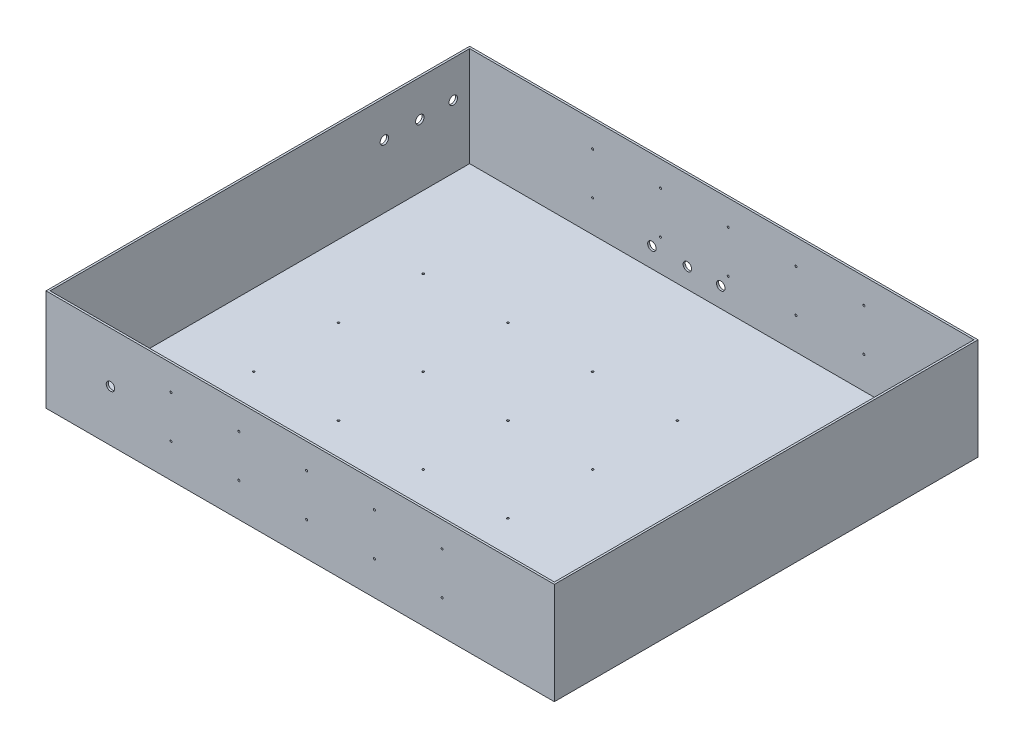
ISO-10303-21;
HEADER;
FILE_DESCRIPTION(('STEP AP214'),'2;1');
FILE_NAME('part.step','',(''),(''),'','','');
FILE_SCHEMA(('AUTOMOTIVE_DESIGN { 1 0 10303 214 1 1 1 1 }'));
ENDSEC;
DATA;
#1=APPLICATION_CONTEXT('core data for automotive mechanical design processes');
#2=APPLICATION_PROTOCOL_DEFINITION('international standard','automotive_design',2000,#1);
#3=PRODUCT_CONTEXT('',#1,'mechanical');
#4=PRODUCT('Part','Part','',(#3));
#5=PRODUCT_RELATED_PRODUCT_CATEGORY('part','',(#4));
#6=PRODUCT_DEFINITION_FORMATION('','',#4);
#7=PRODUCT_DEFINITION_CONTEXT('part definition',#1,'design');
#8=PRODUCT_DEFINITION('design','',#6,#7);
#9=PRODUCT_DEFINITION_SHAPE('','',#8);
#10=(LENGTH_UNIT() NAMED_UNIT(*) SI_UNIT(.MILLI.,.METRE.));
#11=(NAMED_UNIT(*) PLANE_ANGLE_UNIT() SI_UNIT($,.RADIAN.));
#12=(NAMED_UNIT(*) SI_UNIT($,.STERADIAN.) SOLID_ANGLE_UNIT());
#13=UNCERTAINTY_MEASURE_WITH_UNIT(LENGTH_MEASURE(1.E-05),#10,'distance_accuracy_value','');
#14=(GEOMETRIC_REPRESENTATION_CONTEXT(3) GLOBAL_UNCERTAINTY_ASSIGNED_CONTEXT((#13)) GLOBAL_UNIT_ASSIGNED_CONTEXT((#10,
#11,#12)) REPRESENTATION_CONTEXT('',''));
#15=CARTESIAN_POINT('',(0.,0.,0.));
#16=DIRECTION('',(0.,0.,1.));
#17=DIRECTION('',(1.,0.,0.));
#18=AXIS2_PLACEMENT_3D('',#15,#16,#17);
#19=CARTESIAN_POINT('',(-508.,152.4,-508.));
#20=DIRECTION('',(1.,0.,0.));
#21=DIRECTION('',(0.,0.,-1.));
#22=AXIS2_PLACEMENT_3D('',#19,#20,#21);
#23=PLANE('',#22);
#24=CARTESIAN_POINT('',(-508.,97.593006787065,-480.440703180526));
#25=DIRECTION('',(1.,0.,0.));
#26=DIRECTION('',(0.,0.,-1.));
#27=AXIS2_PLACEMENT_3D('',#24,#25,#26);
#28=CIRCLE('',#27,6.34999999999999);
#29=CARTESIAN_POINT('',(-508.,97.593006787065,-486.790703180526));
#30=VERTEX_POINT('',#29);
#31=EDGE_CURVE('E981',#30,#30,#28,.T.);
#32=ORIENTED_EDGE('',*,*,#31,.T.);
#33=EDGE_LOOP('',(#32));
#34=FACE_BOUND('',#33,.T.);
#35=CARTESIAN_POINT('',(-508.,97.593006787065,-430.313846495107));
#36=DIRECTION('',(1.,0.,0.));
#37=DIRECTION('',(0.,0.,-1.));
#38=AXIS2_PLACEMENT_3D('',#35,#36,#37);
#39=CIRCLE('',#38,6.34999999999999);
#40=CARTESIAN_POINT('',(-508.,97.593006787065,-436.663846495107));
#41=VERTEX_POINT('',#40);
#42=EDGE_CURVE('E989',#41,#41,#39,.T.);
#43=ORIENTED_EDGE('',*,*,#42,.T.);
#44=EDGE_LOOP('',(#43));
#45=FACE_BOUND('',#44,.T.);
#46=CARTESIAN_POINT('',(-508.,97.593006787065,-377.133846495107));
#47=DIRECTION('',(1.,0.,0.));
#48=DIRECTION('',(0.,0.,-1.));
#49=AXIS2_PLACEMENT_3D('',#46,#47,#48);
#50=CIRCLE('',#49,6.34999999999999);
#51=CARTESIAN_POINT('',(-508.,97.593006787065,-383.483846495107));
#52=VERTEX_POINT('',#51);
#53=EDGE_CURVE('E995',#52,#52,#50,.T.);
#54=ORIENTED_EDGE('',*,*,#53,.T.);
#55=EDGE_LOOP('',(#54));
#56=FACE_BOUND('',#55,.T.);
#57=DIRECTION('',(0.,0.,1.));
#58=VECTOR('',#57,1.);
#59=CARTESIAN_POINT('',(-508.,0.,-508.));
#60=LINE('',#59,#58);
#61=CARTESIAN_POINT('',(-508.,0.,-508.));
#62=VERTEX_POINT('',#61);
#63=CARTESIAN_POINT('',(-508.,0.,127.));
#64=VERTEX_POINT('',#63);
#65=EDGE_CURVE('E153',#62,#64,#60,.T.);
#66=ORIENTED_EDGE('',*,*,#65,.T.);
#67=DIRECTION('',(0.,-1.,0.));
#68=VECTOR('',#67,1.);
#69=CARTESIAN_POINT('',(-508.,152.4,127.));
#70=LINE('',#69,#68);
#71=CARTESIAN_POINT('',(-508.,152.4,127.));
#72=VERTEX_POINT('',#71);
#73=EDGE_CURVE('E167',#72,#64,#70,.T.);
#74=ORIENTED_EDGE('',*,*,#73,.F.);
#75=DIRECTION('',(0.,0.,1.));
#76=VECTOR('',#75,1.);
#77=CARTESIAN_POINT('',(-508.,152.4,-508.));
#78=LINE('',#77,#76);
#79=CARTESIAN_POINT('',(-508.,152.4,-508.));
#80=VERTEX_POINT('',#79);
#81=EDGE_CURVE('E146',#80,#72,#78,.T.);
#82=ORIENTED_EDGE('',*,*,#81,.F.);
#83=DIRECTION('',(0.,-1.,0.));
#84=VECTOR('',#83,1.);
#85=CARTESIAN_POINT('',(-508.,152.4,-508.));
#86=LINE('',#85,#84);
#87=EDGE_CURVE('E152',#80,#62,#86,.T.);
#88=ORIENTED_EDGE('',*,*,#87,.T.);
#89=EDGE_LOOP('',(#66,#74,#82,#88));
#90=FACE_BOUND('',#89,.T.);
#91=ADVANCED_FACE('F36',(#34,#45,#56,#90),#23,.F.);
#92=CARTESIAN_POINT('',(-508.,152.4,127.));
#93=DIRECTION('',(0.,0.,-1.));
#94=DIRECTION('',(-1.,0.,0.));
#95=AXIS2_PLACEMENT_3D('',#92,#93,#94);
#96=PLANE('',#95);
#97=CARTESIAN_POINT('',(-411.374764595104,76.7740112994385,127.));
#98=DIRECTION('',(0.,0.,1.));
#99=DIRECTION('',(1.,0.,0.));
#100=AXIS2_PLACEMENT_3D('',#97,#98,#99);
#101=CIRCLE('',#100,6.35);
#102=CARTESIAN_POINT('',(-405.024764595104,76.7740112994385,127.));
#103=VERTEX_POINT('',#102);
#104=EDGE_CURVE('E500',#103,#103,#101,.T.);
#105=ORIENTED_EDGE('',*,*,#104,.F.);
#106=EDGE_LOOP('',(#105));
#107=FACE_BOUND('',#106,.T.);
#108=CARTESIAN_POINT('',(-15.748,114.3,127.));
#109=DIRECTION('',(0.,0.,-1.));
#110=DIRECTION('',(-1.,0.,0.));
#111=AXIS2_PLACEMENT_3D('',#108,#109,#110);
#112=CIRCLE('',#111,1.52400000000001);
#113=CARTESIAN_POINT('',(-17.272,114.3,127.));
#114=VERTEX_POINT('',#113);
#115=EDGE_CURVE('E521',#114,#114,#112,.T.);
#116=ORIENTED_EDGE('',*,*,#115,.T.);
#117=EDGE_LOOP('',(#116));
#118=FACE_BOUND('',#117,.T.);
#119=CARTESIAN_POINT('',(85.852,114.3,127.));
#120=DIRECTION('',(0.,0.,-1.));
#121=DIRECTION('',(-1.,0.,0.));
#122=AXIS2_PLACEMENT_3D('',#119,#120,#121);
#123=CIRCLE('',#122,1.52400000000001);
#124=CARTESIAN_POINT('',(84.328,114.3,127.));
#125=VERTEX_POINT('',#124);
#126=EDGE_CURVE('E174',#125,#125,#123,.T.);
#127=ORIENTED_EDGE('',*,*,#126,.T.);
#128=EDGE_LOOP('',(#127));
#129=FACE_BOUND('',#128,.T.);
#130=DIRECTION('',(1.,0.,0.));
#131=VECTOR('',#130,1.);
#132=CARTESIAN_POINT('',(-508.,0.,127.));
#133=LINE('',#132,#131);
#134=CARTESIAN_POINT('',(254.,0.,127.));
#135=VERTEX_POINT('',#134);
#136=EDGE_CURVE('E156',#64,#135,#133,.T.);
#137=ORIENTED_EDGE('',*,*,#136,.T.);
#138=DIRECTION('',(0.,-1.,0.));
#139=VECTOR('',#138,1.);
#140=CARTESIAN_POINT('',(254.,152.4,127.));
#141=LINE('',#140,#139);
#142=CARTESIAN_POINT('',(254.,152.4,127.));
#143=VERTEX_POINT('',#142);
#144=EDGE_CURVE('E164',#143,#135,#141,.T.);
#145=ORIENTED_EDGE('',*,*,#144,.F.);
#146=DIRECTION('',(1.,0.,0.));
#147=VECTOR('',#146,1.);
#148=CARTESIAN_POINT('',(-508.,152.4,127.));
#149=LINE('',#148,#147);
#150=EDGE_CURVE('E89',#72,#143,#149,.T.);
#151=ORIENTED_EDGE('',*,*,#150,.F.);
#152=ORIENTED_EDGE('',*,*,#73,.T.);
#153=EDGE_LOOP('',(#137,#145,#151,#152));
#154=FACE_BOUND('',#153,.T.);
#155=CARTESIAN_POINT('',(-117.348,114.3,127.));
#156=DIRECTION('',(0.,0.,-1.));
#157=DIRECTION('',(-1.,0.,0.));
#158=AXIS2_PLACEMENT_3D('',#155,#156,#157);
#159=CIRCLE('',#158,1.52400000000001);
#160=CARTESIAN_POINT('',(-118.872,114.3,127.));
#161=VERTEX_POINT('',#160);
#162=EDGE_CURVE('E177',#161,#161,#159,.T.);
#163=ORIENTED_EDGE('',*,*,#162,.T.);
#164=EDGE_LOOP('',(#163));
#165=FACE_BOUND('',#164,.T.);
#166=CARTESIAN_POINT('',(-218.948,114.3,127.));
#167=DIRECTION('',(0.,0.,-1.));
#168=DIRECTION('',(-1.,0.,0.));
#169=AXIS2_PLACEMENT_3D('',#166,#167,#168);
#170=CIRCLE('',#169,1.52400000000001);
#171=CARTESIAN_POINT('',(-220.472,114.3,127.));
#172=VERTEX_POINT('',#171);
#173=EDGE_CURVE('E183',#172,#172,#170,.T.);
#174=ORIENTED_EDGE('',*,*,#173,.T.);
#175=EDGE_LOOP('',(#174));
#176=FACE_BOUND('',#175,.T.);
#177=CARTESIAN_POINT('',(-320.548,114.3,127.));
#178=DIRECTION('',(0.,0.,-1.));
#179=DIRECTION('',(-1.,0.,0.));
#180=AXIS2_PLACEMENT_3D('',#177,#178,#179);
#181=CIRCLE('',#180,1.52400000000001);
#182=CARTESIAN_POINT('',(-322.072,114.3,127.));
#183=VERTEX_POINT('',#182);
#184=EDGE_CURVE('E189',#183,#183,#181,.T.);
#185=ORIENTED_EDGE('',*,*,#184,.T.);
#186=EDGE_LOOP('',(#185));
#187=FACE_BOUND('',#186,.T.);
#188=CARTESIAN_POINT('',(85.852,50.8,127.));
#189=DIRECTION('',(0.,0.,-1.));
#190=DIRECTION('',(-1.,0.,0.));
#191=AXIS2_PLACEMENT_3D('',#188,#189,#190);
#192=CIRCLE('',#191,1.52400000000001);
#193=CARTESIAN_POINT('',(84.328,50.8,127.));
#194=VERTEX_POINT('',#193);
#195=EDGE_CURVE('E195',#194,#194,#192,.T.);
#196=ORIENTED_EDGE('',*,*,#195,.T.);
#197=EDGE_LOOP('',(#196));
#198=FACE_BOUND('',#197,.T.);
#199=CARTESIAN_POINT('',(-15.748,50.8,127.));
#200=DIRECTION('',(0.,0.,-1.));
#201=DIRECTION('',(-1.,0.,0.));
#202=AXIS2_PLACEMENT_3D('',#199,#200,#201);
#203=CIRCLE('',#202,1.52400000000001);
#204=CARTESIAN_POINT('',(-17.272,50.8,127.));
#205=VERTEX_POINT('',#204);
#206=EDGE_CURVE('E201',#205,#205,#203,.T.);
#207=ORIENTED_EDGE('',*,*,#206,.T.);
#208=EDGE_LOOP('',(#207));
#209=FACE_BOUND('',#208,.T.);
#210=CARTESIAN_POINT('',(-117.348,50.8,127.));
#211=DIRECTION('',(0.,0.,-1.));
#212=DIRECTION('',(-1.,0.,0.));
#213=AXIS2_PLACEMENT_3D('',#210,#211,#212);
#214=CIRCLE('',#213,1.52400000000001);
#215=CARTESIAN_POINT('',(-118.872,50.8,127.));
#216=VERTEX_POINT('',#215);
#217=EDGE_CURVE('E207',#216,#216,#214,.T.);
#218=ORIENTED_EDGE('',*,*,#217,.T.);
#219=EDGE_LOOP('',(#218));
#220=FACE_BOUND('',#219,.T.);
#221=CARTESIAN_POINT('',(-218.948,50.8,127.));
#222=DIRECTION('',(0.,0.,-1.));
#223=DIRECTION('',(-1.,0.,0.));
#224=AXIS2_PLACEMENT_3D('',#221,#222,#223);
#225=CIRCLE('',#224,1.52400000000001);
#226=CARTESIAN_POINT('',(-220.472,50.8,127.));
#227=VERTEX_POINT('',#226);
#228=EDGE_CURVE('E213',#227,#227,#225,.T.);
#229=ORIENTED_EDGE('',*,*,#228,.T.);
#230=EDGE_LOOP('',(#229));
#231=FACE_BOUND('',#230,.T.);
#232=CARTESIAN_POINT('',(-320.548,50.8,127.));
#233=DIRECTION('',(0.,0.,-1.));
#234=DIRECTION('',(-1.,0.,0.));
#235=AXIS2_PLACEMENT_3D('',#232,#233,#234);
#236=CIRCLE('',#235,1.52400000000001);
#237=CARTESIAN_POINT('',(-322.072,50.8,127.));
#238=VERTEX_POINT('',#237);
#239=EDGE_CURVE('E219',#238,#238,#236,.T.);
#240=ORIENTED_EDGE('',*,*,#239,.T.);
#241=EDGE_LOOP('',(#240));
#242=FACE_BOUND('',#241,.T.);
#243=ADVANCED_FACE('F283',(#107,#118,#129,#154,#165,#176,#187,#198,#209,#220,#231,#242),#96,.F.);
#244=CARTESIAN_POINT('',(254.,152.4,-508.));
#245=DIRECTION('',(-1.,0.,0.));
#246=DIRECTION('',(0.,0.,1.));
#247=AXIS2_PLACEMENT_3D('',#244,#245,#246);
#248=PLANE('',#247);
#249=DIRECTION('',(0.,0.,-1.));
#250=VECTOR('',#249,1.);
#251=CARTESIAN_POINT('',(254.,0.,-508.));
#252=LINE('',#251,#250);
#253=CARTESIAN_POINT('',(254.,0.,-508.));
#254=VERTEX_POINT('',#253);
#255=EDGE_CURVE('E158',#135,#254,#252,.T.);
#256=ORIENTED_EDGE('',*,*,#255,.T.);
#257=DIRECTION('',(0.,-1.,0.));
#258=VECTOR('',#257,1.);
#259=CARTESIAN_POINT('',(254.,152.4,-508.));
#260=LINE('',#259,#258);
#261=CARTESIAN_POINT('',(254.,152.4,-508.));
#262=VERTEX_POINT('',#261);
#263=EDGE_CURVE('E162',#262,#254,#260,.T.);
#264=ORIENTED_EDGE('',*,*,#263,.F.);
#265=DIRECTION('',(0.,0.,-1.));
#266=VECTOR('',#265,1.);
#267=CARTESIAN_POINT('',(254.,152.4,-508.));
#268=LINE('',#267,#266);
#269=EDGE_CURVE('E149',#143,#262,#268,.T.);
#270=ORIENTED_EDGE('',*,*,#269,.F.);
#271=ORIENTED_EDGE('',*,*,#144,.T.);
#272=EDGE_LOOP('',(#256,#264,#270,#271));
#273=FACE_BOUND('',#272,.T.);
#274=ADVANCED_FACE('F289',(#273),#248,.F.);
#275=CARTESIAN_POINT('',(-508.,152.4,-508.));
#276=DIRECTION('',(0.,0.,1.));
#277=DIRECTION('',(1.,0.,0.));
#278=AXIS2_PLACEMENT_3D('',#275,#276,#277);
#279=PLANE('',#278);
#280=CARTESIAN_POINT('',(-15.748,114.3,-508.));
#281=DIRECTION('',(0.,0.,-1.));
#282=DIRECTION('',(-1.,0.,0.));
#283=AXIS2_PLACEMENT_3D('',#280,#281,#282);
#284=CIRCLE('',#283,1.52400000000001);
#285=CARTESIAN_POINT('',(-17.272,114.3,-508.));
#286=VERTEX_POINT('',#285);
#287=EDGE_CURVE('E515',#286,#286,#284,.T.);
#288=ORIENTED_EDGE('',*,*,#287,.F.);
#289=EDGE_LOOP('',(#288));
#290=FACE_BOUND('',#289,.T.);
#291=CARTESIAN_POINT('',(85.852,114.3,-508.));
#292=DIRECTION('',(0.,0.,-1.));
#293=DIRECTION('',(-1.,0.,0.));
#294=AXIS2_PLACEMENT_3D('',#291,#292,#293);
#295=CIRCLE('',#294,1.52400000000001);
#296=CARTESIAN_POINT('',(84.328,114.3,-508.));
#297=VERTEX_POINT('',#296);
#298=EDGE_CURVE('E524',#297,#297,#295,.T.);
#299=ORIENTED_EDGE('',*,*,#298,.F.);
#300=EDGE_LOOP('',(#299));
#301=FACE_BOUND('',#300,.T.);
#302=CARTESIAN_POINT('',(-128.459535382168,32.6517,-508.));
#303=DIRECTION('',(0.,0.,1.));
#304=DIRECTION('',(1.,0.,0.));
#305=AXIS2_PLACEMENT_3D('',#302,#303,#304);
#306=CIRCLE('',#305,6.35);
#307=CARTESIAN_POINT('',(-122.109535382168,32.6517,-508.));
#308=VERTEX_POINT('',#307);
#309=EDGE_CURVE('E532',#308,#308,#306,.T.);
#310=ORIENTED_EDGE('',*,*,#309,.T.);
#311=EDGE_LOOP('',(#310));
#312=FACE_BOUND('',#311,.T.);
#313=CARTESIAN_POINT('',(-178.586392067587,32.6517,-508.));
#314=DIRECTION('',(0.,0.,1.));
#315=DIRECTION('',(1.,0.,0.));
#316=AXIS2_PLACEMENT_3D('',#313,#314,#315);
#317=CIRCLE('',#316,6.35);
#318=CARTESIAN_POINT('',(-172.236392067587,32.6517,-508.));
#319=VERTEX_POINT('',#318);
#320=EDGE_CURVE('E538',#319,#319,#317,.T.);
#321=ORIENTED_EDGE('',*,*,#320,.T.);
#322=EDGE_LOOP('',(#321));
#323=FACE_BOUND('',#322,.T.);
#324=CARTESIAN_POINT('',(-231.766392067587,32.6517,-508.));
#325=DIRECTION('',(0.,0.,1.));
#326=DIRECTION('',(1.,0.,0.));
#327=AXIS2_PLACEMENT_3D('',#324,#325,#326);
#328=CIRCLE('',#327,6.35);
#329=CARTESIAN_POINT('',(-225.416392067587,32.6517,-508.));
#330=VERTEX_POINT('',#329);
#331=EDGE_CURVE('E544',#330,#330,#328,.T.);
#332=ORIENTED_EDGE('',*,*,#331,.T.);
#333=EDGE_LOOP('',(#332));
#334=FACE_BOUND('',#333,.T.);
#335=DIRECTION('',(-1.,0.,0.));
#336=VECTOR('',#335,1.);
#337=CARTESIAN_POINT('',(-508.,0.,-508.));
#338=LINE('',#337,#336);
#339=EDGE_CURVE('E81',#254,#62,#338,.T.);
#340=ORIENTED_EDGE('',*,*,#339,.T.);
#341=ORIENTED_EDGE('',*,*,#87,.F.);
#342=DIRECTION('',(-1.,0.,0.));
#343=VECTOR('',#342,1.);
#344=CARTESIAN_POINT('',(-508.,152.4,-508.));
#345=LINE('',#344,#343);
#346=EDGE_CURVE('E60',#262,#80,#345,.T.);
#347=ORIENTED_EDGE('',*,*,#346,.F.);
#348=ORIENTED_EDGE('',*,*,#263,.T.);
#349=EDGE_LOOP('',(#340,#341,#347,#348));
#350=FACE_BOUND('',#349,.T.);
#351=CARTESIAN_POINT('',(-117.348,114.3,-508.));
#352=DIRECTION('',(0.,0.,-1.));
#353=DIRECTION('',(-1.,0.,0.));
#354=AXIS2_PLACEMENT_3D('',#351,#352,#353);
#355=CIRCLE('',#354,1.52400000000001);
#356=CARTESIAN_POINT('',(-118.872,114.3,-508.));
#357=VERTEX_POINT('',#356);
#358=EDGE_CURVE('E225',#357,#357,#355,.T.);
#359=ORIENTED_EDGE('',*,*,#358,.F.);
#360=EDGE_LOOP('',(#359));
#361=FACE_BOUND('',#360,.T.);
#362=CARTESIAN_POINT('',(-218.948,114.3,-508.));
#363=DIRECTION('',(0.,0.,-1.));
#364=DIRECTION('',(-1.,0.,0.));
#365=AXIS2_PLACEMENT_3D('',#362,#363,#364);
#366=CIRCLE('',#365,1.52400000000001);
#367=CARTESIAN_POINT('',(-220.472,114.3,-508.));
#368=VERTEX_POINT('',#367);
#369=EDGE_CURVE('E231',#368,#368,#366,.T.);
#370=ORIENTED_EDGE('',*,*,#369,.F.);
#371=EDGE_LOOP('',(#370));
#372=FACE_BOUND('',#371,.T.);
#373=CARTESIAN_POINT('',(-320.548,114.3,-508.));
#374=DIRECTION('',(0.,0.,-1.));
#375=DIRECTION('',(-1.,0.,0.));
#376=AXIS2_PLACEMENT_3D('',#373,#374,#375);
#377=CIRCLE('',#376,1.52400000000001);
#378=CARTESIAN_POINT('',(-322.072,114.3,-508.));
#379=VERTEX_POINT('',#378);
#380=EDGE_CURVE('E237',#379,#379,#377,.T.);
#381=ORIENTED_EDGE('',*,*,#380,.F.);
#382=EDGE_LOOP('',(#381));
#383=FACE_BOUND('',#382,.T.);
#384=CARTESIAN_POINT('',(85.852,50.8,-508.));
#385=DIRECTION('',(0.,0.,-1.));
#386=DIRECTION('',(-1.,0.,0.));
#387=AXIS2_PLACEMENT_3D('',#384,#385,#386);
#388=CIRCLE('',#387,1.52400000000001);
#389=CARTESIAN_POINT('',(84.328,50.8,-508.));
#390=VERTEX_POINT('',#389);
#391=EDGE_CURVE('E243',#390,#390,#388,.T.);
#392=ORIENTED_EDGE('',*,*,#391,.F.);
#393=EDGE_LOOP('',(#392));
#394=FACE_BOUND('',#393,.T.);
#395=CARTESIAN_POINT('',(-15.748,50.8,-508.));
#396=DIRECTION('',(0.,0.,-1.));
#397=DIRECTION('',(-1.,0.,0.));
#398=AXIS2_PLACEMENT_3D('',#395,#396,#397);
#399=CIRCLE('',#398,1.52400000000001);
#400=CARTESIAN_POINT('',(-17.272,50.8,-508.));
#401=VERTEX_POINT('',#400);
#402=EDGE_CURVE('E249',#401,#401,#399,.T.);
#403=ORIENTED_EDGE('',*,*,#402,.F.);
#404=EDGE_LOOP('',(#403));
#405=FACE_BOUND('',#404,.T.);
#406=CARTESIAN_POINT('',(-117.348,50.8,-508.));
#407=DIRECTION('',(0.,0.,-1.));
#408=DIRECTION('',(-1.,0.,0.));
#409=AXIS2_PLACEMENT_3D('',#406,#407,#408);
#410=CIRCLE('',#409,1.52400000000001);
#411=CARTESIAN_POINT('',(-118.872,50.8,-508.));
#412=VERTEX_POINT('',#411);
#413=EDGE_CURVE('E255',#412,#412,#410,.T.);
#414=ORIENTED_EDGE('',*,*,#413,.F.);
#415=EDGE_LOOP('',(#414));
#416=FACE_BOUND('',#415,.T.);
#417=CARTESIAN_POINT('',(-218.948,50.8,-508.));
#418=DIRECTION('',(0.,0.,-1.));
#419=DIRECTION('',(-1.,0.,0.));
#420=AXIS2_PLACEMENT_3D('',#417,#418,#419);
#421=CIRCLE('',#420,1.52400000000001);
#422=CARTESIAN_POINT('',(-220.472,50.8,-508.));
#423=VERTEX_POINT('',#422);
#424=EDGE_CURVE('E261',#423,#423,#421,.T.);
#425=ORIENTED_EDGE('',*,*,#424,.F.);
#426=EDGE_LOOP('',(#425));
#427=FACE_BOUND('',#426,.T.);
#428=CARTESIAN_POINT('',(-320.548,50.8,-508.));
#429=DIRECTION('',(0.,0.,-1.));
#430=DIRECTION('',(-1.,0.,0.));
#431=AXIS2_PLACEMENT_3D('',#428,#429,#430);
#432=CIRCLE('',#431,1.52400000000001);
#433=CARTESIAN_POINT('',(-322.072,50.8,-508.));
#434=VERTEX_POINT('',#433);
#435=EDGE_CURVE('E11',#434,#434,#432,.T.);
#436=ORIENTED_EDGE('',*,*,#435,.F.);
#437=EDGE_LOOP('',(#436));
#438=FACE_BOUND('',#437,.T.);
#439=ADVANCED_FACE('F364',(#290,#301,#312,#323,#334,#350,#361,#372,#383,#394,#405,#416,#427,
#438),#279,.F.);
#440=CARTESIAN_POINT('',(-508.,152.4,127.));
#441=DIRECTION('',(0.,1.,0.));
#442=DIRECTION('',(0.,0.,1.));
#443=AXIS2_PLACEMENT_3D('',#440,#441,#442);
#444=PLANE('',#443);
#445=DIRECTION('',(0.,0.,1.));
#446=VECTOR('',#445,1.);
#447=CARTESIAN_POINT('',(-504.952,152.4,-508.));
#448=LINE('',#447,#446);
#449=CARTESIAN_POINT('',(-504.952,152.4,-504.952));
#450=VERTEX_POINT('',#449);
#451=CARTESIAN_POINT('',(-504.952,152.4,123.952));
#452=VERTEX_POINT('',#451);
#453=EDGE_CURVE('E135',#450,#452,#448,.T.);
#454=ORIENTED_EDGE('',*,*,#453,.F.);
#455=DIRECTION('',(-1.,0.,0.));
#456=VECTOR('',#455,1.);
#457=CARTESIAN_POINT('',(-508.,152.4,-504.952));
#458=LINE('',#457,#456);
#459=CARTESIAN_POINT('',(250.952,152.4,-504.952));
#460=VERTEX_POINT('',#459);
#461=EDGE_CURVE('E144',#460,#450,#458,.T.);
#462=ORIENTED_EDGE('',*,*,#461,.F.);
#463=DIRECTION('',(0.,0.,-1.));
#464=VECTOR('',#463,1.);
#465=CARTESIAN_POINT('',(250.952,152.4,-508.));
#466=LINE('',#465,#464);
#467=CARTESIAN_POINT('',(250.952,152.4,123.952));
#468=VERTEX_POINT('',#467);
#469=EDGE_CURVE('E142',#468,#460,#466,.T.);
#470=ORIENTED_EDGE('',*,*,#469,.F.);
#471=DIRECTION('',(1.,0.,0.));
#472=VECTOR('',#471,1.);
#473=CARTESIAN_POINT('',(-508.,152.4,123.952));
#474=LINE('',#473,#472);
#475=EDGE_CURVE('E127',#452,#468,#474,.T.);
#476=ORIENTED_EDGE('',*,*,#475,.F.);
#477=EDGE_LOOP('',(#454,#462,#470,#476));
#478=FACE_BOUND('',#477,.T.);
#479=ORIENTED_EDGE('',*,*,#81,.T.);
#480=ORIENTED_EDGE('',*,*,#150,.T.);
#481=ORIENTED_EDGE('',*,*,#269,.T.);
#482=ORIENTED_EDGE('',*,*,#346,.T.);
#483=EDGE_LOOP('',(#479,#480,#481,#482));
#484=FACE_BOUND('',#483,.T.);
#485=ADVANCED_FACE('F367',(#478,#484),#444,.T.);
#486=CARTESIAN_POINT('',(-508.,0.,127.));
#487=DIRECTION('',(0.,1.,0.));
#488=DIRECTION('',(0.,0.,1.));
#489=AXIS2_PLACEMENT_3D('',#486,#487,#488);
#490=PLANE('',#489);
#491=CARTESIAN_POINT('',(-396.748,0.,-73.152));
#492=DIRECTION('',(0.,1.,0.));
#493=DIRECTION('',(0.,0.,1.));
#494=AXIS2_PLACEMENT_3D('',#491,#492,#493);
#495=CIRCLE('',#494,1.52400000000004);
#496=CARTESIAN_POINT('',(-396.748,0.,-71.628));
#497=VERTEX_POINT('',#496);
#498=EDGE_CURVE('E393',#497,#497,#495,.F.);
#499=ORIENTED_EDGE('',*,*,#498,.F.);
#500=EDGE_LOOP('',(#499));
#501=FACE_BOUND('',#500,.T.);
#502=CARTESIAN_POINT('',(-269.748,0.,-73.152));
#503=DIRECTION('',(0.,1.,0.));
#504=DIRECTION('',(0.,0.,1.));
#505=AXIS2_PLACEMENT_3D('',#502,#503,#504);
#506=CIRCLE('',#505,1.52400000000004);
#507=CARTESIAN_POINT('',(-269.748,0.,-71.628));
#508=VERTEX_POINT('',#507);
#509=EDGE_CURVE('E397',#508,#508,#506,.F.);
#510=ORIENTED_EDGE('',*,*,#509,.F.);
#511=EDGE_LOOP('',(#510));
#512=FACE_BOUND('',#511,.T.);
#513=CARTESIAN_POINT('',(-142.748,0.,-73.152));
#514=DIRECTION('',(0.,1.,0.));
#515=DIRECTION('',(0.,0.,1.));
#516=AXIS2_PLACEMENT_3D('',#513,#514,#515);
#517=CIRCLE('',#516,1.52400000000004);
#518=CARTESIAN_POINT('',(-142.748,0.,-71.628));
#519=VERTEX_POINT('',#518);
#520=EDGE_CURVE('E401',#519,#519,#517,.F.);
#521=ORIENTED_EDGE('',*,*,#520,.F.);
#522=EDGE_LOOP('',(#521));
#523=FACE_BOUND('',#522,.T.);
#524=CARTESIAN_POINT('',(-15.748,0.,-73.152));
#525=DIRECTION('',(0.,1.,0.));
#526=DIRECTION('',(0.,0.,1.));
#527=AXIS2_PLACEMENT_3D('',#524,#525,#526);
#528=CIRCLE('',#527,1.52400000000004);
#529=CARTESIAN_POINT('',(-15.748,0.,-71.628));
#530=VERTEX_POINT('',#529);
#531=EDGE_CURVE('E405',#530,#530,#528,.F.);
#532=ORIENTED_EDGE('',*,*,#531,.F.);
#533=EDGE_LOOP('',(#532));
#534=FACE_BOUND('',#533,.T.);
#535=CARTESIAN_POINT('',(111.252,0.,-73.152));
#536=DIRECTION('',(0.,1.,0.));
#537=DIRECTION('',(0.,0.,1.));
#538=AXIS2_PLACEMENT_3D('',#535,#536,#537);
#539=CIRCLE('',#538,1.52400000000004);
#540=CARTESIAN_POINT('',(111.252,0.,-71.628));
#541=VERTEX_POINT('',#540);
#542=EDGE_CURVE('E409',#541,#541,#539,.F.);
#543=ORIENTED_EDGE('',*,*,#542,.F.);
#544=EDGE_LOOP('',(#543));
#545=FACE_BOUND('',#544,.T.);
#546=CARTESIAN_POINT('',(-396.748,0.,-200.152));
#547=DIRECTION('',(0.,1.,0.));
#548=DIRECTION('',(0.,0.,1.));
#549=AXIS2_PLACEMENT_3D('',#546,#547,#548);
#550=CIRCLE('',#549,1.52400000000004);
#551=CARTESIAN_POINT('',(-396.748,0.,-198.628));
#552=VERTEX_POINT('',#551);
#553=EDGE_CURVE('E413',#552,#552,#550,.F.);
#554=ORIENTED_EDGE('',*,*,#553,.F.);
#555=EDGE_LOOP('',(#554));
#556=FACE_BOUND('',#555,.T.);
#557=CARTESIAN_POINT('',(-269.748,0.,-200.152));
#558=DIRECTION('',(0.,1.,0.));
#559=DIRECTION('',(0.,0.,1.));
#560=AXIS2_PLACEMENT_3D('',#557,#558,#559);
#561=CIRCLE('',#560,1.52400000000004);
#562=CARTESIAN_POINT('',(-269.748,0.,-198.628));
#563=VERTEX_POINT('',#562);
#564=EDGE_CURVE('E417',#563,#563,#561,.F.);
#565=ORIENTED_EDGE('',*,*,#564,.F.);
#566=EDGE_LOOP('',(#565));
#567=FACE_BOUND('',#566,.T.);
#568=CARTESIAN_POINT('',(-142.748,0.,-200.152));
#569=DIRECTION('',(0.,1.,0.));
#570=DIRECTION('',(0.,0.,1.));
#571=AXIS2_PLACEMENT_3D('',#568,#569,#570);
#572=CIRCLE('',#571,1.52400000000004);
#573=CARTESIAN_POINT('',(-142.748,0.,-198.628));
#574=VERTEX_POINT('',#573);
#575=EDGE_CURVE('E421',#574,#574,#572,.F.);
#576=ORIENTED_EDGE('',*,*,#575,.F.);
#577=EDGE_LOOP('',(#576));
#578=FACE_BOUND('',#577,.T.);
#579=CARTESIAN_POINT('',(-15.748,0.,-200.152));
#580=DIRECTION('',(0.,1.,0.));
#581=DIRECTION('',(0.,0.,1.));
#582=AXIS2_PLACEMENT_3D('',#579,#580,#581);
#583=CIRCLE('',#582,1.52400000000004);
#584=CARTESIAN_POINT('',(-15.748,0.,-198.628));
#585=VERTEX_POINT('',#584);
#586=EDGE_CURVE('E425',#585,#585,#583,.F.);
#587=ORIENTED_EDGE('',*,*,#586,.F.);
#588=EDGE_LOOP('',(#587));
#589=FACE_BOUND('',#588,.T.);
#590=CARTESIAN_POINT('',(111.252,0.,-200.152));
#591=DIRECTION('',(0.,1.,0.));
#592=DIRECTION('',(0.,0.,1.));
#593=AXIS2_PLACEMENT_3D('',#590,#591,#592);
#594=CIRCLE('',#593,1.52400000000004);
#595=CARTESIAN_POINT('',(111.252,0.,-198.628));
#596=VERTEX_POINT('',#595);
#597=EDGE_CURVE('E429',#596,#596,#594,.F.);
#598=ORIENTED_EDGE('',*,*,#597,.F.);
#599=EDGE_LOOP('',(#598));
#600=FACE_BOUND('',#599,.T.);
#601=CARTESIAN_POINT('',(-396.748,0.,-327.152));
#602=DIRECTION('',(0.,1.,0.));
#603=DIRECTION('',(0.,0.,1.));
#604=AXIS2_PLACEMENT_3D('',#601,#602,#603);
#605=CIRCLE('',#604,1.52400000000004);
#606=CARTESIAN_POINT('',(-396.748,0.,-325.628));
#607=VERTEX_POINT('',#606);
#608=EDGE_CURVE('E433',#607,#607,#605,.F.);
#609=ORIENTED_EDGE('',*,*,#608,.F.);
#610=EDGE_LOOP('',(#609));
#611=FACE_BOUND('',#610,.T.);
#612=CARTESIAN_POINT('',(-269.748,0.,-327.152));
#613=DIRECTION('',(0.,1.,0.));
#614=DIRECTION('',(0.,0.,1.));
#615=AXIS2_PLACEMENT_3D('',#612,#613,#614);
#616=CIRCLE('',#615,1.52400000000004);
#617=CARTESIAN_POINT('',(-269.748,0.,-325.628));
#618=VERTEX_POINT('',#617);
#619=EDGE_CURVE('E437',#618,#618,#616,.F.);
#620=ORIENTED_EDGE('',*,*,#619,.F.);
#621=EDGE_LOOP('',(#620));
#622=FACE_BOUND('',#621,.T.);
#623=CARTESIAN_POINT('',(-142.748,0.,-327.152));
#624=DIRECTION('',(0.,1.,0.));
#625=DIRECTION('',(0.,0.,1.));
#626=AXIS2_PLACEMENT_3D('',#623,#624,#625);
#627=CIRCLE('',#626,1.52400000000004);
#628=CARTESIAN_POINT('',(-142.748,0.,-325.628));
#629=VERTEX_POINT('',#628);
#630=EDGE_CURVE('E441',#629,#629,#627,.F.);
#631=ORIENTED_EDGE('',*,*,#630,.F.);
#632=EDGE_LOOP('',(#631));
#633=FACE_BOUND('',#632,.T.);
#634=CARTESIAN_POINT('',(-15.748,0.,-327.152));
#635=DIRECTION('',(0.,1.,0.));
#636=DIRECTION('',(0.,0.,1.));
#637=AXIS2_PLACEMENT_3D('',#634,#635,#636);
#638=CIRCLE('',#637,1.52400000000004);
#639=CARTESIAN_POINT('',(-15.748,0.,-325.628));
#640=VERTEX_POINT('',#639);
#641=EDGE_CURVE('E445',#640,#640,#638,.F.);
#642=ORIENTED_EDGE('',*,*,#641,.F.);
#643=EDGE_LOOP('',(#642));
#644=FACE_BOUND('',#643,.T.);
#645=CARTESIAN_POINT('',(111.252,0.,-327.152));
#646=DIRECTION('',(0.,1.,0.));
#647=DIRECTION('',(0.,0.,1.));
#648=AXIS2_PLACEMENT_3D('',#645,#646,#647);
#649=CIRCLE('',#648,1.52400000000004);
#650=CARTESIAN_POINT('',(111.252,0.,-325.628));
#651=VERTEX_POINT('',#650);
#652=EDGE_CURVE('E449',#651,#651,#649,.F.);
#653=ORIENTED_EDGE('',*,*,#652,.F.);
#654=EDGE_LOOP('',(#653));
#655=FACE_BOUND('',#654,.T.);
#656=ORIENTED_EDGE('',*,*,#65,.F.);
#657=ORIENTED_EDGE('',*,*,#339,.F.);
#658=ORIENTED_EDGE('',*,*,#255,.F.);
#659=ORIENTED_EDGE('',*,*,#136,.F.);
#660=EDGE_LOOP('',(#656,#657,#658,#659));
#661=FACE_BOUND('',#660,.T.);
#662=ADVANCED_FACE('F375',(#501,#512,#523,#534,#545,#556,#567,#578,#589,#600,#611,#622,#633,
#644,#655,#661),#490,.F.);
#663=CARTESIAN_POINT('',(-504.952,152.4,-508.));
#664=DIRECTION('',(1.,0.,0.));
#665=DIRECTION('',(0.,0.,-1.));
#666=AXIS2_PLACEMENT_3D('',#663,#664,#665);
#667=PLANE('',#666);
#668=CARTESIAN_POINT('',(-504.952,97.593006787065,-480.440703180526));
#669=DIRECTION('',(1.,0.,0.));
#670=DIRECTION('',(0.,0.,-1.));
#671=AXIS2_PLACEMENT_3D('',#668,#669,#670);
#672=CIRCLE('',#671,6.34999999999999);
#673=CARTESIAN_POINT('',(-504.952,97.593006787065,-486.790703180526));
#674=VERTEX_POINT('',#673);
#675=EDGE_CURVE('E984',#674,#674,#672,.T.);
#676=ORIENTED_EDGE('',*,*,#675,.F.);
#677=EDGE_LOOP('',(#676));
#678=FACE_BOUND('',#677,.T.);
#679=CARTESIAN_POINT('',(-504.952,97.593006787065,-430.313846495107));
#680=DIRECTION('',(1.,0.,0.));
#681=DIRECTION('',(0.,0.,-1.));
#682=AXIS2_PLACEMENT_3D('',#679,#680,#681);
#683=CIRCLE('',#682,6.34999999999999);
#684=CARTESIAN_POINT('',(-504.952,97.593006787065,-436.663846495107));
#685=VERTEX_POINT('',#684);
#686=EDGE_CURVE('E986',#685,#685,#683,.T.);
#687=ORIENTED_EDGE('',*,*,#686,.F.);
#688=EDGE_LOOP('',(#687));
#689=FACE_BOUND('',#688,.T.);
#690=CARTESIAN_POINT('',(-504.952,97.593006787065,-377.133846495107));
#691=DIRECTION('',(1.,0.,0.));
#692=DIRECTION('',(0.,0.,-1.));
#693=AXIS2_PLACEMENT_3D('',#690,#691,#692);
#694=CIRCLE('',#693,6.34999999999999);
#695=CARTESIAN_POINT('',(-504.952,97.593006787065,-383.483846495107));
#696=VERTEX_POINT('',#695);
#697=EDGE_CURVE('E992',#696,#696,#694,.T.);
#698=ORIENTED_EDGE('',*,*,#697,.F.);
#699=EDGE_LOOP('',(#698));
#700=FACE_BOUND('',#699,.T.);
#701=DIRECTION('',(0.,0.,1.));
#702=VECTOR('',#701,1.);
#703=CARTESIAN_POINT('',(-504.952,3.048,-508.));
#704=LINE('',#703,#702);
#705=CARTESIAN_POINT('',(-504.952,3.048,-504.952));
#706=VERTEX_POINT('',#705);
#707=CARTESIAN_POINT('',(-504.952,3.048,123.952));
#708=VERTEX_POINT('',#707);
#709=EDGE_CURVE('E117',#706,#708,#704,.T.);
#710=ORIENTED_EDGE('',*,*,#709,.F.);
#711=DIRECTION('',(0.,-1.,0.));
#712=VECTOR('',#711,1.);
#713=CARTESIAN_POINT('',(-504.952,152.4,-504.952));
#714=LINE('',#713,#712);
#715=EDGE_CURVE('E138',#450,#706,#714,.T.);
#716=ORIENTED_EDGE('',*,*,#715,.F.);
#717=ORIENTED_EDGE('',*,*,#453,.T.);
#718=DIRECTION('',(0.,-1.,0.));
#719=VECTOR('',#718,1.);
#720=CARTESIAN_POINT('',(-504.952,152.4,123.952));
#721=LINE('',#720,#719);
#722=EDGE_CURVE('E130',#452,#708,#721,.T.);
#723=ORIENTED_EDGE('',*,*,#722,.T.);
#724=EDGE_LOOP('',(#710,#716,#717,#723));
#725=FACE_BOUND('',#724,.T.);
#726=ADVANCED_FACE('F383',(#678,#689,#700,#725),#667,.T.);
#727=CARTESIAN_POINT('',(-508.,152.4,123.952));
#728=DIRECTION('',(0.,0.,-1.));
#729=DIRECTION('',(-1.,0.,0.));
#730=AXIS2_PLACEMENT_3D('',#727,#728,#729);
#731=PLANE('',#730);
#732=CARTESIAN_POINT('',(-411.374764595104,76.7740112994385,123.952));
#733=DIRECTION('',(0.,0.,-1.));
#734=DIRECTION('',(-1.,0.,0.));
#735=AXIS2_PLACEMENT_3D('',#732,#733,#734);
#736=CIRCLE('',#735,6.35);
#737=CARTESIAN_POINT('',(-417.724764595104,76.7740112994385,123.952));
#738=VERTEX_POINT('',#737);
#739=EDGE_CURVE('E504',#738,#738,#736,.F.);
#740=ORIENTED_EDGE('',*,*,#739,.T.);
#741=EDGE_LOOP('',(#740));
#742=FACE_BOUND('',#741,.T.);
#743=CARTESIAN_POINT('',(-15.748,114.3,123.952));
#744=DIRECTION('',(0.,0.,-1.));
#745=DIRECTION('',(-1.,0.,0.));
#746=AXIS2_PLACEMENT_3D('',#743,#744,#745);
#747=CIRCLE('',#746,1.52400000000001);
#748=CARTESIAN_POINT('',(-17.272,114.3,123.952));
#749=VERTEX_POINT('',#748);
#750=EDGE_CURVE('E518',#749,#749,#747,.T.);
#751=ORIENTED_EDGE('',*,*,#750,.F.);
#752=EDGE_LOOP('',(#751));
#753=FACE_BOUND('',#752,.T.);
#754=CARTESIAN_POINT('',(85.852,114.3,123.952));
#755=DIRECTION('',(0.,0.,-1.));
#756=DIRECTION('',(-1.,0.,0.));
#757=AXIS2_PLACEMENT_3D('',#754,#755,#756);
#758=CIRCLE('',#757,1.52400000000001);
#759=CARTESIAN_POINT('',(84.328,114.3,123.952));
#760=VERTEX_POINT('',#759);
#761=EDGE_CURVE('E173',#760,#760,#758,.T.);
#762=ORIENTED_EDGE('',*,*,#761,.F.);
#763=EDGE_LOOP('',(#762));
#764=FACE_BOUND('',#763,.T.);
#765=DIRECTION('',(1.,0.,0.));
#766=VECTOR('',#765,1.);
#767=CARTESIAN_POINT('',(-508.,3.048,123.952));
#768=LINE('',#767,#766);
#769=CARTESIAN_POINT('',(250.952,3.048,123.952));
#770=VERTEX_POINT('',#769);
#771=EDGE_CURVE('E111',#708,#770,#768,.T.);
#772=ORIENTED_EDGE('',*,*,#771,.F.);
#773=ORIENTED_EDGE('',*,*,#722,.F.);
#774=ORIENTED_EDGE('',*,*,#475,.T.);
#775=DIRECTION('',(0.,-1.,0.));
#776=VECTOR('',#775,1.);
#777=CARTESIAN_POINT('',(250.952,152.4,123.952));
#778=LINE('',#777,#776);
#779=EDGE_CURVE('E123',#468,#770,#778,.T.);
#780=ORIENTED_EDGE('',*,*,#779,.T.);
#781=EDGE_LOOP('',(#772,#773,#774,#780));
#782=FACE_BOUND('',#781,.T.);
#783=CARTESIAN_POINT('',(-117.348,114.3,123.952));
#784=DIRECTION('',(0.,0.,-1.));
#785=DIRECTION('',(-1.,0.,0.));
#786=AXIS2_PLACEMENT_3D('',#783,#784,#785);
#787=CIRCLE('',#786,1.52400000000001);
#788=CARTESIAN_POINT('',(-118.872,114.3,123.952));
#789=VERTEX_POINT('',#788);
#790=EDGE_CURVE('E169',#789,#789,#787,.T.);
#791=ORIENTED_EDGE('',*,*,#790,.F.);
#792=EDGE_LOOP('',(#791));
#793=FACE_BOUND('',#792,.T.);
#794=CARTESIAN_POINT('',(-218.948,114.3,123.952));
#795=DIRECTION('',(0.,0.,-1.));
#796=DIRECTION('',(-1.,0.,0.));
#797=AXIS2_PLACEMENT_3D('',#794,#795,#796);
#798=CIRCLE('',#797,1.52400000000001);
#799=CARTESIAN_POINT('',(-220.472,114.3,123.952));
#800=VERTEX_POINT('',#799);
#801=EDGE_CURVE('E180',#800,#800,#798,.T.);
#802=ORIENTED_EDGE('',*,*,#801,.F.);
#803=EDGE_LOOP('',(#802));
#804=FACE_BOUND('',#803,.T.);
#805=CARTESIAN_POINT('',(-320.548,114.3,123.952));
#806=DIRECTION('',(0.,0.,-1.));
#807=DIRECTION('',(-1.,0.,0.));
#808=AXIS2_PLACEMENT_3D('',#805,#806,#807);
#809=CIRCLE('',#808,1.52400000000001);
#810=CARTESIAN_POINT('',(-322.072,114.3,123.952));
#811=VERTEX_POINT('',#810);
#812=EDGE_CURVE('E186',#811,#811,#809,.T.);
#813=ORIENTED_EDGE('',*,*,#812,.F.);
#814=EDGE_LOOP('',(#813));
#815=FACE_BOUND('',#814,.T.);
#816=CARTESIAN_POINT('',(85.852,50.8,123.952));
#817=DIRECTION('',(0.,0.,-1.));
#818=DIRECTION('',(-1.,0.,0.));
#819=AXIS2_PLACEMENT_3D('',#816,#817,#818);
#820=CIRCLE('',#819,1.52400000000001);
#821=CARTESIAN_POINT('',(84.328,50.8,123.952));
#822=VERTEX_POINT('',#821);
#823=EDGE_CURVE('E192',#822,#822,#820,.T.);
#824=ORIENTED_EDGE('',*,*,#823,.F.);
#825=EDGE_LOOP('',(#824));
#826=FACE_BOUND('',#825,.T.);
#827=CARTESIAN_POINT('',(-15.748,50.8,123.952));
#828=DIRECTION('',(0.,0.,-1.));
#829=DIRECTION('',(-1.,0.,0.));
#830=AXIS2_PLACEMENT_3D('',#827,#828,#829);
#831=CIRCLE('',#830,1.52400000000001);
#832=CARTESIAN_POINT('',(-17.272,50.8,123.952));
#833=VERTEX_POINT('',#832);
#834=EDGE_CURVE('E198',#833,#833,#831,.T.);
#835=ORIENTED_EDGE('',*,*,#834,.F.);
#836=EDGE_LOOP('',(#835));
#837=FACE_BOUND('',#836,.T.);
#838=CARTESIAN_POINT('',(-117.348,50.8,123.952));
#839=DIRECTION('',(0.,0.,-1.));
#840=DIRECTION('',(-1.,0.,0.));
#841=AXIS2_PLACEMENT_3D('',#838,#839,#840);
#842=CIRCLE('',#841,1.52400000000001);
#843=CARTESIAN_POINT('',(-118.872,50.8,123.952));
#844=VERTEX_POINT('',#843);
#845=EDGE_CURVE('E204',#844,#844,#842,.T.);
#846=ORIENTED_EDGE('',*,*,#845,.F.);
#847=EDGE_LOOP('',(#846));
#848=FACE_BOUND('',#847,.T.);
#849=CARTESIAN_POINT('',(-218.948,50.8,123.952));
#850=DIRECTION('',(0.,0.,-1.));
#851=DIRECTION('',(-1.,0.,0.));
#852=AXIS2_PLACEMENT_3D('',#849,#850,#851);
#853=CIRCLE('',#852,1.52400000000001);
#854=CARTESIAN_POINT('',(-220.472,50.8,123.952));
#855=VERTEX_POINT('',#854);
#856=EDGE_CURVE('E210',#855,#855,#853,.T.);
#857=ORIENTED_EDGE('',*,*,#856,.F.);
#858=EDGE_LOOP('',(#857));
#859=FACE_BOUND('',#858,.T.);
#860=CARTESIAN_POINT('',(-320.548,50.8,123.952));
#861=DIRECTION('',(0.,0.,-1.));
#862=DIRECTION('',(-1.,0.,0.));
#863=AXIS2_PLACEMENT_3D('',#860,#861,#862);
#864=CIRCLE('',#863,1.52400000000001);
#865=CARTESIAN_POINT('',(-322.072,50.8,123.952));
#866=VERTEX_POINT('',#865);
#867=EDGE_CURVE('E216',#866,#866,#864,.T.);
#868=ORIENTED_EDGE('',*,*,#867,.F.);
#869=EDGE_LOOP('',(#868));
#870=FACE_BOUND('',#869,.T.);
#871=ADVANCED_FACE('F124',(#742,#753,#764,#782,#793,#804,#815,#826,#837,#848,#859,#870),#731,.T.);
#872=CARTESIAN_POINT('',(250.952,152.4,-508.));
#873=DIRECTION('',(-1.,0.,0.));
#874=DIRECTION('',(0.,0.,1.));
#875=AXIS2_PLACEMENT_3D('',#872,#873,#874);
#876=PLANE('',#875);
#877=DIRECTION('',(0.,0.,-1.));
#878=VECTOR('',#877,1.);
#879=CARTESIAN_POINT('',(250.952,3.048,-508.));
#880=LINE('',#879,#878);
#881=CARTESIAN_POINT('',(250.952,3.048,-504.952));
#882=VERTEX_POINT('',#881);
#883=EDGE_CURVE('E115',#770,#882,#880,.T.);
#884=ORIENTED_EDGE('',*,*,#883,.F.);
#885=ORIENTED_EDGE('',*,*,#779,.F.);
#886=ORIENTED_EDGE('',*,*,#469,.T.);
#887=DIRECTION('',(0.,-1.,0.));
#888=VECTOR('',#887,1.);
#889=CARTESIAN_POINT('',(250.952,152.4,-504.952));
#890=LINE('',#889,#888);
#891=EDGE_CURVE('E51',#460,#882,#890,.T.);
#892=ORIENTED_EDGE('',*,*,#891,.T.);
#893=EDGE_LOOP('',(#884,#885,#886,#892));
#894=FACE_BOUND('',#893,.T.);
#895=ADVANCED_FACE('F132',(#894),#876,.T.);
#896=CARTESIAN_POINT('',(-508.,152.4,-504.952));
#897=DIRECTION('',(0.,0.,1.));
#898=DIRECTION('',(1.,0.,0.));
#899=AXIS2_PLACEMENT_3D('',#896,#897,#898);
#900=PLANE('',#899);
#901=CARTESIAN_POINT('',(-15.748,114.3,-504.952));
#902=DIRECTION('',(0.,0.,1.));
#903=DIRECTION('',(1.,0.,0.));
#904=AXIS2_PLACEMENT_3D('',#901,#902,#903);
#905=CIRCLE('',#904,1.52400000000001);
#906=CARTESIAN_POINT('',(-17.272,114.3,-504.952));
#907=VERTEX_POINT('',#906);
#908=EDGE_CURVE('E512',#907,#907,#905,.T.);
#909=ORIENTED_EDGE('',*,*,#908,.F.);
#910=EDGE_LOOP('',(#909));
#911=FACE_BOUND('',#910,.T.);
#912=CARTESIAN_POINT('',(85.852,114.3,-504.952));
#913=DIRECTION('',(0.,0.,1.));
#914=DIRECTION('',(1.,0.,0.));
#915=AXIS2_PLACEMENT_3D('',#912,#913,#914);
#916=CIRCLE('',#915,1.52400000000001);
#917=CARTESIAN_POINT('',(84.328,114.3,-504.952));
#918=VERTEX_POINT('',#917);
#919=EDGE_CURVE('E170',#918,#918,#916,.T.);
#920=ORIENTED_EDGE('',*,*,#919,.F.);
#921=EDGE_LOOP('',(#920));
#922=FACE_BOUND('',#921,.T.);
#923=CARTESIAN_POINT('',(-128.459535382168,32.6517,-504.952));
#924=DIRECTION('',(0.,0.,1.));
#925=DIRECTION('',(1.,0.,0.));
#926=AXIS2_PLACEMENT_3D('',#923,#924,#925);
#927=CIRCLE('',#926,6.35);
#928=CARTESIAN_POINT('',(-122.109535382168,32.6517,-504.952));
#929=VERTEX_POINT('',#928);
#930=EDGE_CURVE('E531',#929,#929,#927,.T.);
#931=ORIENTED_EDGE('',*,*,#930,.F.);
#932=EDGE_LOOP('',(#931));
#933=FACE_BOUND('',#932,.T.);
#934=CARTESIAN_POINT('',(-178.586392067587,32.6517,-504.952));
#935=DIRECTION('',(0.,0.,1.));
#936=DIRECTION('',(1.,0.,0.));
#937=AXIS2_PLACEMENT_3D('',#934,#935,#936);
#938=CIRCLE('',#937,6.35);
#939=CARTESIAN_POINT('',(-172.236392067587,32.6517,-504.952));
#940=VERTEX_POINT('',#939);
#941=EDGE_CURVE('E535',#940,#940,#938,.T.);
#942=ORIENTED_EDGE('',*,*,#941,.F.);
#943=EDGE_LOOP('',(#942));
#944=FACE_BOUND('',#943,.T.);
#945=CARTESIAN_POINT('',(-231.766392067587,32.6517,-504.952));
#946=DIRECTION('',(0.,0.,1.));
#947=DIRECTION('',(1.,0.,0.));
#948=AXIS2_PLACEMENT_3D('',#945,#946,#947);
#949=CIRCLE('',#948,6.35);
#950=CARTESIAN_POINT('',(-225.416392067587,32.6517,-504.952));
#951=VERTEX_POINT('',#950);
#952=EDGE_CURVE('E541',#951,#951,#949,.T.);
#953=ORIENTED_EDGE('',*,*,#952,.F.);
#954=EDGE_LOOP('',(#953));
#955=FACE_BOUND('',#954,.T.);
#956=DIRECTION('',(-1.,0.,0.));
#957=VECTOR('',#956,1.);
#958=CARTESIAN_POINT('',(-508.,3.048,-504.952));
#959=LINE('',#958,#957);
#960=EDGE_CURVE('E133',#882,#706,#959,.T.);
#961=ORIENTED_EDGE('',*,*,#960,.F.);
#962=ORIENTED_EDGE('',*,*,#891,.F.);
#963=ORIENTED_EDGE('',*,*,#461,.T.);
#964=ORIENTED_EDGE('',*,*,#715,.T.);
#965=EDGE_LOOP('',(#961,#962,#963,#964));
#966=FACE_BOUND('',#965,.T.);
#967=CARTESIAN_POINT('',(-117.348,114.3,-504.952));
#968=DIRECTION('',(0.,0.,1.));
#969=DIRECTION('',(1.,0.,0.));
#970=AXIS2_PLACEMENT_3D('',#967,#968,#969);
#971=CIRCLE('',#970,1.52400000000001);
#972=CARTESIAN_POINT('',(-118.872,114.3,-504.952));
#973=VERTEX_POINT('',#972);
#974=EDGE_CURVE('E222',#973,#973,#971,.T.);
#975=ORIENTED_EDGE('',*,*,#974,.F.);
#976=EDGE_LOOP('',(#975));
#977=FACE_BOUND('',#976,.T.);
#978=CARTESIAN_POINT('',(-218.948,114.3,-504.952));
#979=DIRECTION('',(0.,0.,1.));
#980=DIRECTION('',(1.,0.,0.));
#981=AXIS2_PLACEMENT_3D('',#978,#979,#980);
#982=CIRCLE('',#981,1.52400000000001);
#983=CARTESIAN_POINT('',(-220.472,114.3,-504.952));
#984=VERTEX_POINT('',#983);
#985=EDGE_CURVE('E228',#984,#984,#982,.T.);
#986=ORIENTED_EDGE('',*,*,#985,.F.);
#987=EDGE_LOOP('',(#986));
#988=FACE_BOUND('',#987,.T.);
#989=CARTESIAN_POINT('',(-320.548,114.3,-504.952));
#990=DIRECTION('',(0.,0.,1.));
#991=DIRECTION('',(1.,0.,0.));
#992=AXIS2_PLACEMENT_3D('',#989,#990,#991);
#993=CIRCLE('',#992,1.52400000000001);
#994=CARTESIAN_POINT('',(-322.072,114.3,-504.952));
#995=VERTEX_POINT('',#994);
#996=EDGE_CURVE('E234',#995,#995,#993,.T.);
#997=ORIENTED_EDGE('',*,*,#996,.F.);
#998=EDGE_LOOP('',(#997));
#999=FACE_BOUND('',#998,.T.);
#1000=CARTESIAN_POINT('',(85.852,50.8,-504.952));
#1001=DIRECTION('',(0.,0.,1.));
#1002=DIRECTION('',(1.,0.,0.));
#1003=AXIS2_PLACEMENT_3D('',#1000,#1001,#1002);
#1004=CIRCLE('',#1003,1.52400000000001);
#1005=CARTESIAN_POINT('',(84.328,50.8,-504.952));
#1006=VERTEX_POINT('',#1005);
#1007=EDGE_CURVE('E240',#1006,#1006,#1004,.T.);
#1008=ORIENTED_EDGE('',*,*,#1007,.F.);
#1009=EDGE_LOOP('',(#1008));
#1010=FACE_BOUND('',#1009,.T.);
#1011=CARTESIAN_POINT('',(-15.748,50.8,-504.952));
#1012=DIRECTION('',(0.,0.,1.));
#1013=DIRECTION('',(1.,0.,0.));
#1014=AXIS2_PLACEMENT_3D('',#1011,#1012,#1013);
#1015=CIRCLE('',#1014,1.52400000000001);
#1016=CARTESIAN_POINT('',(-17.272,50.8,-504.952));
#1017=VERTEX_POINT('',#1016);
#1018=EDGE_CURVE('E246',#1017,#1017,#1015,.T.);
#1019=ORIENTED_EDGE('',*,*,#1018,.F.);
#1020=EDGE_LOOP('',(#1019));
#1021=FACE_BOUND('',#1020,.T.);
#1022=CARTESIAN_POINT('',(-117.348,50.8,-504.952));
#1023=DIRECTION('',(0.,0.,1.));
#1024=DIRECTION('',(1.,0.,0.));
#1025=AXIS2_PLACEMENT_3D('',#1022,#1023,#1024);
#1026=CIRCLE('',#1025,1.52400000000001);
#1027=CARTESIAN_POINT('',(-118.872,50.8,-504.952));
#1028=VERTEX_POINT('',#1027);
#1029=EDGE_CURVE('E252',#1028,#1028,#1026,.T.);
#1030=ORIENTED_EDGE('',*,*,#1029,.F.);
#1031=EDGE_LOOP('',(#1030));
#1032=FACE_BOUND('',#1031,.T.);
#1033=CARTESIAN_POINT('',(-218.948,50.8,-504.952));
#1034=DIRECTION('',(0.,0.,1.));
#1035=DIRECTION('',(1.,0.,0.));
#1036=AXIS2_PLACEMENT_3D('',#1033,#1034,#1035);
#1037=CIRCLE('',#1036,1.52400000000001);
#1038=CARTESIAN_POINT('',(-220.472,50.8,-504.952));
#1039=VERTEX_POINT('',#1038);
#1040=EDGE_CURVE('E258',#1039,#1039,#1037,.T.);
#1041=ORIENTED_EDGE('',*,*,#1040,.F.);
#1042=EDGE_LOOP('',(#1041));
#1043=FACE_BOUND('',#1042,.T.);
#1044=CARTESIAN_POINT('',(-320.548,50.8,-504.952));
#1045=DIRECTION('',(0.,0.,1.));
#1046=DIRECTION('',(1.,0.,0.));
#1047=AXIS2_PLACEMENT_3D('',#1044,#1045,#1046);
#1048=CIRCLE('',#1047,1.52400000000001);
#1049=CARTESIAN_POINT('',(-322.072,50.8,-504.952));
#1050=VERTEX_POINT('',#1049);
#1051=EDGE_CURVE('E44',#1050,#1050,#1048,.T.);
#1052=ORIENTED_EDGE('',*,*,#1051,.F.);
#1053=EDGE_LOOP('',(#1052));
#1054=FACE_BOUND('',#1053,.T.);
#1055=ADVANCED_FACE('F268',(#911,#922,#933,#944,#955,#966,#977,#988,#999,#1010,#1021,#1032,
#1043,#1054),#900,.T.);
#1056=CARTESIAN_POINT('',(-508.,3.048,127.));
#1057=DIRECTION('',(0.,1.,0.));
#1058=DIRECTION('',(0.,0.,1.));
#1059=AXIS2_PLACEMENT_3D('',#1056,#1057,#1058);
#1060=PLANE('',#1059);
#1061=CARTESIAN_POINT('',(-396.748,3.048,-73.152));
#1062=DIRECTION('',(0.,1.,0.));
#1063=DIRECTION('',(0.,0.,1.));
#1064=AXIS2_PLACEMENT_3D('',#1061,#1062,#1063);
#1065=CIRCLE('',#1064,1.52400000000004);
#1066=CARTESIAN_POINT('',(-396.748,3.048,-71.628));
#1067=VERTEX_POINT('',#1066);
#1068=EDGE_CURVE('E998',#1067,#1067,#1065,.T.);
#1069=ORIENTED_EDGE('',*,*,#1068,.F.);
#1070=EDGE_LOOP('',(#1069));
#1071=FACE_BOUND('',#1070,.T.);
#1072=CARTESIAN_POINT('',(-269.748,3.048,-73.152));
#1073=DIRECTION('',(0.,1.,0.));
#1074=DIRECTION('',(0.,0.,1.));
#1075=AXIS2_PLACEMENT_3D('',#1072,#1073,#1074);
#1076=CIRCLE('',#1075,1.52400000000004);
#1077=CARTESIAN_POINT('',(-269.748,3.048,-71.628));
#1078=VERTEX_POINT('',#1077);
#1079=EDGE_CURVE('E1004',#1078,#1078,#1076,.T.);
#1080=ORIENTED_EDGE('',*,*,#1079,.F.);
#1081=EDGE_LOOP('',(#1080));
#1082=FACE_BOUND('',#1081,.T.);
#1083=CARTESIAN_POINT('',(-142.748,3.048,-73.152));
#1084=DIRECTION('',(0.,1.,0.));
#1085=DIRECTION('',(0.,0.,1.));
#1086=AXIS2_PLACEMENT_3D('',#1083,#1084,#1085);
#1087=CIRCLE('',#1086,1.52400000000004);
#1088=CARTESIAN_POINT('',(-142.748,3.048,-71.628));
#1089=VERTEX_POINT('',#1088);
#1090=EDGE_CURVE('E1008',#1089,#1089,#1087,.T.);
#1091=ORIENTED_EDGE('',*,*,#1090,.F.);
#1092=EDGE_LOOP('',(#1091));
#1093=FACE_BOUND('',#1092,.T.);
#1094=CARTESIAN_POINT('',(-15.748,3.048,-73.152));
#1095=DIRECTION('',(0.,1.,0.));
#1096=DIRECTION('',(0.,0.,1.));
#1097=AXIS2_PLACEMENT_3D('',#1094,#1095,#1096);
#1098=CIRCLE('',#1097,1.52400000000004);
#1099=CARTESIAN_POINT('',(-15.748,3.048,-71.628));
#1100=VERTEX_POINT('',#1099);
#1101=EDGE_CURVE('E1012',#1100,#1100,#1098,.T.);
#1102=ORIENTED_EDGE('',*,*,#1101,.F.);
#1103=EDGE_LOOP('',(#1102));
#1104=FACE_BOUND('',#1103,.T.);
#1105=CARTESIAN_POINT('',(111.252,3.048,-73.152));
#1106=DIRECTION('',(0.,1.,0.));
#1107=DIRECTION('',(0.,0.,1.));
#1108=AXIS2_PLACEMENT_3D('',#1105,#1106,#1107);
#1109=CIRCLE('',#1108,1.52400000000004);
#1110=CARTESIAN_POINT('',(111.252,3.048,-71.628));
#1111=VERTEX_POINT('',#1110);
#1112=EDGE_CURVE('E1016',#1111,#1111,#1109,.T.);
#1113=ORIENTED_EDGE('',*,*,#1112,.F.);
#1114=EDGE_LOOP('',(#1113));
#1115=FACE_BOUND('',#1114,.T.);
#1116=CARTESIAN_POINT('',(-396.748,3.048,-200.152));
#1117=DIRECTION('',(0.,1.,0.));
#1118=DIRECTION('',(0.,0.,1.));
#1119=AXIS2_PLACEMENT_3D('',#1116,#1117,#1118);
#1120=CIRCLE('',#1119,1.52400000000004);
#1121=CARTESIAN_POINT('',(-396.748,3.048,-198.628));
#1122=VERTEX_POINT('',#1121);
#1123=EDGE_CURVE('E1020',#1122,#1122,#1120,.T.);
#1124=ORIENTED_EDGE('',*,*,#1123,.F.);
#1125=EDGE_LOOP('',(#1124));
#1126=FACE_BOUND('',#1125,.T.);
#1127=CARTESIAN_POINT('',(-269.748,3.048,-200.152));
#1128=DIRECTION('',(0.,1.,0.));
#1129=DIRECTION('',(0.,0.,1.));
#1130=AXIS2_PLACEMENT_3D('',#1127,#1128,#1129);
#1131=CIRCLE('',#1130,1.52400000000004);
#1132=CARTESIAN_POINT('',(-269.748,3.048,-198.628));
#1133=VERTEX_POINT('',#1132);
#1134=EDGE_CURVE('E1024',#1133,#1133,#1131,.T.);
#1135=ORIENTED_EDGE('',*,*,#1134,.F.);
#1136=EDGE_LOOP('',(#1135));
#1137=FACE_BOUND('',#1136,.T.);
#1138=CARTESIAN_POINT('',(-142.748,3.048,-200.152));
#1139=DIRECTION('',(0.,1.,0.));
#1140=DIRECTION('',(0.,0.,1.));
#1141=AXIS2_PLACEMENT_3D('',#1138,#1139,#1140);
#1142=CIRCLE('',#1141,1.52400000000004);
#1143=CARTESIAN_POINT('',(-142.748,3.048,-198.628));
#1144=VERTEX_POINT('',#1143);
#1145=EDGE_CURVE('E1028',#1144,#1144,#1142,.T.);
#1146=ORIENTED_EDGE('',*,*,#1145,.F.);
#1147=EDGE_LOOP('',(#1146));
#1148=FACE_BOUND('',#1147,.T.);
#1149=CARTESIAN_POINT('',(-15.748,3.048,-200.152));
#1150=DIRECTION('',(0.,1.,0.));
#1151=DIRECTION('',(0.,0.,1.));
#1152=AXIS2_PLACEMENT_3D('',#1149,#1150,#1151);
#1153=CIRCLE('',#1152,1.52400000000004);
#1154=CARTESIAN_POINT('',(-15.748,3.048,-198.628));
#1155=VERTEX_POINT('',#1154);
#1156=EDGE_CURVE('E1032',#1155,#1155,#1153,.T.);
#1157=ORIENTED_EDGE('',*,*,#1156,.F.);
#1158=EDGE_LOOP('',(#1157));
#1159=FACE_BOUND('',#1158,.T.);
#1160=CARTESIAN_POINT('',(111.252,3.048,-200.152));
#1161=DIRECTION('',(0.,1.,0.));
#1162=DIRECTION('',(0.,0.,1.));
#1163=AXIS2_PLACEMENT_3D('',#1160,#1161,#1162);
#1164=CIRCLE('',#1163,1.52400000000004);
#1165=CARTESIAN_POINT('',(111.252,3.048,-198.628));
#1166=VERTEX_POINT('',#1165);
#1167=EDGE_CURVE('E1036',#1166,#1166,#1164,.T.);
#1168=ORIENTED_EDGE('',*,*,#1167,.F.);
#1169=EDGE_LOOP('',(#1168));
#1170=FACE_BOUND('',#1169,.T.);
#1171=CARTESIAN_POINT('',(-396.748,3.048,-327.152));
#1172=DIRECTION('',(0.,1.,0.));
#1173=DIRECTION('',(0.,0.,1.));
#1174=AXIS2_PLACEMENT_3D('',#1171,#1172,#1173);
#1175=CIRCLE('',#1174,1.52400000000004);
#1176=CARTESIAN_POINT('',(-396.748,3.048,-325.628));
#1177=VERTEX_POINT('',#1176);
#1178=EDGE_CURVE('E1040',#1177,#1177,#1175,.T.);
#1179=ORIENTED_EDGE('',*,*,#1178,.F.);
#1180=EDGE_LOOP('',(#1179));
#1181=FACE_BOUND('',#1180,.T.);
#1182=CARTESIAN_POINT('',(-269.748,3.048,-327.152));
#1183=DIRECTION('',(0.,1.,0.));
#1184=DIRECTION('',(0.,0.,1.));
#1185=AXIS2_PLACEMENT_3D('',#1182,#1183,#1184);
#1186=CIRCLE('',#1185,1.52400000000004);
#1187=CARTESIAN_POINT('',(-269.748,3.048,-325.628));
#1188=VERTEX_POINT('',#1187);
#1189=EDGE_CURVE('E1044',#1188,#1188,#1186,.T.);
#1190=ORIENTED_EDGE('',*,*,#1189,.F.);
#1191=EDGE_LOOP('',(#1190));
#1192=FACE_BOUND('',#1191,.T.);
#1193=CARTESIAN_POINT('',(-142.748,3.048,-327.152));
#1194=DIRECTION('',(0.,1.,0.));
#1195=DIRECTION('',(0.,0.,1.));
#1196=AXIS2_PLACEMENT_3D('',#1193,#1194,#1195);
#1197=CIRCLE('',#1196,1.52400000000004);
#1198=CARTESIAN_POINT('',(-142.748,3.048,-325.628));
#1199=VERTEX_POINT('',#1198);
#1200=EDGE_CURVE('E1048',#1199,#1199,#1197,.T.);
#1201=ORIENTED_EDGE('',*,*,#1200,.F.);
#1202=EDGE_LOOP('',(#1201));
#1203=FACE_BOUND('',#1202,.T.);
#1204=CARTESIAN_POINT('',(-15.748,3.048,-327.152));
#1205=DIRECTION('',(0.,1.,0.));
#1206=DIRECTION('',(0.,0.,1.));
#1207=AXIS2_PLACEMENT_3D('',#1204,#1205,#1206);
#1208=CIRCLE('',#1207,1.52400000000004);
#1209=CARTESIAN_POINT('',(-15.748,3.048,-325.628));
#1210=VERTEX_POINT('',#1209);
#1211=EDGE_CURVE('E1052',#1210,#1210,#1208,.T.);
#1212=ORIENTED_EDGE('',*,*,#1211,.F.);
#1213=EDGE_LOOP('',(#1212));
#1214=FACE_BOUND('',#1213,.T.);
#1215=CARTESIAN_POINT('',(111.252,3.048,-327.152));
#1216=DIRECTION('',(0.,1.,0.));
#1217=DIRECTION('',(0.,0.,1.));
#1218=AXIS2_PLACEMENT_3D('',#1215,#1216,#1217);
#1219=CIRCLE('',#1218,1.52400000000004);
#1220=CARTESIAN_POINT('',(111.252,3.048,-325.628));
#1221=VERTEX_POINT('',#1220);
#1222=EDGE_CURVE('E501',#1221,#1221,#1219,.T.);
#1223=ORIENTED_EDGE('',*,*,#1222,.F.);
#1224=EDGE_LOOP('',(#1223));
#1225=FACE_BOUND('',#1224,.T.);
#1226=ORIENTED_EDGE('',*,*,#709,.T.);
#1227=ORIENTED_EDGE('',*,*,#771,.T.);
#1228=ORIENTED_EDGE('',*,*,#883,.T.);
#1229=ORIENTED_EDGE('',*,*,#960,.T.);
#1230=EDGE_LOOP('',(#1226,#1227,#1228,#1229));
#1231=FACE_BOUND('',#1230,.T.);
#1232=ADVANCED_FACE('F113',(#1071,#1082,#1093,#1104,#1115,#1126,#1137,#1148,#1159,#1170,#1181,
#1192,#1203,#1214,#1225,#1231),#1060,.T.);
#1233=CARTESIAN_POINT('',(-231.766392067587,32.6517,-508.));
#1234=DIRECTION('',(0.,0.,1.));
#1235=DIRECTION('',(1.,0.,0.));
#1236=AXIS2_PLACEMENT_3D('',#1233,#1234,#1235);
#1237=CYLINDRICAL_SURFACE('',#1236,6.35);
#1238=ORIENTED_EDGE('',*,*,#331,.F.);
#1239=EDGE_LOOP('',(#1238));
#1240=FACE_BOUND('',#1239,.T.);
#1241=ORIENTED_EDGE('',*,*,#952,.T.);
#1242=EDGE_LOOP('',(#1241));
#1243=FACE_BOUND('',#1242,.T.);
#1244=ADVANCED_FACE('F276',(#1240,#1243),#1237,.F.);
#1245=CARTESIAN_POINT('',(-178.586392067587,32.6517,-508.));
#1246=DIRECTION('',(0.,0.,1.));
#1247=DIRECTION('',(1.,0.,0.));
#1248=AXIS2_PLACEMENT_3D('',#1245,#1246,#1247);
#1249=CYLINDRICAL_SURFACE('',#1248,6.35);
#1250=ORIENTED_EDGE('',*,*,#320,.F.);
#1251=EDGE_LOOP('',(#1250));
#1252=FACE_BOUND('',#1251,.T.);
#1253=ORIENTED_EDGE('',*,*,#941,.T.);
#1254=EDGE_LOOP('',(#1253));
#1255=FACE_BOUND('',#1254,.T.);
#1256=ADVANCED_FACE('F573',(#1252,#1255),#1249,.F.);
#1257=CARTESIAN_POINT('',(-128.459535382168,32.6517,-508.));
#1258=DIRECTION('',(0.,0.,1.));
#1259=DIRECTION('',(1.,0.,0.));
#1260=AXIS2_PLACEMENT_3D('',#1257,#1258,#1259);
#1261=CYLINDRICAL_SURFACE('',#1260,6.35);
#1262=ORIENTED_EDGE('',*,*,#309,.F.);
#1263=EDGE_LOOP('',(#1262));
#1264=FACE_BOUND('',#1263,.T.);
#1265=ORIENTED_EDGE('',*,*,#930,.T.);
#1266=EDGE_LOOP('',(#1265));
#1267=FACE_BOUND('',#1266,.T.);
#1268=ADVANCED_FACE('F579',(#1264,#1267),#1261,.F.);
#1269=CARTESIAN_POINT('',(85.852,114.3,127.));
#1270=DIRECTION('',(0.,0.,-1.));
#1271=DIRECTION('',(-1.,0.,0.));
#1272=AXIS2_PLACEMENT_3D('',#1269,#1270,#1271);
#1273=CYLINDRICAL_SURFACE('',#1272,1.52400000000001);
#1274=CARTESIAN_POINT('',(84.328,114.3,-504.952));
#1275=CARTESIAN_POINT('',(84.328,114.3,-504.98375));
#1276=CARTESIAN_POINT('',(84.328,114.3,-505.0155));
#1277=CARTESIAN_POINT('',(84.328,114.3,-505.079));
#1278=CARTESIAN_POINT('',(84.328,114.3,-505.11075));
#1279=CARTESIAN_POINT('',(84.328,114.3,-505.17425));
#1280=CARTESIAN_POINT('',(84.328,114.3,-505.206));
#1281=CARTESIAN_POINT('',(84.328,114.3,-505.2695));
#1282=CARTESIAN_POINT('',(84.328,114.3,-505.30125));
#1283=CARTESIAN_POINT('',(84.328,114.3,-505.36475));
#1284=CARTESIAN_POINT('',(84.328,114.3,-505.3965));
#1285=CARTESIAN_POINT('',(84.328,114.3,-505.46));
#1286=CARTESIAN_POINT('',(84.328,114.3,-505.49175));
#1287=CARTESIAN_POINT('',(84.328,114.3,-505.55525));
#1288=CARTESIAN_POINT('',(84.328,114.3,-505.587));
#1289=CARTESIAN_POINT('',(84.328,114.3,-505.6505));
#1290=CARTESIAN_POINT('',(84.328,114.3,-505.68225));
#1291=CARTESIAN_POINT('',(84.328,114.3,-505.74575));
#1292=CARTESIAN_POINT('',(84.328,114.3,-505.7775));
#1293=CARTESIAN_POINT('',(84.328,114.3,-505.841));
#1294=CARTESIAN_POINT('',(84.328,114.3,-505.87275));
#1295=CARTESIAN_POINT('',(84.328,114.3,-505.93625));
#1296=CARTESIAN_POINT('',(84.328,114.3,-505.968));
#1297=CARTESIAN_POINT('',(84.328,114.3,-506.0315));
#1298=CARTESIAN_POINT('',(84.328,114.3,-506.06325));
#1299=CARTESIAN_POINT('',(84.328,114.3,-506.12675));
#1300=CARTESIAN_POINT('',(84.328,114.3,-506.1585));
#1301=CARTESIAN_POINT('',(84.328,114.3,-506.222));
#1302=CARTESIAN_POINT('',(84.328,114.3,-506.25375));
#1303=CARTESIAN_POINT('',(84.328,114.3,-506.31725));
#1304=CARTESIAN_POINT('',(84.328,114.3,-506.349));
#1305=CARTESIAN_POINT('',(84.328,114.3,-506.4125));
#1306=CARTESIAN_POINT('',(84.328,114.3,-506.44425));
#1307=CARTESIAN_POINT('',(84.328,114.3,-506.50775));
#1308=CARTESIAN_POINT('',(84.328,114.3,-506.5395));
#1309=CARTESIAN_POINT('',(84.328,114.3,-506.603));
#1310=CARTESIAN_POINT('',(84.328,114.3,-506.63475));
#1311=CARTESIAN_POINT('',(84.328,114.3,-506.69825));
#1312=CARTESIAN_POINT('',(84.328,114.3,-506.73));
#1313=CARTESIAN_POINT('',(84.328,114.3,-506.7935));
#1314=CARTESIAN_POINT('',(84.328,114.3,-506.82525));
#1315=CARTESIAN_POINT('',(84.328,114.3,-506.88875));
#1316=CARTESIAN_POINT('',(84.328,114.3,-506.9205));
#1317=CARTESIAN_POINT('',(84.328,114.3,-506.984));
#1318=CARTESIAN_POINT('',(84.328,114.3,-507.01575));
#1319=CARTESIAN_POINT('',(84.328,114.3,-507.07925));
#1320=CARTESIAN_POINT('',(84.328,114.3,-507.111));
#1321=CARTESIAN_POINT('',(84.328,114.3,-507.1745));
#1322=CARTESIAN_POINT('',(84.328,114.3,-507.20625));
#1323=CARTESIAN_POINT('',(84.328,114.3,-507.26975));
#1324=CARTESIAN_POINT('',(84.328,114.3,-507.3015));
#1325=CARTESIAN_POINT('',(84.328,114.3,-507.365));
#1326=CARTESIAN_POINT('',(84.328,114.3,-507.39675));
#1327=CARTESIAN_POINT('',(84.328,114.3,-507.46025));
#1328=CARTESIAN_POINT('',(84.328,114.3,-507.492));
#1329=CARTESIAN_POINT('',(84.328,114.3,-507.5555));
#1330=CARTESIAN_POINT('',(84.328,114.3,-507.58725));
#1331=CARTESIAN_POINT('',(84.328,114.3,-507.65075));
#1332=CARTESIAN_POINT('',(84.328,114.3,-507.6825));
#1333=CARTESIAN_POINT('',(84.328,114.3,-507.746));
#1334=CARTESIAN_POINT('',(84.328,114.3,-507.77775));
#1335=CARTESIAN_POINT('',(84.328,114.3,-507.84125));
#1336=CARTESIAN_POINT('',(84.328,114.3,-507.873));
#1337=CARTESIAN_POINT('',(84.328,114.3,-507.9365));
#1338=CARTESIAN_POINT('',(84.328,114.3,-507.96825));
#1339=CARTESIAN_POINT('',(84.328,114.3,-508.));
#1340=B_SPLINE_CURVE_WITH_KNOTS('',3,(#1274,#1275,#1276,#1277,#1278,#1279,#1280,#1281,#1282,
#1283,#1284,#1285,#1286,#1287,#1288,#1289,#1290,#1291,#1292,#1293,#1294,#1295,#1296,#1297,#1298,
#1299,#1300,#1301,#1302,#1303,#1304,#1305,#1306,#1307,#1308,#1309,#1310,#1311,#1312,#1313,#1314,
#1315,#1316,#1317,#1318,#1319,#1320,#1321,#1322,#1323,#1324,#1325,#1326,#1327,#1328,#1329,#1330,
#1331,#1332,#1333,#1334,#1335,#1336,#1337,#1338,#1339),.UNSPECIFIED.,.F.,.F.,(4,2,2,2,2,2,2,2,2,
2,2,2,2,2,2,2,2,2,2,2,2,2,2,2,2,2,2,2,2,2,2,2,4),(0.,0.0952499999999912,0.190499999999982,
0.285749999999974,0.380999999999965,0.476249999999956,0.571499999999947,0.666749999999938,
0.761999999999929,0.857250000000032,0.952500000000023,1.04775000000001,1.14300000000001,1.23825,
1.33349999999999,1.42874999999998,1.52399999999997,1.61924999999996,1.71449999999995,
1.80974999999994,1.90499999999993,2.00024999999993,2.09549999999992,2.19074999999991,
2.28600000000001,2.38125,2.47649999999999,2.57174999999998,2.66699999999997,2.76224999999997,
2.85749999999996,2.95274999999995,3.04799999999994),.UNSPECIFIED.);
#1341=EDGE_CURVE('BSEAM598',#918,#297,#1340,.T.);
#1342=ORIENTED_EDGE('',*,*,#919,.T.);
#1343=ORIENTED_EDGE('',*,*,#298,.T.);
#1344=ORIENTED_EDGE('',*,*,#1341,.T.);
#1345=ORIENTED_EDGE('',*,*,#1341,.F.);
#1346=EDGE_LOOP('',(#1342,#1344,#1343,#1345));
#1347=FACE_BOUND('',#1346,.T.);
#1348=ADVANCED_FACE('F598',(#1347),#1273,.F.);
#1349=CARTESIAN_POINT('',(84.328,114.3,123.952));
#1350=CARTESIAN_POINT('',(84.328,114.3,123.98375));
#1351=CARTESIAN_POINT('',(84.328,114.3,124.0155));
#1352=CARTESIAN_POINT('',(84.328,114.3,124.079));
#1353=CARTESIAN_POINT('',(84.328,114.3,124.11075));
#1354=CARTESIAN_POINT('',(84.328,114.3,124.17425));
#1355=CARTESIAN_POINT('',(84.328,114.3,124.206));
#1356=CARTESIAN_POINT('',(84.328,114.3,124.2695));
#1357=CARTESIAN_POINT('',(84.328,114.3,124.30125));
#1358=CARTESIAN_POINT('',(84.328,114.3,124.36475));
#1359=CARTESIAN_POINT('',(84.328,114.3,124.3965));
#1360=CARTESIAN_POINT('',(84.328,114.3,124.46));
#1361=CARTESIAN_POINT('',(84.328,114.3,124.49175));
#1362=CARTESIAN_POINT('',(84.328,114.3,124.55525));
#1363=CARTESIAN_POINT('',(84.328,114.3,124.587));
#1364=CARTESIAN_POINT('',(84.328,114.3,124.6505));
#1365=CARTESIAN_POINT('',(84.328,114.3,124.68225));
#1366=CARTESIAN_POINT('',(84.328,114.3,124.74575));
#1367=CARTESIAN_POINT('',(84.328,114.3,124.7775));
#1368=CARTESIAN_POINT('',(84.328,114.3,124.841));
#1369=CARTESIAN_POINT('',(84.328,114.3,124.87275));
#1370=CARTESIAN_POINT('',(84.328,114.3,124.93625));
#1371=CARTESIAN_POINT('',(84.328,114.3,124.968));
#1372=CARTESIAN_POINT('',(84.328,114.3,125.0315));
#1373=CARTESIAN_POINT('',(84.328,114.3,125.06325));
#1374=CARTESIAN_POINT('',(84.328,114.3,125.12675));
#1375=CARTESIAN_POINT('',(84.328,114.3,125.1585));
#1376=CARTESIAN_POINT('',(84.328,114.3,125.222));
#1377=CARTESIAN_POINT('',(84.328,114.3,125.25375));
#1378=CARTESIAN_POINT('',(84.328,114.3,125.31725));
#1379=CARTESIAN_POINT('',(84.328,114.3,125.349));
#1380=CARTESIAN_POINT('',(84.328,114.3,125.4125));
#1381=CARTESIAN_POINT('',(84.328,114.3,125.44425));
#1382=CARTESIAN_POINT('',(84.328,114.3,125.50775));
#1383=CARTESIAN_POINT('',(84.328,114.3,125.5395));
#1384=CARTESIAN_POINT('',(84.328,114.3,125.603));
#1385=CARTESIAN_POINT('',(84.328,114.3,125.63475));
#1386=CARTESIAN_POINT('',(84.328,114.3,125.69825));
#1387=CARTESIAN_POINT('',(84.328,114.3,125.73));
#1388=CARTESIAN_POINT('',(84.328,114.3,125.7935));
#1389=CARTESIAN_POINT('',(84.328,114.3,125.82525));
#1390=CARTESIAN_POINT('',(84.328,114.3,125.88875));
#1391=CARTESIAN_POINT('',(84.328,114.3,125.9205));
#1392=CARTESIAN_POINT('',(84.328,114.3,125.984));
#1393=CARTESIAN_POINT('',(84.328,114.3,126.01575));
#1394=CARTESIAN_POINT('',(84.328,114.3,126.07925));
#1395=CARTESIAN_POINT('',(84.328,114.3,126.111));
#1396=CARTESIAN_POINT('',(84.328,114.3,126.1745));
#1397=CARTESIAN_POINT('',(84.328,114.3,126.20625));
#1398=CARTESIAN_POINT('',(84.328,114.3,126.26975));
#1399=CARTESIAN_POINT('',(84.328,114.3,126.3015));
#1400=CARTESIAN_POINT('',(84.328,114.3,126.365));
#1401=CARTESIAN_POINT('',(84.328,114.3,126.39675));
#1402=CARTESIAN_POINT('',(84.328,114.3,126.46025));
#1403=CARTESIAN_POINT('',(84.328,114.3,126.492));
#1404=CARTESIAN_POINT('',(84.328,114.3,126.5555));
#1405=CARTESIAN_POINT('',(84.328,114.3,126.58725));
#1406=CARTESIAN_POINT('',(84.328,114.3,126.65075));
#1407=CARTESIAN_POINT('',(84.328,114.3,126.6825));
#1408=CARTESIAN_POINT('',(84.328,114.3,126.746));
#1409=CARTESIAN_POINT('',(84.328,114.3,126.77775));
#1410=CARTESIAN_POINT('',(84.328,114.3,126.84125));
#1411=CARTESIAN_POINT('',(84.328,114.3,126.873));
#1412=CARTESIAN_POINT('',(84.328,114.3,126.9365));
#1413=CARTESIAN_POINT('',(84.328,114.3,126.96825));
#1414=CARTESIAN_POINT('',(84.328,114.3,127.));
#1415=B_SPLINE_CURVE_WITH_KNOTS('',3,(#1349,#1350,#1351,#1352,#1353,#1354,#1355,#1356,#1357,
#1358,#1359,#1360,#1361,#1362,#1363,#1364,#1365,#1366,#1367,#1368,#1369,#1370,#1371,#1372,#1373,
#1374,#1375,#1376,#1377,#1378,#1379,#1380,#1381,#1382,#1383,#1384,#1385,#1386,#1387,#1388,#1389,
#1390,#1391,#1392,#1393,#1394,#1395,#1396,#1397,#1398,#1399,#1400,#1401,#1402,#1403,#1404,#1405,
#1406,#1407,#1408,#1409,#1410,#1411,#1412,#1413,#1414),.UNSPECIFIED.,.F.,.F.,(4,2,2,2,2,2,2,2,2,
2,2,2,2,2,2,2,2,2,2,2,2,2,2,2,2,2,2,2,2,2,2,2,4),(0.,0.0952499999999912,0.190499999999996,
0.285749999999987,0.380999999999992,0.476249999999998,0.571499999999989,0.666749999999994,
0.761999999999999,0.85724999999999,0.952499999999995,1.04775,1.14299999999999,1.23824999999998,
1.3335,1.42874999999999,1.52399999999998,1.61925,1.71449999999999,1.80974999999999,1.905,
2.00024999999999,2.09549999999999,2.19075000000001,2.286,2.38124999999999,2.47650000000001,
2.57175,2.66699999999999,2.76225000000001,2.8575,2.95274999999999,3.04799999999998),.UNSPECIFIED.);
#1416=EDGE_CURVE('BSEAM595',#760,#125,#1415,.T.);
#1417=ORIENTED_EDGE('',*,*,#761,.T.);
#1418=ORIENTED_EDGE('',*,*,#126,.F.);
#1419=ORIENTED_EDGE('',*,*,#1416,.T.);
#1420=ORIENTED_EDGE('',*,*,#1416,.F.);
#1421=EDGE_LOOP('',(#1417,#1419,#1418,#1420));
#1422=FACE_BOUND('',#1421,.T.);
#1423=ADVANCED_FACE('F595',(#1422),#1273,.F.);
#1424=CARTESIAN_POINT('',(-15.748,114.3,127.));
#1425=DIRECTION('',(0.,0.,-1.));
#1426=DIRECTION('',(-1.,0.,0.));
#1427=AXIS2_PLACEMENT_3D('',#1424,#1425,#1426);
#1428=CYLINDRICAL_SURFACE('',#1427,1.52400000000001);
#1429=CARTESIAN_POINT('',(-17.272,114.3,123.952));
#1430=CARTESIAN_POINT('',(-17.272,114.3,123.98375));
#1431=CARTESIAN_POINT('',(-17.272,114.3,124.0155));
#1432=CARTESIAN_POINT('',(-17.272,114.3,124.079));
#1433=CARTESIAN_POINT('',(-17.272,114.3,124.11075));
#1434=CARTESIAN_POINT('',(-17.272,114.3,124.17425));
#1435=CARTESIAN_POINT('',(-17.272,114.3,124.206));
#1436=CARTESIAN_POINT('',(-17.272,114.3,124.2695));
#1437=CARTESIAN_POINT('',(-17.272,114.3,124.30125));
#1438=CARTESIAN_POINT('',(-17.272,114.3,124.36475));
#1439=CARTESIAN_POINT('',(-17.272,114.3,124.3965));
#1440=CARTESIAN_POINT('',(-17.272,114.3,124.46));
#1441=CARTESIAN_POINT('',(-17.272,114.3,124.49175));
#1442=CARTESIAN_POINT('',(-17.272,114.3,124.55525));
#1443=CARTESIAN_POINT('',(-17.272,114.3,124.587));
#1444=CARTESIAN_POINT('',(-17.272,114.3,124.6505));
#1445=CARTESIAN_POINT('',(-17.272,114.3,124.68225));
#1446=CARTESIAN_POINT('',(-17.272,114.3,124.74575));
#1447=CARTESIAN_POINT('',(-17.272,114.3,124.7775));
#1448=CARTESIAN_POINT('',(-17.272,114.3,124.841));
#1449=CARTESIAN_POINT('',(-17.272,114.3,124.87275));
#1450=CARTESIAN_POINT('',(-17.272,114.3,124.93625));
#1451=CARTESIAN_POINT('',(-17.272,114.3,124.968));
#1452=CARTESIAN_POINT('',(-17.272,114.3,125.0315));
#1453=CARTESIAN_POINT('',(-17.272,114.3,125.06325));
#1454=CARTESIAN_POINT('',(-17.272,114.3,125.12675));
#1455=CARTESIAN_POINT('',(-17.272,114.3,125.1585));
#1456=CARTESIAN_POINT('',(-17.272,114.3,125.222));
#1457=CARTESIAN_POINT('',(-17.272,114.3,125.25375));
#1458=CARTESIAN_POINT('',(-17.272,114.3,125.31725));
#1459=CARTESIAN_POINT('',(-17.272,114.3,125.349));
#1460=CARTESIAN_POINT('',(-17.272,114.3,125.4125));
#1461=CARTESIAN_POINT('',(-17.272,114.3,125.44425));
#1462=CARTESIAN_POINT('',(-17.272,114.3,125.50775));
#1463=CARTESIAN_POINT('',(-17.272,114.3,125.5395));
#1464=CARTESIAN_POINT('',(-17.272,114.3,125.603));
#1465=CARTESIAN_POINT('',(-17.272,114.3,125.63475));
#1466=CARTESIAN_POINT('',(-17.272,114.3,125.69825));
#1467=CARTESIAN_POINT('',(-17.272,114.3,125.73));
#1468=CARTESIAN_POINT('',(-17.272,114.3,125.7935));
#1469=CARTESIAN_POINT('',(-17.272,114.3,125.82525));
#1470=CARTESIAN_POINT('',(-17.272,114.3,125.88875));
#1471=CARTESIAN_POINT('',(-17.272,114.3,125.9205));
#1472=CARTESIAN_POINT('',(-17.272,114.3,125.984));
#1473=CARTESIAN_POINT('',(-17.272,114.3,126.01575));
#1474=CARTESIAN_POINT('',(-17.272,114.3,126.07925));
#1475=CARTESIAN_POINT('',(-17.272,114.3,126.111));
#1476=CARTESIAN_POINT('',(-17.272,114.3,126.1745));
#1477=CARTESIAN_POINT('',(-17.272,114.3,126.20625));
#1478=CARTESIAN_POINT('',(-17.272,114.3,126.26975));
#1479=CARTESIAN_POINT('',(-17.272,114.3,126.3015));
#1480=CARTESIAN_POINT('',(-17.272,114.3,126.365));
#1481=CARTESIAN_POINT('',(-17.272,114.3,126.39675));
#1482=CARTESIAN_POINT('',(-17.272,114.3,126.46025));
#1483=CARTESIAN_POINT('',(-17.272,114.3,126.492));
#1484=CARTESIAN_POINT('',(-17.272,114.3,126.5555));
#1485=CARTESIAN_POINT('',(-17.272,114.3,126.58725));
#1486=CARTESIAN_POINT('',(-17.272,114.3,126.65075));
#1487=CARTESIAN_POINT('',(-17.272,114.3,126.6825));
#1488=CARTESIAN_POINT('',(-17.272,114.3,126.746));
#1489=CARTESIAN_POINT('',(-17.272,114.3,126.77775));
#1490=CARTESIAN_POINT('',(-17.272,114.3,126.84125));
#1491=CARTESIAN_POINT('',(-17.272,114.3,126.873));
#1492=CARTESIAN_POINT('',(-17.272,114.3,126.9365));
#1493=CARTESIAN_POINT('',(-17.272,114.3,126.96825));
#1494=CARTESIAN_POINT('',(-17.272,114.3,127.));
#1495=B_SPLINE_CURVE_WITH_KNOTS('',3,(#1429,#1430,#1431,#1432,#1433,#1434,#1435,#1436,#1437,
#1438,#1439,#1440,#1441,#1442,#1443,#1444,#1445,#1446,#1447,#1448,#1449,#1450,#1451,#1452,#1453,
#1454,#1455,#1456,#1457,#1458,#1459,#1460,#1461,#1462,#1463,#1464,#1465,#1466,#1467,#1468,#1469,
#1470,#1471,#1472,#1473,#1474,#1475,#1476,#1477,#1478,#1479,#1480,#1481,#1482,#1483,#1484,#1485,
#1486,#1487,#1488,#1489,#1490,#1491,#1492,#1493,#1494),.UNSPECIFIED.,.F.,.F.,(4,2,2,2,2,2,2,2,2,
2,2,2,2,2,2,2,2,2,2,2,2,2,2,2,2,2,2,2,2,2,2,2,4),(0.,0.0952499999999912,0.190499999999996,
0.285749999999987,0.380999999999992,0.476249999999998,0.571499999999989,0.666749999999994,
0.761999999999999,0.85724999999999,0.952499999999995,1.04775,1.14299999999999,1.23824999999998,
1.3335,1.42874999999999,1.52399999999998,1.61925,1.71449999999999,1.80974999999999,1.905,
2.00024999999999,2.09549999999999,2.19075000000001,2.286,2.38124999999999,2.47650000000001,
2.57175,2.66699999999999,2.76225000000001,2.8575,2.95274999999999,3.04799999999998),.UNSPECIFIED.);
#1496=EDGE_CURVE('BSEAM300',#749,#114,#1495,.T.);
#1497=ORIENTED_EDGE('',*,*,#750,.T.);
#1498=ORIENTED_EDGE('',*,*,#115,.F.);
#1499=ORIENTED_EDGE('',*,*,#1496,.T.);
#1500=ORIENTED_EDGE('',*,*,#1496,.F.);
#1501=EDGE_LOOP('',(#1497,#1499,#1498,#1500));
#1502=FACE_BOUND('',#1501,.T.);
#1503=ADVANCED_FACE('F300',(#1502),#1428,.F.);
#1504=CARTESIAN_POINT('',(-117.348,114.3,127.));
#1505=DIRECTION('',(0.,0.,-1.));
#1506=DIRECTION('',(-1.,0.,0.));
#1507=AXIS2_PLACEMENT_3D('',#1504,#1505,#1506);
#1508=CYLINDRICAL_SURFACE('',#1507,1.52400000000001);
#1509=CARTESIAN_POINT('',(-118.872,114.3,123.952));
#1510=CARTESIAN_POINT('',(-118.872,114.3,123.98375));
#1511=CARTESIAN_POINT('',(-118.872,114.3,124.0155));
#1512=CARTESIAN_POINT('',(-118.872,114.3,124.079));
#1513=CARTESIAN_POINT('',(-118.872,114.3,124.11075));
#1514=CARTESIAN_POINT('',(-118.872,114.3,124.17425));
#1515=CARTESIAN_POINT('',(-118.872,114.3,124.206));
#1516=CARTESIAN_POINT('',(-118.872,114.3,124.2695));
#1517=CARTESIAN_POINT('',(-118.872,114.3,124.30125));
#1518=CARTESIAN_POINT('',(-118.872,114.3,124.36475));
#1519=CARTESIAN_POINT('',(-118.872,114.3,124.3965));
#1520=CARTESIAN_POINT('',(-118.872,114.3,124.46));
#1521=CARTESIAN_POINT('',(-118.872,114.3,124.49175));
#1522=CARTESIAN_POINT('',(-118.872,114.3,124.55525));
#1523=CARTESIAN_POINT('',(-118.872,114.3,124.587));
#1524=CARTESIAN_POINT('',(-118.872,114.3,124.6505));
#1525=CARTESIAN_POINT('',(-118.872,114.3,124.68225));
#1526=CARTESIAN_POINT('',(-118.872,114.3,124.74575));
#1527=CARTESIAN_POINT('',(-118.872,114.3,124.7775));
#1528=CARTESIAN_POINT('',(-118.872,114.3,124.841));
#1529=CARTESIAN_POINT('',(-118.872,114.3,124.87275));
#1530=CARTESIAN_POINT('',(-118.872,114.3,124.93625));
#1531=CARTESIAN_POINT('',(-118.872,114.3,124.968));
#1532=CARTESIAN_POINT('',(-118.872,114.3,125.0315));
#1533=CARTESIAN_POINT('',(-118.872,114.3,125.06325));
#1534=CARTESIAN_POINT('',(-118.872,114.3,125.12675));
#1535=CARTESIAN_POINT('',(-118.872,114.3,125.1585));
#1536=CARTESIAN_POINT('',(-118.872,114.3,125.222));
#1537=CARTESIAN_POINT('',(-118.872,114.3,125.25375));
#1538=CARTESIAN_POINT('',(-118.872,114.3,125.31725));
#1539=CARTESIAN_POINT('',(-118.872,114.3,125.349));
#1540=CARTESIAN_POINT('',(-118.872,114.3,125.4125));
#1541=CARTESIAN_POINT('',(-118.872,114.3,125.44425));
#1542=CARTESIAN_POINT('',(-118.872,114.3,125.50775));
#1543=CARTESIAN_POINT('',(-118.872,114.3,125.5395));
#1544=CARTESIAN_POINT('',(-118.872,114.3,125.603));
#1545=CARTESIAN_POINT('',(-118.872,114.3,125.63475));
#1546=CARTESIAN_POINT('',(-118.872,114.3,125.69825));
#1547=CARTESIAN_POINT('',(-118.872,114.3,125.73));
#1548=CARTESIAN_POINT('',(-118.872,114.3,125.7935));
#1549=CARTESIAN_POINT('',(-118.872,114.3,125.82525));
#1550=CARTESIAN_POINT('',(-118.872,114.3,125.88875));
#1551=CARTESIAN_POINT('',(-118.872,114.3,125.9205));
#1552=CARTESIAN_POINT('',(-118.872,114.3,125.984));
#1553=CARTESIAN_POINT('',(-118.872,114.3,126.01575));
#1554=CARTESIAN_POINT('',(-118.872,114.3,126.07925));
#1555=CARTESIAN_POINT('',(-118.872,114.3,126.111));
#1556=CARTESIAN_POINT('',(-118.872,114.3,126.1745));
#1557=CARTESIAN_POINT('',(-118.872,114.3,126.20625));
#1558=CARTESIAN_POINT('',(-118.872,114.3,126.26975));
#1559=CARTESIAN_POINT('',(-118.872,114.3,126.3015));
#1560=CARTESIAN_POINT('',(-118.872,114.3,126.365));
#1561=CARTESIAN_POINT('',(-118.872,114.3,126.39675));
#1562=CARTESIAN_POINT('',(-118.872,114.3,126.46025));
#1563=CARTESIAN_POINT('',(-118.872,114.3,126.492));
#1564=CARTESIAN_POINT('',(-118.872,114.3,126.5555));
#1565=CARTESIAN_POINT('',(-118.872,114.3,126.58725));
#1566=CARTESIAN_POINT('',(-118.872,114.3,126.65075));
#1567=CARTESIAN_POINT('',(-118.872,114.3,126.6825));
#1568=CARTESIAN_POINT('',(-118.872,114.3,126.746));
#1569=CARTESIAN_POINT('',(-118.872,114.3,126.77775));
#1570=CARTESIAN_POINT('',(-118.872,114.3,126.84125));
#1571=CARTESIAN_POINT('',(-118.872,114.3,126.873));
#1572=CARTESIAN_POINT('',(-118.872,114.3,126.9365));
#1573=CARTESIAN_POINT('',(-118.872,114.3,126.96825));
#1574=CARTESIAN_POINT('',(-118.872,114.3,127.));
#1575=B_SPLINE_CURVE_WITH_KNOTS('',3,(#1509,#1510,#1511,#1512,#1513,#1514,#1515,#1516,#1517,
#1518,#1519,#1520,#1521,#1522,#1523,#1524,#1525,#1526,#1527,#1528,#1529,#1530,#1531,#1532,#1533,
#1534,#1535,#1536,#1537,#1538,#1539,#1540,#1541,#1542,#1543,#1544,#1545,#1546,#1547,#1548,#1549,
#1550,#1551,#1552,#1553,#1554,#1555,#1556,#1557,#1558,#1559,#1560,#1561,#1562,#1563,#1564,#1565,
#1566,#1567,#1568,#1569,#1570,#1571,#1572,#1573,#1574),.UNSPECIFIED.,.F.,.F.,(4,2,2,2,2,2,2,2,2,
2,2,2,2,2,2,2,2,2,2,2,2,2,2,2,2,2,2,2,2,2,2,2,4),(0.,0.0952499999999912,0.190499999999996,
0.285749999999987,0.380999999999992,0.476249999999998,0.571499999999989,0.666749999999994,
0.761999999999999,0.85724999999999,0.952499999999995,1.04775,1.14299999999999,1.23824999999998,
1.3335,1.42874999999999,1.52399999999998,1.61925,1.71449999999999,1.80974999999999,1.905,
2.00024999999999,2.09549999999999,2.19075000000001,2.286,2.38124999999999,2.47650000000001,
2.57175,2.66699999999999,2.76225000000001,2.8575,2.95274999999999,3.04799999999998),.UNSPECIFIED.);
#1576=EDGE_CURVE('BSEAM296',#789,#161,#1575,.T.);
#1577=ORIENTED_EDGE('',*,*,#790,.T.);
#1578=ORIENTED_EDGE('',*,*,#162,.F.);
#1579=ORIENTED_EDGE('',*,*,#1576,.T.);
#1580=ORIENTED_EDGE('',*,*,#1576,.F.);
#1581=EDGE_LOOP('',(#1577,#1579,#1578,#1580));
#1582=FACE_BOUND('',#1581,.T.);
#1583=ADVANCED_FACE('F296',(#1582),#1508,.F.);
#1584=CARTESIAN_POINT('',(-218.948,114.3,127.));
#1585=DIRECTION('',(0.,0.,-1.));
#1586=DIRECTION('',(-1.,0.,0.));
#1587=AXIS2_PLACEMENT_3D('',#1584,#1585,#1586);
#1588=CYLINDRICAL_SURFACE('',#1587,1.52400000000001);
#1589=CARTESIAN_POINT('',(-220.472,114.3,123.952));
#1590=CARTESIAN_POINT('',(-220.472,114.3,123.98375));
#1591=CARTESIAN_POINT('',(-220.472,114.3,124.0155));
#1592=CARTESIAN_POINT('',(-220.472,114.3,124.079));
#1593=CARTESIAN_POINT('',(-220.472,114.3,124.11075));
#1594=CARTESIAN_POINT('',(-220.472,114.3,124.17425));
#1595=CARTESIAN_POINT('',(-220.472,114.3,124.206));
#1596=CARTESIAN_POINT('',(-220.472,114.3,124.2695));
#1597=CARTESIAN_POINT('',(-220.472,114.3,124.30125));
#1598=CARTESIAN_POINT('',(-220.472,114.3,124.36475));
#1599=CARTESIAN_POINT('',(-220.472,114.3,124.3965));
#1600=CARTESIAN_POINT('',(-220.472,114.3,124.46));
#1601=CARTESIAN_POINT('',(-220.472,114.3,124.49175));
#1602=CARTESIAN_POINT('',(-220.472,114.3,124.55525));
#1603=CARTESIAN_POINT('',(-220.472,114.3,124.587));
#1604=CARTESIAN_POINT('',(-220.472,114.3,124.6505));
#1605=CARTESIAN_POINT('',(-220.472,114.3,124.68225));
#1606=CARTESIAN_POINT('',(-220.472,114.3,124.74575));
#1607=CARTESIAN_POINT('',(-220.472,114.3,124.7775));
#1608=CARTESIAN_POINT('',(-220.472,114.3,124.841));
#1609=CARTESIAN_POINT('',(-220.472,114.3,124.87275));
#1610=CARTESIAN_POINT('',(-220.472,114.3,124.93625));
#1611=CARTESIAN_POINT('',(-220.472,114.3,124.968));
#1612=CARTESIAN_POINT('',(-220.472,114.3,125.0315));
#1613=CARTESIAN_POINT('',(-220.472,114.3,125.06325));
#1614=CARTESIAN_POINT('',(-220.472,114.3,125.12675));
#1615=CARTESIAN_POINT('',(-220.472,114.3,125.1585));
#1616=CARTESIAN_POINT('',(-220.472,114.3,125.222));
#1617=CARTESIAN_POINT('',(-220.472,114.3,125.25375));
#1618=CARTESIAN_POINT('',(-220.472,114.3,125.31725));
#1619=CARTESIAN_POINT('',(-220.472,114.3,125.349));
#1620=CARTESIAN_POINT('',(-220.472,114.3,125.4125));
#1621=CARTESIAN_POINT('',(-220.472,114.3,125.44425));
#1622=CARTESIAN_POINT('',(-220.472,114.3,125.50775));
#1623=CARTESIAN_POINT('',(-220.472,114.3,125.5395));
#1624=CARTESIAN_POINT('',(-220.472,114.3,125.603));
#1625=CARTESIAN_POINT('',(-220.472,114.3,125.63475));
#1626=CARTESIAN_POINT('',(-220.472,114.3,125.69825));
#1627=CARTESIAN_POINT('',(-220.472,114.3,125.73));
#1628=CARTESIAN_POINT('',(-220.472,114.3,125.7935));
#1629=CARTESIAN_POINT('',(-220.472,114.3,125.82525));
#1630=CARTESIAN_POINT('',(-220.472,114.3,125.88875));
#1631=CARTESIAN_POINT('',(-220.472,114.3,125.9205));
#1632=CARTESIAN_POINT('',(-220.472,114.3,125.984));
#1633=CARTESIAN_POINT('',(-220.472,114.3,126.01575));
#1634=CARTESIAN_POINT('',(-220.472,114.3,126.07925));
#1635=CARTESIAN_POINT('',(-220.472,114.3,126.111));
#1636=CARTESIAN_POINT('',(-220.472,114.3,126.1745));
#1637=CARTESIAN_POINT('',(-220.472,114.3,126.20625));
#1638=CARTESIAN_POINT('',(-220.472,114.3,126.26975));
#1639=CARTESIAN_POINT('',(-220.472,114.3,126.3015));
#1640=CARTESIAN_POINT('',(-220.472,114.3,126.365));
#1641=CARTESIAN_POINT('',(-220.472,114.3,126.39675));
#1642=CARTESIAN_POINT('',(-220.472,114.3,126.46025));
#1643=CARTESIAN_POINT('',(-220.472,114.3,126.492));
#1644=CARTESIAN_POINT('',(-220.472,114.3,126.5555));
#1645=CARTESIAN_POINT('',(-220.472,114.3,126.58725));
#1646=CARTESIAN_POINT('',(-220.472,114.3,126.65075));
#1647=CARTESIAN_POINT('',(-220.472,114.3,126.6825));
#1648=CARTESIAN_POINT('',(-220.472,114.3,126.746));
#1649=CARTESIAN_POINT('',(-220.472,114.3,126.77775));
#1650=CARTESIAN_POINT('',(-220.472,114.3,126.84125));
#1651=CARTESIAN_POINT('',(-220.472,114.3,126.873));
#1652=CARTESIAN_POINT('',(-220.472,114.3,126.9365));
#1653=CARTESIAN_POINT('',(-220.472,114.3,126.96825));
#1654=CARTESIAN_POINT('',(-220.472,114.3,127.));
#1655=B_SPLINE_CURVE_WITH_KNOTS('',3,(#1589,#1590,#1591,#1592,#1593,#1594,#1595,#1596,#1597,
#1598,#1599,#1600,#1601,#1602,#1603,#1604,#1605,#1606,#1607,#1608,#1609,#1610,#1611,#1612,#1613,
#1614,#1615,#1616,#1617,#1618,#1619,#1620,#1621,#1622,#1623,#1624,#1625,#1626,#1627,#1628,#1629,
#1630,#1631,#1632,#1633,#1634,#1635,#1636,#1637,#1638,#1639,#1640,#1641,#1642,#1643,#1644,#1645,
#1646,#1647,#1648,#1649,#1650,#1651,#1652,#1653,#1654),.UNSPECIFIED.,.F.,.F.,(4,2,2,2,2,2,2,2,2,
2,2,2,2,2,2,2,2,2,2,2,2,2,2,2,2,2,2,2,2,2,2,2,4),(0.,0.0952499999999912,0.190499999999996,
0.285749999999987,0.380999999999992,0.476249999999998,0.571499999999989,0.666749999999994,
0.761999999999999,0.85724999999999,0.952499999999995,1.04775,1.14299999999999,1.23824999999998,
1.3335,1.42874999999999,1.52399999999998,1.61925,1.71449999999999,1.80974999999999,1.905,
2.00024999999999,2.09549999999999,2.19075000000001,2.286,2.38124999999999,2.47650000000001,
2.57175,2.66699999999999,2.76225000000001,2.8575,2.95274999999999,3.04799999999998),.UNSPECIFIED.);
#1656=EDGE_CURVE('BSEAM299',#800,#172,#1655,.T.);
#1657=ORIENTED_EDGE('',*,*,#801,.T.);
#1658=ORIENTED_EDGE('',*,*,#173,.F.);
#1659=ORIENTED_EDGE('',*,*,#1656,.T.);
#1660=ORIENTED_EDGE('',*,*,#1656,.F.);
#1661=EDGE_LOOP('',(#1657,#1659,#1658,#1660));
#1662=FACE_BOUND('',#1661,.T.);
#1663=ADVANCED_FACE('F299',(#1662),#1588,.F.);
#1664=CARTESIAN_POINT('',(-320.548,114.3,127.));
#1665=DIRECTION('',(0.,0.,-1.));
#1666=DIRECTION('',(-1.,0.,0.));
#1667=AXIS2_PLACEMENT_3D('',#1664,#1665,#1666);
#1668=CYLINDRICAL_SURFACE('',#1667,1.52400000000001);
#1669=CARTESIAN_POINT('',(-322.072,114.3,123.952));
#1670=CARTESIAN_POINT('',(-322.072,114.3,123.98375));
#1671=CARTESIAN_POINT('',(-322.072,114.3,124.0155));
#1672=CARTESIAN_POINT('',(-322.072,114.3,124.079));
#1673=CARTESIAN_POINT('',(-322.072,114.3,124.11075));
#1674=CARTESIAN_POINT('',(-322.072,114.3,124.17425));
#1675=CARTESIAN_POINT('',(-322.072,114.3,124.206));
#1676=CARTESIAN_POINT('',(-322.072,114.3,124.2695));
#1677=CARTESIAN_POINT('',(-322.072,114.3,124.30125));
#1678=CARTESIAN_POINT('',(-322.072,114.3,124.36475));
#1679=CARTESIAN_POINT('',(-322.072,114.3,124.3965));
#1680=CARTESIAN_POINT('',(-322.072,114.3,124.46));
#1681=CARTESIAN_POINT('',(-322.072,114.3,124.49175));
#1682=CARTESIAN_POINT('',(-322.072,114.3,124.55525));
#1683=CARTESIAN_POINT('',(-322.072,114.3,124.587));
#1684=CARTESIAN_POINT('',(-322.072,114.3,124.6505));
#1685=CARTESIAN_POINT('',(-322.072,114.3,124.68225));
#1686=CARTESIAN_POINT('',(-322.072,114.3,124.74575));
#1687=CARTESIAN_POINT('',(-322.072,114.3,124.7775));
#1688=CARTESIAN_POINT('',(-322.072,114.3,124.841));
#1689=CARTESIAN_POINT('',(-322.072,114.3,124.87275));
#1690=CARTESIAN_POINT('',(-322.072,114.3,124.93625));
#1691=CARTESIAN_POINT('',(-322.072,114.3,124.968));
#1692=CARTESIAN_POINT('',(-322.072,114.3,125.0315));
#1693=CARTESIAN_POINT('',(-322.072,114.3,125.06325));
#1694=CARTESIAN_POINT('',(-322.072,114.3,125.12675));
#1695=CARTESIAN_POINT('',(-322.072,114.3,125.1585));
#1696=CARTESIAN_POINT('',(-322.072,114.3,125.222));
#1697=CARTESIAN_POINT('',(-322.072,114.3,125.25375));
#1698=CARTESIAN_POINT('',(-322.072,114.3,125.31725));
#1699=CARTESIAN_POINT('',(-322.072,114.3,125.349));
#1700=CARTESIAN_POINT('',(-322.072,114.3,125.4125));
#1701=CARTESIAN_POINT('',(-322.072,114.3,125.44425));
#1702=CARTESIAN_POINT('',(-322.072,114.3,125.50775));
#1703=CARTESIAN_POINT('',(-322.072,114.3,125.5395));
#1704=CARTESIAN_POINT('',(-322.072,114.3,125.603));
#1705=CARTESIAN_POINT('',(-322.072,114.3,125.63475));
#1706=CARTESIAN_POINT('',(-322.072,114.3,125.69825));
#1707=CARTESIAN_POINT('',(-322.072,114.3,125.73));
#1708=CARTESIAN_POINT('',(-322.072,114.3,125.7935));
#1709=CARTESIAN_POINT('',(-322.072,114.3,125.82525));
#1710=CARTESIAN_POINT('',(-322.072,114.3,125.88875));
#1711=CARTESIAN_POINT('',(-322.072,114.3,125.9205));
#1712=CARTESIAN_POINT('',(-322.072,114.3,125.984));
#1713=CARTESIAN_POINT('',(-322.072,114.3,126.01575));
#1714=CARTESIAN_POINT('',(-322.072,114.3,126.07925));
#1715=CARTESIAN_POINT('',(-322.072,114.3,126.111));
#1716=CARTESIAN_POINT('',(-322.072,114.3,126.1745));
#1717=CARTESIAN_POINT('',(-322.072,114.3,126.20625));
#1718=CARTESIAN_POINT('',(-322.072,114.3,126.26975));
#1719=CARTESIAN_POINT('',(-322.072,114.3,126.3015));
#1720=CARTESIAN_POINT('',(-322.072,114.3,126.365));
#1721=CARTESIAN_POINT('',(-322.072,114.3,126.39675));
#1722=CARTESIAN_POINT('',(-322.072,114.3,126.46025));
#1723=CARTESIAN_POINT('',(-322.072,114.3,126.492));
#1724=CARTESIAN_POINT('',(-322.072,114.3,126.5555));
#1725=CARTESIAN_POINT('',(-322.072,114.3,126.58725));
#1726=CARTESIAN_POINT('',(-322.072,114.3,126.65075));
#1727=CARTESIAN_POINT('',(-322.072,114.3,126.6825));
#1728=CARTESIAN_POINT('',(-322.072,114.3,126.746));
#1729=CARTESIAN_POINT('',(-322.072,114.3,126.77775));
#1730=CARTESIAN_POINT('',(-322.072,114.3,126.84125));
#1731=CARTESIAN_POINT('',(-322.072,114.3,126.873));
#1732=CARTESIAN_POINT('',(-322.072,114.3,126.9365));
#1733=CARTESIAN_POINT('',(-322.072,114.3,126.96825));
#1734=CARTESIAN_POINT('',(-322.072,114.3,127.));
#1735=B_SPLINE_CURVE_WITH_KNOTS('',3,(#1669,#1670,#1671,#1672,#1673,#1674,#1675,#1676,#1677,
#1678,#1679,#1680,#1681,#1682,#1683,#1684,#1685,#1686,#1687,#1688,#1689,#1690,#1691,#1692,#1693,
#1694,#1695,#1696,#1697,#1698,#1699,#1700,#1701,#1702,#1703,#1704,#1705,#1706,#1707,#1708,#1709,
#1710,#1711,#1712,#1713,#1714,#1715,#1716,#1717,#1718,#1719,#1720,#1721,#1722,#1723,#1724,#1725,
#1726,#1727,#1728,#1729,#1730,#1731,#1732,#1733,#1734),.UNSPECIFIED.,.F.,.F.,(4,2,2,2,2,2,2,2,2,
2,2,2,2,2,2,2,2,2,2,2,2,2,2,2,2,2,2,2,2,2,2,2,4),(0.,0.0952499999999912,0.190499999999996,
0.285749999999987,0.380999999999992,0.476249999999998,0.571499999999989,0.666749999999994,
0.761999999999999,0.85724999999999,0.952499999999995,1.04775,1.14299999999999,1.23824999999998,
1.3335,1.42874999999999,1.52399999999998,1.61925,1.71449999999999,1.80974999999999,1.905,
2.00024999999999,2.09549999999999,2.19075000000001,2.286,2.38124999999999,2.47650000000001,
2.57175,2.66699999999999,2.76225000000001,2.8575,2.95274999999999,3.04799999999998),.UNSPECIFIED.);
#1736=EDGE_CURVE('BSEAM304',#811,#183,#1735,.T.);
#1737=ORIENTED_EDGE('',*,*,#812,.T.);
#1738=ORIENTED_EDGE('',*,*,#184,.F.);
#1739=ORIENTED_EDGE('',*,*,#1736,.T.);
#1740=ORIENTED_EDGE('',*,*,#1736,.F.);
#1741=EDGE_LOOP('',(#1737,#1739,#1738,#1740));
#1742=FACE_BOUND('',#1741,.T.);
#1743=ADVANCED_FACE('F304',(#1742),#1668,.F.);
#1744=CARTESIAN_POINT('',(85.852,50.8,127.));
#1745=DIRECTION('',(0.,0.,-1.));
#1746=DIRECTION('',(-1.,0.,0.));
#1747=AXIS2_PLACEMENT_3D('',#1744,#1745,#1746);
#1748=CYLINDRICAL_SURFACE('',#1747,1.52400000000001);
#1749=CARTESIAN_POINT('',(84.328,50.8,123.952));
#1750=CARTESIAN_POINT('',(84.328,50.8,123.98375));
#1751=CARTESIAN_POINT('',(84.328,50.8,124.0155));
#1752=CARTESIAN_POINT('',(84.328,50.8,124.079));
#1753=CARTESIAN_POINT('',(84.328,50.8,124.11075));
#1754=CARTESIAN_POINT('',(84.328,50.8,124.17425));
#1755=CARTESIAN_POINT('',(84.328,50.8,124.206));
#1756=CARTESIAN_POINT('',(84.328,50.8,124.2695));
#1757=CARTESIAN_POINT('',(84.328,50.8,124.30125));
#1758=CARTESIAN_POINT('',(84.328,50.8,124.36475));
#1759=CARTESIAN_POINT('',(84.328,50.8,124.3965));
#1760=CARTESIAN_POINT('',(84.328,50.8,124.46));
#1761=CARTESIAN_POINT('',(84.328,50.8,124.49175));
#1762=CARTESIAN_POINT('',(84.328,50.8,124.55525));
#1763=CARTESIAN_POINT('',(84.328,50.8,124.587));
#1764=CARTESIAN_POINT('',(84.328,50.8,124.6505));
#1765=CARTESIAN_POINT('',(84.328,50.8,124.68225));
#1766=CARTESIAN_POINT('',(84.328,50.8,124.74575));
#1767=CARTESIAN_POINT('',(84.328,50.8,124.7775));
#1768=CARTESIAN_POINT('',(84.328,50.8,124.841));
#1769=CARTESIAN_POINT('',(84.328,50.8,124.87275));
#1770=CARTESIAN_POINT('',(84.328,50.8,124.93625));
#1771=CARTESIAN_POINT('',(84.328,50.8,124.968));
#1772=CARTESIAN_POINT('',(84.328,50.8,125.0315));
#1773=CARTESIAN_POINT('',(84.328,50.8,125.06325));
#1774=CARTESIAN_POINT('',(84.328,50.8,125.12675));
#1775=CARTESIAN_POINT('',(84.328,50.8,125.1585));
#1776=CARTESIAN_POINT('',(84.328,50.8,125.222));
#1777=CARTESIAN_POINT('',(84.328,50.8,125.25375));
#1778=CARTESIAN_POINT('',(84.328,50.8,125.31725));
#1779=CARTESIAN_POINT('',(84.328,50.8,125.349));
#1780=CARTESIAN_POINT('',(84.328,50.8,125.4125));
#1781=CARTESIAN_POINT('',(84.328,50.8,125.44425));
#1782=CARTESIAN_POINT('',(84.328,50.8,125.50775));
#1783=CARTESIAN_POINT('',(84.328,50.8,125.5395));
#1784=CARTESIAN_POINT('',(84.328,50.8,125.603));
#1785=CARTESIAN_POINT('',(84.328,50.8,125.63475));
#1786=CARTESIAN_POINT('',(84.328,50.8,125.69825));
#1787=CARTESIAN_POINT('',(84.328,50.8,125.73));
#1788=CARTESIAN_POINT('',(84.328,50.8,125.7935));
#1789=CARTESIAN_POINT('',(84.328,50.8,125.82525));
#1790=CARTESIAN_POINT('',(84.328,50.8,125.88875));
#1791=CARTESIAN_POINT('',(84.328,50.8,125.9205));
#1792=CARTESIAN_POINT('',(84.328,50.8,125.984));
#1793=CARTESIAN_POINT('',(84.328,50.8,126.01575));
#1794=CARTESIAN_POINT('',(84.328,50.8,126.07925));
#1795=CARTESIAN_POINT('',(84.328,50.8,126.111));
#1796=CARTESIAN_POINT('',(84.328,50.8,126.1745));
#1797=CARTESIAN_POINT('',(84.328,50.8,126.20625));
#1798=CARTESIAN_POINT('',(84.328,50.8,126.26975));
#1799=CARTESIAN_POINT('',(84.328,50.8,126.3015));
#1800=CARTESIAN_POINT('',(84.328,50.8,126.365));
#1801=CARTESIAN_POINT('',(84.328,50.8,126.39675));
#1802=CARTESIAN_POINT('',(84.328,50.8,126.46025));
#1803=CARTESIAN_POINT('',(84.328,50.8,126.492));
#1804=CARTESIAN_POINT('',(84.328,50.8,126.5555));
#1805=CARTESIAN_POINT('',(84.328,50.8,126.58725));
#1806=CARTESIAN_POINT('',(84.328,50.8,126.65075));
#1807=CARTESIAN_POINT('',(84.328,50.8,126.6825));
#1808=CARTESIAN_POINT('',(84.328,50.8,126.746));
#1809=CARTESIAN_POINT('',(84.328,50.8,126.77775));
#1810=CARTESIAN_POINT('',(84.328,50.8,126.84125));
#1811=CARTESIAN_POINT('',(84.328,50.8,126.873));
#1812=CARTESIAN_POINT('',(84.328,50.8,126.9365));
#1813=CARTESIAN_POINT('',(84.328,50.8,126.96825));
#1814=CARTESIAN_POINT('',(84.328,50.8,127.));
#1815=B_SPLINE_CURVE_WITH_KNOTS('',3,(#1749,#1750,#1751,#1752,#1753,#1754,#1755,#1756,#1757,
#1758,#1759,#1760,#1761,#1762,#1763,#1764,#1765,#1766,#1767,#1768,#1769,#1770,#1771,#1772,#1773,
#1774,#1775,#1776,#1777,#1778,#1779,#1780,#1781,#1782,#1783,#1784,#1785,#1786,#1787,#1788,#1789,
#1790,#1791,#1792,#1793,#1794,#1795,#1796,#1797,#1798,#1799,#1800,#1801,#1802,#1803,#1804,#1805,
#1806,#1807,#1808,#1809,#1810,#1811,#1812,#1813,#1814),.UNSPECIFIED.,.F.,.F.,(4,2,2,2,2,2,2,2,2,
2,2,2,2,2,2,2,2,2,2,2,2,2,2,2,2,2,2,2,2,2,2,2,4),(0.,0.0952499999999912,0.190499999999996,
0.285749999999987,0.380999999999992,0.476249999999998,0.571499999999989,0.666749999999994,
0.761999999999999,0.85724999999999,0.952499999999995,1.04775,1.14299999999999,1.23824999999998,
1.3335,1.42874999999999,1.52399999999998,1.61925,1.71449999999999,1.80974999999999,1.905,
2.00024999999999,2.09549999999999,2.19075000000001,2.286,2.38124999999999,2.47650000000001,
2.57175,2.66699999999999,2.76225000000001,2.8575,2.95274999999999,3.04799999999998),.UNSPECIFIED.);
#1816=EDGE_CURVE('BSEAM308',#822,#194,#1815,.T.);
#1817=ORIENTED_EDGE('',*,*,#823,.T.);
#1818=ORIENTED_EDGE('',*,*,#195,.F.);
#1819=ORIENTED_EDGE('',*,*,#1816,.T.);
#1820=ORIENTED_EDGE('',*,*,#1816,.F.);
#1821=EDGE_LOOP('',(#1817,#1819,#1818,#1820));
#1822=FACE_BOUND('',#1821,.T.);
#1823=ADVANCED_FACE('F308',(#1822),#1748,.F.);
#1824=CARTESIAN_POINT('',(-15.748,50.8,127.));
#1825=DIRECTION('',(0.,0.,-1.));
#1826=DIRECTION('',(-1.,0.,0.));
#1827=AXIS2_PLACEMENT_3D('',#1824,#1825,#1826);
#1828=CYLINDRICAL_SURFACE('',#1827,1.52400000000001);
#1829=CARTESIAN_POINT('',(-17.272,50.8,123.952));
#1830=CARTESIAN_POINT('',(-17.272,50.8,123.98375));
#1831=CARTESIAN_POINT('',(-17.272,50.8,124.0155));
#1832=CARTESIAN_POINT('',(-17.272,50.8,124.079));
#1833=CARTESIAN_POINT('',(-17.272,50.8,124.11075));
#1834=CARTESIAN_POINT('',(-17.272,50.8,124.17425));
#1835=CARTESIAN_POINT('',(-17.272,50.8,124.206));
#1836=CARTESIAN_POINT('',(-17.272,50.8,124.2695));
#1837=CARTESIAN_POINT('',(-17.272,50.8,124.30125));
#1838=CARTESIAN_POINT('',(-17.272,50.8,124.36475));
#1839=CARTESIAN_POINT('',(-17.272,50.8,124.3965));
#1840=CARTESIAN_POINT('',(-17.272,50.8,124.46));
#1841=CARTESIAN_POINT('',(-17.272,50.8,124.49175));
#1842=CARTESIAN_POINT('',(-17.272,50.8,124.55525));
#1843=CARTESIAN_POINT('',(-17.272,50.8,124.587));
#1844=CARTESIAN_POINT('',(-17.272,50.8,124.6505));
#1845=CARTESIAN_POINT('',(-17.272,50.8,124.68225));
#1846=CARTESIAN_POINT('',(-17.272,50.8,124.74575));
#1847=CARTESIAN_POINT('',(-17.272,50.8,124.7775));
#1848=CARTESIAN_POINT('',(-17.272,50.8,124.841));
#1849=CARTESIAN_POINT('',(-17.272,50.8,124.87275));
#1850=CARTESIAN_POINT('',(-17.272,50.8,124.93625));
#1851=CARTESIAN_POINT('',(-17.272,50.8,124.968));
#1852=CARTESIAN_POINT('',(-17.272,50.8,125.0315));
#1853=CARTESIAN_POINT('',(-17.272,50.8,125.06325));
#1854=CARTESIAN_POINT('',(-17.272,50.8,125.12675));
#1855=CARTESIAN_POINT('',(-17.272,50.8,125.1585));
#1856=CARTESIAN_POINT('',(-17.272,50.8,125.222));
#1857=CARTESIAN_POINT('',(-17.272,50.8,125.25375));
#1858=CARTESIAN_POINT('',(-17.272,50.8,125.31725));
#1859=CARTESIAN_POINT('',(-17.272,50.8,125.349));
#1860=CARTESIAN_POINT('',(-17.272,50.8,125.4125));
#1861=CARTESIAN_POINT('',(-17.272,50.8,125.44425));
#1862=CARTESIAN_POINT('',(-17.272,50.8,125.50775));
#1863=CARTESIAN_POINT('',(-17.272,50.8,125.5395));
#1864=CARTESIAN_POINT('',(-17.272,50.8,125.603));
#1865=CARTESIAN_POINT('',(-17.272,50.8,125.63475));
#1866=CARTESIAN_POINT('',(-17.272,50.8,125.69825));
#1867=CARTESIAN_POINT('',(-17.272,50.8,125.73));
#1868=CARTESIAN_POINT('',(-17.272,50.8,125.7935));
#1869=CARTESIAN_POINT('',(-17.272,50.8,125.82525));
#1870=CARTESIAN_POINT('',(-17.272,50.8,125.88875));
#1871=CARTESIAN_POINT('',(-17.272,50.8,125.9205));
#1872=CARTESIAN_POINT('',(-17.272,50.8,125.984));
#1873=CARTESIAN_POINT('',(-17.272,50.8,126.01575));
#1874=CARTESIAN_POINT('',(-17.272,50.8,126.07925));
#1875=CARTESIAN_POINT('',(-17.272,50.8,126.111));
#1876=CARTESIAN_POINT('',(-17.272,50.8,126.1745));
#1877=CARTESIAN_POINT('',(-17.272,50.8,126.20625));
#1878=CARTESIAN_POINT('',(-17.272,50.8,126.26975));
#1879=CARTESIAN_POINT('',(-17.272,50.8,126.3015));
#1880=CARTESIAN_POINT('',(-17.272,50.8,126.365));
#1881=CARTESIAN_POINT('',(-17.272,50.8,126.39675));
#1882=CARTESIAN_POINT('',(-17.272,50.8,126.46025));
#1883=CARTESIAN_POINT('',(-17.272,50.8,126.492));
#1884=CARTESIAN_POINT('',(-17.272,50.8,126.5555));
#1885=CARTESIAN_POINT('',(-17.272,50.8,126.58725));
#1886=CARTESIAN_POINT('',(-17.272,50.8,126.65075));
#1887=CARTESIAN_POINT('',(-17.272,50.8,126.6825));
#1888=CARTESIAN_POINT('',(-17.272,50.8,126.746));
#1889=CARTESIAN_POINT('',(-17.272,50.8,126.77775));
#1890=CARTESIAN_POINT('',(-17.272,50.8,126.84125));
#1891=CARTESIAN_POINT('',(-17.272,50.8,126.873));
#1892=CARTESIAN_POINT('',(-17.272,50.8,126.9365));
#1893=CARTESIAN_POINT('',(-17.272,50.8,126.96825));
#1894=CARTESIAN_POINT('',(-17.272,50.8,127.));
#1895=B_SPLINE_CURVE_WITH_KNOTS('',3,(#1829,#1830,#1831,#1832,#1833,#1834,#1835,#1836,#1837,
#1838,#1839,#1840,#1841,#1842,#1843,#1844,#1845,#1846,#1847,#1848,#1849,#1850,#1851,#1852,#1853,
#1854,#1855,#1856,#1857,#1858,#1859,#1860,#1861,#1862,#1863,#1864,#1865,#1866,#1867,#1868,#1869,
#1870,#1871,#1872,#1873,#1874,#1875,#1876,#1877,#1878,#1879,#1880,#1881,#1882,#1883,#1884,#1885,
#1886,#1887,#1888,#1889,#1890,#1891,#1892,#1893,#1894),.UNSPECIFIED.,.F.,.F.,(4,2,2,2,2,2,2,2,2,
2,2,2,2,2,2,2,2,2,2,2,2,2,2,2,2,2,2,2,2,2,2,2,4),(0.,0.0952499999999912,0.190499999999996,
0.285749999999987,0.380999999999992,0.476249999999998,0.571499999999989,0.666749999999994,
0.761999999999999,0.85724999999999,0.952499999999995,1.04775,1.14299999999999,1.23824999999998,
1.3335,1.42874999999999,1.52399999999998,1.61925,1.71449999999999,1.80974999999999,1.905,
2.00024999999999,2.09549999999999,2.19075000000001,2.286,2.38124999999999,2.47650000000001,
2.57175,2.66699999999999,2.76225000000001,2.8575,2.95274999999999,3.04799999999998),.UNSPECIFIED.);
#1896=EDGE_CURVE('BSEAM312',#833,#205,#1895,.T.);
#1897=ORIENTED_EDGE('',*,*,#834,.T.);
#1898=ORIENTED_EDGE('',*,*,#206,.F.);
#1899=ORIENTED_EDGE('',*,*,#1896,.T.);
#1900=ORIENTED_EDGE('',*,*,#1896,.F.);
#1901=EDGE_LOOP('',(#1897,#1899,#1898,#1900));
#1902=FACE_BOUND('',#1901,.T.);
#1903=ADVANCED_FACE('F312',(#1902),#1828,.F.);
#1904=CARTESIAN_POINT('',(-117.348,50.8,127.));
#1905=DIRECTION('',(0.,0.,-1.));
#1906=DIRECTION('',(-1.,0.,0.));
#1907=AXIS2_PLACEMENT_3D('',#1904,#1905,#1906);
#1908=CYLINDRICAL_SURFACE('',#1907,1.52400000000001);
#1909=CARTESIAN_POINT('',(-118.872,50.8,123.952));
#1910=CARTESIAN_POINT('',(-118.872,50.8,123.98375));
#1911=CARTESIAN_POINT('',(-118.872,50.8,124.0155));
#1912=CARTESIAN_POINT('',(-118.872,50.8,124.079));
#1913=CARTESIAN_POINT('',(-118.872,50.8,124.11075));
#1914=CARTESIAN_POINT('',(-118.872,50.8,124.17425));
#1915=CARTESIAN_POINT('',(-118.872,50.8,124.206));
#1916=CARTESIAN_POINT('',(-118.872,50.8,124.2695));
#1917=CARTESIAN_POINT('',(-118.872,50.8,124.30125));
#1918=CARTESIAN_POINT('',(-118.872,50.8,124.36475));
#1919=CARTESIAN_POINT('',(-118.872,50.8,124.3965));
#1920=CARTESIAN_POINT('',(-118.872,50.8,124.46));
#1921=CARTESIAN_POINT('',(-118.872,50.8,124.49175));
#1922=CARTESIAN_POINT('',(-118.872,50.8,124.55525));
#1923=CARTESIAN_POINT('',(-118.872,50.8,124.587));
#1924=CARTESIAN_POINT('',(-118.872,50.8,124.6505));
#1925=CARTESIAN_POINT('',(-118.872,50.8,124.68225));
#1926=CARTESIAN_POINT('',(-118.872,50.8,124.74575));
#1927=CARTESIAN_POINT('',(-118.872,50.8,124.7775));
#1928=CARTESIAN_POINT('',(-118.872,50.8,124.841));
#1929=CARTESIAN_POINT('',(-118.872,50.8,124.87275));
#1930=CARTESIAN_POINT('',(-118.872,50.8,124.93625));
#1931=CARTESIAN_POINT('',(-118.872,50.8,124.968));
#1932=CARTESIAN_POINT('',(-118.872,50.8,125.0315));
#1933=CARTESIAN_POINT('',(-118.872,50.8,125.06325));
#1934=CARTESIAN_POINT('',(-118.872,50.8,125.12675));
#1935=CARTESIAN_POINT('',(-118.872,50.8,125.1585));
#1936=CARTESIAN_POINT('',(-118.872,50.8,125.222));
#1937=CARTESIAN_POINT('',(-118.872,50.8,125.25375));
#1938=CARTESIAN_POINT('',(-118.872,50.8,125.31725));
#1939=CARTESIAN_POINT('',(-118.872,50.8,125.349));
#1940=CARTESIAN_POINT('',(-118.872,50.8,125.4125));
#1941=CARTESIAN_POINT('',(-118.872,50.8,125.44425));
#1942=CARTESIAN_POINT('',(-118.872,50.8,125.50775));
#1943=CARTESIAN_POINT('',(-118.872,50.8,125.5395));
#1944=CARTESIAN_POINT('',(-118.872,50.8,125.603));
#1945=CARTESIAN_POINT('',(-118.872,50.8,125.63475));
#1946=CARTESIAN_POINT('',(-118.872,50.8,125.69825));
#1947=CARTESIAN_POINT('',(-118.872,50.8,125.73));
#1948=CARTESIAN_POINT('',(-118.872,50.8,125.7935));
#1949=CARTESIAN_POINT('',(-118.872,50.8,125.82525));
#1950=CARTESIAN_POINT('',(-118.872,50.8,125.88875));
#1951=CARTESIAN_POINT('',(-118.872,50.8,125.9205));
#1952=CARTESIAN_POINT('',(-118.872,50.8,125.984));
#1953=CARTESIAN_POINT('',(-118.872,50.8,126.01575));
#1954=CARTESIAN_POINT('',(-118.872,50.8,126.07925));
#1955=CARTESIAN_POINT('',(-118.872,50.8,126.111));
#1956=CARTESIAN_POINT('',(-118.872,50.8,126.1745));
#1957=CARTESIAN_POINT('',(-118.872,50.8,126.20625));
#1958=CARTESIAN_POINT('',(-118.872,50.8,126.26975));
#1959=CARTESIAN_POINT('',(-118.872,50.8,126.3015));
#1960=CARTESIAN_POINT('',(-118.872,50.8,126.365));
#1961=CARTESIAN_POINT('',(-118.872,50.8,126.39675));
#1962=CARTESIAN_POINT('',(-118.872,50.8,126.46025));
#1963=CARTESIAN_POINT('',(-118.872,50.8,126.492));
#1964=CARTESIAN_POINT('',(-118.872,50.8,126.5555));
#1965=CARTESIAN_POINT('',(-118.872,50.8,126.58725));
#1966=CARTESIAN_POINT('',(-118.872,50.8,126.65075));
#1967=CARTESIAN_POINT('',(-118.872,50.8,126.6825));
#1968=CARTESIAN_POINT('',(-118.872,50.8,126.746));
#1969=CARTESIAN_POINT('',(-118.872,50.8,126.77775));
#1970=CARTESIAN_POINT('',(-118.872,50.8,126.84125));
#1971=CARTESIAN_POINT('',(-118.872,50.8,126.873));
#1972=CARTESIAN_POINT('',(-118.872,50.8,126.9365));
#1973=CARTESIAN_POINT('',(-118.872,50.8,126.96825));
#1974=CARTESIAN_POINT('',(-118.872,50.8,127.));
#1975=B_SPLINE_CURVE_WITH_KNOTS('',3,(#1909,#1910,#1911,#1912,#1913,#1914,#1915,#1916,#1917,
#1918,#1919,#1920,#1921,#1922,#1923,#1924,#1925,#1926,#1927,#1928,#1929,#1930,#1931,#1932,#1933,
#1934,#1935,#1936,#1937,#1938,#1939,#1940,#1941,#1942,#1943,#1944,#1945,#1946,#1947,#1948,#1949,
#1950,#1951,#1952,#1953,#1954,#1955,#1956,#1957,#1958,#1959,#1960,#1961,#1962,#1963,#1964,#1965,
#1966,#1967,#1968,#1969,#1970,#1971,#1972,#1973,#1974),.UNSPECIFIED.,.F.,.F.,(4,2,2,2,2,2,2,2,2,
2,2,2,2,2,2,2,2,2,2,2,2,2,2,2,2,2,2,2,2,2,2,2,4),(0.,0.0952499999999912,0.190499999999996,
0.285749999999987,0.380999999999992,0.476249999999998,0.571499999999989,0.666749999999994,
0.761999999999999,0.85724999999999,0.952499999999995,1.04775,1.14299999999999,1.23824999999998,
1.3335,1.42874999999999,1.52399999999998,1.61925,1.71449999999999,1.80974999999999,1.905,
2.00024999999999,2.09549999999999,2.19075000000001,2.286,2.38124999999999,2.47650000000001,
2.57175,2.66699999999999,2.76225000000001,2.8575,2.95274999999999,3.04799999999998),.UNSPECIFIED.);
#1976=EDGE_CURVE('BSEAM316',#844,#216,#1975,.T.);
#1977=ORIENTED_EDGE('',*,*,#845,.T.);
#1978=ORIENTED_EDGE('',*,*,#217,.F.);
#1979=ORIENTED_EDGE('',*,*,#1976,.T.);
#1980=ORIENTED_EDGE('',*,*,#1976,.F.);
#1981=EDGE_LOOP('',(#1977,#1979,#1978,#1980));
#1982=FACE_BOUND('',#1981,.T.);
#1983=ADVANCED_FACE('F316',(#1982),#1908,.F.);
#1984=CARTESIAN_POINT('',(-218.948,50.8,127.));
#1985=DIRECTION('',(0.,0.,-1.));
#1986=DIRECTION('',(-1.,0.,0.));
#1987=AXIS2_PLACEMENT_3D('',#1984,#1985,#1986);
#1988=CYLINDRICAL_SURFACE('',#1987,1.52400000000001);
#1989=CARTESIAN_POINT('',(-220.472,50.8,123.952));
#1990=CARTESIAN_POINT('',(-220.472,50.8,123.98375));
#1991=CARTESIAN_POINT('',(-220.472,50.8,124.0155));
#1992=CARTESIAN_POINT('',(-220.472,50.8,124.079));
#1993=CARTESIAN_POINT('',(-220.472,50.8,124.11075));
#1994=CARTESIAN_POINT('',(-220.472,50.8,124.17425));
#1995=CARTESIAN_POINT('',(-220.472,50.8,124.206));
#1996=CARTESIAN_POINT('',(-220.472,50.8,124.2695));
#1997=CARTESIAN_POINT('',(-220.472,50.8,124.30125));
#1998=CARTESIAN_POINT('',(-220.472,50.8,124.36475));
#1999=CARTESIAN_POINT('',(-220.472,50.8,124.3965));
#2000=CARTESIAN_POINT('',(-220.472,50.8,124.46));
#2001=CARTESIAN_POINT('',(-220.472,50.8,124.49175));
#2002=CARTESIAN_POINT('',(-220.472,50.8,124.55525));
#2003=CARTESIAN_POINT('',(-220.472,50.8,124.587));
#2004=CARTESIAN_POINT('',(-220.472,50.8,124.6505));
#2005=CARTESIAN_POINT('',(-220.472,50.8,124.68225));
#2006=CARTESIAN_POINT('',(-220.472,50.8,124.74575));
#2007=CARTESIAN_POINT('',(-220.472,50.8,124.7775));
#2008=CARTESIAN_POINT('',(-220.472,50.8,124.841));
#2009=CARTESIAN_POINT('',(-220.472,50.8,124.87275));
#2010=CARTESIAN_POINT('',(-220.472,50.8,124.93625));
#2011=CARTESIAN_POINT('',(-220.472,50.8,124.968));
#2012=CARTESIAN_POINT('',(-220.472,50.8,125.0315));
#2013=CARTESIAN_POINT('',(-220.472,50.8,125.06325));
#2014=CARTESIAN_POINT('',(-220.472,50.8,125.12675));
#2015=CARTESIAN_POINT('',(-220.472,50.8,125.1585));
#2016=CARTESIAN_POINT('',(-220.472,50.8,125.222));
#2017=CARTESIAN_POINT('',(-220.472,50.8,125.25375));
#2018=CARTESIAN_POINT('',(-220.472,50.8,125.31725));
#2019=CARTESIAN_POINT('',(-220.472,50.8,125.349));
#2020=CARTESIAN_POINT('',(-220.472,50.8,125.4125));
#2021=CARTESIAN_POINT('',(-220.472,50.8,125.44425));
#2022=CARTESIAN_POINT('',(-220.472,50.8,125.50775));
#2023=CARTESIAN_POINT('',(-220.472,50.8,125.5395));
#2024=CARTESIAN_POINT('',(-220.472,50.8,125.603));
#2025=CARTESIAN_POINT('',(-220.472,50.8,125.63475));
#2026=CARTESIAN_POINT('',(-220.472,50.8,125.69825));
#2027=CARTESIAN_POINT('',(-220.472,50.8,125.73));
#2028=CARTESIAN_POINT('',(-220.472,50.8,125.7935));
#2029=CARTESIAN_POINT('',(-220.472,50.8,125.82525));
#2030=CARTESIAN_POINT('',(-220.472,50.8,125.88875));
#2031=CARTESIAN_POINT('',(-220.472,50.8,125.9205));
#2032=CARTESIAN_POINT('',(-220.472,50.8,125.984));
#2033=CARTESIAN_POINT('',(-220.472,50.8,126.01575));
#2034=CARTESIAN_POINT('',(-220.472,50.8,126.07925));
#2035=CARTESIAN_POINT('',(-220.472,50.8,126.111));
#2036=CARTESIAN_POINT('',(-220.472,50.8,126.1745));
#2037=CARTESIAN_POINT('',(-220.472,50.8,126.20625));
#2038=CARTESIAN_POINT('',(-220.472,50.8,126.26975));
#2039=CARTESIAN_POINT('',(-220.472,50.8,126.3015));
#2040=CARTESIAN_POINT('',(-220.472,50.8,126.365));
#2041=CARTESIAN_POINT('',(-220.472,50.8,126.39675));
#2042=CARTESIAN_POINT('',(-220.472,50.8,126.46025));
#2043=CARTESIAN_POINT('',(-220.472,50.8,126.492));
#2044=CARTESIAN_POINT('',(-220.472,50.8,126.5555));
#2045=CARTESIAN_POINT('',(-220.472,50.8,126.58725));
#2046=CARTESIAN_POINT('',(-220.472,50.8,126.65075));
#2047=CARTESIAN_POINT('',(-220.472,50.8,126.6825));
#2048=CARTESIAN_POINT('',(-220.472,50.8,126.746));
#2049=CARTESIAN_POINT('',(-220.472,50.8,126.77775));
#2050=CARTESIAN_POINT('',(-220.472,50.8,126.84125));
#2051=CARTESIAN_POINT('',(-220.472,50.8,126.873));
#2052=CARTESIAN_POINT('',(-220.472,50.8,126.9365));
#2053=CARTESIAN_POINT('',(-220.472,50.8,126.96825));
#2054=CARTESIAN_POINT('',(-220.472,50.8,127.));
#2055=B_SPLINE_CURVE_WITH_KNOTS('',3,(#1989,#1990,#1991,#1992,#1993,#1994,#1995,#1996,#1997,
#1998,#1999,#2000,#2001,#2002,#2003,#2004,#2005,#2006,#2007,#2008,#2009,#2010,#2011,#2012,#2013,
#2014,#2015,#2016,#2017,#2018,#2019,#2020,#2021,#2022,#2023,#2024,#2025,#2026,#2027,#2028,#2029,
#2030,#2031,#2032,#2033,#2034,#2035,#2036,#2037,#2038,#2039,#2040,#2041,#2042,#2043,#2044,#2045,
#2046,#2047,#2048,#2049,#2050,#2051,#2052,#2053,#2054),.UNSPECIFIED.,.F.,.F.,(4,2,2,2,2,2,2,2,2,
2,2,2,2,2,2,2,2,2,2,2,2,2,2,2,2,2,2,2,2,2,2,2,4),(0.,0.0952499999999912,0.190499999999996,
0.285749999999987,0.380999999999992,0.476249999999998,0.571499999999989,0.666749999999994,
0.761999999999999,0.85724999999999,0.952499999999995,1.04775,1.14299999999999,1.23824999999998,
1.3335,1.42874999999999,1.52399999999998,1.61925,1.71449999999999,1.80974999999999,1.905,
2.00024999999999,2.09549999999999,2.19075000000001,2.286,2.38124999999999,2.47650000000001,
2.57175,2.66699999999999,2.76225000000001,2.8575,2.95274999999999,3.04799999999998),.UNSPECIFIED.);
#2056=EDGE_CURVE('BSEAM320',#855,#227,#2055,.T.);
#2057=ORIENTED_EDGE('',*,*,#856,.T.);
#2058=ORIENTED_EDGE('',*,*,#228,.F.);
#2059=ORIENTED_EDGE('',*,*,#2056,.T.);
#2060=ORIENTED_EDGE('',*,*,#2056,.F.);
#2061=EDGE_LOOP('',(#2057,#2059,#2058,#2060));
#2062=FACE_BOUND('',#2061,.T.);
#2063=ADVANCED_FACE('F320',(#2062),#1988,.F.);
#2064=CARTESIAN_POINT('',(-320.548,50.8,127.));
#2065=DIRECTION('',(0.,0.,-1.));
#2066=DIRECTION('',(-1.,0.,0.));
#2067=AXIS2_PLACEMENT_3D('',#2064,#2065,#2066);
#2068=CYLINDRICAL_SURFACE('',#2067,1.52400000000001);
#2069=CARTESIAN_POINT('',(-322.072,50.8,123.952));
#2070=CARTESIAN_POINT('',(-322.072,50.8,123.98375));
#2071=CARTESIAN_POINT('',(-322.072,50.8,124.0155));
#2072=CARTESIAN_POINT('',(-322.072,50.8,124.079));
#2073=CARTESIAN_POINT('',(-322.072,50.8,124.11075));
#2074=CARTESIAN_POINT('',(-322.072,50.8,124.17425));
#2075=CARTESIAN_POINT('',(-322.072,50.8,124.206));
#2076=CARTESIAN_POINT('',(-322.072,50.8,124.2695));
#2077=CARTESIAN_POINT('',(-322.072,50.8,124.30125));
#2078=CARTESIAN_POINT('',(-322.072,50.8,124.36475));
#2079=CARTESIAN_POINT('',(-322.072,50.8,124.3965));
#2080=CARTESIAN_POINT('',(-322.072,50.8,124.46));
#2081=CARTESIAN_POINT('',(-322.072,50.8,124.49175));
#2082=CARTESIAN_POINT('',(-322.072,50.8,124.55525));
#2083=CARTESIAN_POINT('',(-322.072,50.8,124.587));
#2084=CARTESIAN_POINT('',(-322.072,50.8,124.6505));
#2085=CARTESIAN_POINT('',(-322.072,50.8,124.68225));
#2086=CARTESIAN_POINT('',(-322.072,50.8,124.74575));
#2087=CARTESIAN_POINT('',(-322.072,50.8,124.7775));
#2088=CARTESIAN_POINT('',(-322.072,50.8,124.841));
#2089=CARTESIAN_POINT('',(-322.072,50.8,124.87275));
#2090=CARTESIAN_POINT('',(-322.072,50.8,124.93625));
#2091=CARTESIAN_POINT('',(-322.072,50.8,124.968));
#2092=CARTESIAN_POINT('',(-322.072,50.8,125.0315));
#2093=CARTESIAN_POINT('',(-322.072,50.8,125.06325));
#2094=CARTESIAN_POINT('',(-322.072,50.8,125.12675));
#2095=CARTESIAN_POINT('',(-322.072,50.8,125.1585));
#2096=CARTESIAN_POINT('',(-322.072,50.8,125.222));
#2097=CARTESIAN_POINT('',(-322.072,50.8,125.25375));
#2098=CARTESIAN_POINT('',(-322.072,50.8,125.31725));
#2099=CARTESIAN_POINT('',(-322.072,50.8,125.349));
#2100=CARTESIAN_POINT('',(-322.072,50.8,125.4125));
#2101=CARTESIAN_POINT('',(-322.072,50.8,125.44425));
#2102=CARTESIAN_POINT('',(-322.072,50.8,125.50775));
#2103=CARTESIAN_POINT('',(-322.072,50.8,125.5395));
#2104=CARTESIAN_POINT('',(-322.072,50.8,125.603));
#2105=CARTESIAN_POINT('',(-322.072,50.8,125.63475));
#2106=CARTESIAN_POINT('',(-322.072,50.8,125.69825));
#2107=CARTESIAN_POINT('',(-322.072,50.8,125.73));
#2108=CARTESIAN_POINT('',(-322.072,50.8,125.7935));
#2109=CARTESIAN_POINT('',(-322.072,50.8,125.82525));
#2110=CARTESIAN_POINT('',(-322.072,50.8,125.88875));
#2111=CARTESIAN_POINT('',(-322.072,50.8,125.9205));
#2112=CARTESIAN_POINT('',(-322.072,50.8,125.984));
#2113=CARTESIAN_POINT('',(-322.072,50.8,126.01575));
#2114=CARTESIAN_POINT('',(-322.072,50.8,126.07925));
#2115=CARTESIAN_POINT('',(-322.072,50.8,126.111));
#2116=CARTESIAN_POINT('',(-322.072,50.8,126.1745));
#2117=CARTESIAN_POINT('',(-322.072,50.8,126.20625));
#2118=CARTESIAN_POINT('',(-322.072,50.8,126.26975));
#2119=CARTESIAN_POINT('',(-322.072,50.8,126.3015));
#2120=CARTESIAN_POINT('',(-322.072,50.8,126.365));
#2121=CARTESIAN_POINT('',(-322.072,50.8,126.39675));
#2122=CARTESIAN_POINT('',(-322.072,50.8,126.46025));
#2123=CARTESIAN_POINT('',(-322.072,50.8,126.492));
#2124=CARTESIAN_POINT('',(-322.072,50.8,126.5555));
#2125=CARTESIAN_POINT('',(-322.072,50.8,126.58725));
#2126=CARTESIAN_POINT('',(-322.072,50.8,126.65075));
#2127=CARTESIAN_POINT('',(-322.072,50.8,126.6825));
#2128=CARTESIAN_POINT('',(-322.072,50.8,126.746));
#2129=CARTESIAN_POINT('',(-322.072,50.8,126.77775));
#2130=CARTESIAN_POINT('',(-322.072,50.8,126.84125));
#2131=CARTESIAN_POINT('',(-322.072,50.8,126.873));
#2132=CARTESIAN_POINT('',(-322.072,50.8,126.9365));
#2133=CARTESIAN_POINT('',(-322.072,50.8,126.96825));
#2134=CARTESIAN_POINT('',(-322.072,50.8,127.));
#2135=B_SPLINE_CURVE_WITH_KNOTS('',3,(#2069,#2070,#2071,#2072,#2073,#2074,#2075,#2076,#2077,
#2078,#2079,#2080,#2081,#2082,#2083,#2084,#2085,#2086,#2087,#2088,#2089,#2090,#2091,#2092,#2093,
#2094,#2095,#2096,#2097,#2098,#2099,#2100,#2101,#2102,#2103,#2104,#2105,#2106,#2107,#2108,#2109,
#2110,#2111,#2112,#2113,#2114,#2115,#2116,#2117,#2118,#2119,#2120,#2121,#2122,#2123,#2124,#2125,
#2126,#2127,#2128,#2129,#2130,#2131,#2132,#2133,#2134),.UNSPECIFIED.,.F.,.F.,(4,2,2,2,2,2,2,2,2,
2,2,2,2,2,2,2,2,2,2,2,2,2,2,2,2,2,2,2,2,2,2,2,4),(0.,0.0952499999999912,0.190499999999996,
0.285749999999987,0.380999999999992,0.476249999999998,0.571499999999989,0.666749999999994,
0.761999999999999,0.85724999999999,0.952499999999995,1.04775,1.14299999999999,1.23824999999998,
1.3335,1.42874999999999,1.52399999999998,1.61925,1.71449999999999,1.80974999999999,1.905,
2.00024999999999,2.09549999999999,2.19075000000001,2.286,2.38124999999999,2.47650000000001,
2.57175,2.66699999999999,2.76225000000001,2.8575,2.95274999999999,3.04799999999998),.UNSPECIFIED.);
#2136=EDGE_CURVE('BSEAM324',#866,#238,#2135,.T.);
#2137=ORIENTED_EDGE('',*,*,#867,.T.);
#2138=ORIENTED_EDGE('',*,*,#239,.F.);
#2139=ORIENTED_EDGE('',*,*,#2136,.T.);
#2140=ORIENTED_EDGE('',*,*,#2136,.F.);
#2141=EDGE_LOOP('',(#2137,#2139,#2138,#2140));
#2142=FACE_BOUND('',#2141,.T.);
#2143=ADVANCED_FACE('F324',(#2142),#2068,.F.);
#2144=CARTESIAN_POINT('',(-15.748,114.3,127.));
#2145=DIRECTION('',(0.,0.,-1.));
#2146=DIRECTION('',(-1.,0.,0.));
#2147=AXIS2_PLACEMENT_3D('',#2144,#2145,#2146);
#2148=CYLINDRICAL_SURFACE('',#2147,1.52400000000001);
#2149=CARTESIAN_POINT('',(-17.272,114.3,-504.952));
#2150=CARTESIAN_POINT('',(-17.272,114.3,-504.98375));
#2151=CARTESIAN_POINT('',(-17.272,114.3,-505.0155));
#2152=CARTESIAN_POINT('',(-17.272,114.3,-505.079));
#2153=CARTESIAN_POINT('',(-17.272,114.3,-505.11075));
#2154=CARTESIAN_POINT('',(-17.272,114.3,-505.17425));
#2155=CARTESIAN_POINT('',(-17.272,114.3,-505.206));
#2156=CARTESIAN_POINT('',(-17.272,114.3,-505.2695));
#2157=CARTESIAN_POINT('',(-17.272,114.3,-505.30125));
#2158=CARTESIAN_POINT('',(-17.272,114.3,-505.36475));
#2159=CARTESIAN_POINT('',(-17.272,114.3,-505.3965));
#2160=CARTESIAN_POINT('',(-17.272,114.3,-505.46));
#2161=CARTESIAN_POINT('',(-17.272,114.3,-505.49175));
#2162=CARTESIAN_POINT('',(-17.272,114.3,-505.55525));
#2163=CARTESIAN_POINT('',(-17.272,114.3,-505.587));
#2164=CARTESIAN_POINT('',(-17.272,114.3,-505.6505));
#2165=CARTESIAN_POINT('',(-17.272,114.3,-505.68225));
#2166=CARTESIAN_POINT('',(-17.272,114.3,-505.74575));
#2167=CARTESIAN_POINT('',(-17.272,114.3,-505.7775));
#2168=CARTESIAN_POINT('',(-17.272,114.3,-505.841));
#2169=CARTESIAN_POINT('',(-17.272,114.3,-505.87275));
#2170=CARTESIAN_POINT('',(-17.272,114.3,-505.93625));
#2171=CARTESIAN_POINT('',(-17.272,114.3,-505.968));
#2172=CARTESIAN_POINT('',(-17.272,114.3,-506.0315));
#2173=CARTESIAN_POINT('',(-17.272,114.3,-506.06325));
#2174=CARTESIAN_POINT('',(-17.272,114.3,-506.12675));
#2175=CARTESIAN_POINT('',(-17.272,114.3,-506.1585));
#2176=CARTESIAN_POINT('',(-17.272,114.3,-506.222));
#2177=CARTESIAN_POINT('',(-17.272,114.3,-506.25375));
#2178=CARTESIAN_POINT('',(-17.272,114.3,-506.31725));
#2179=CARTESIAN_POINT('',(-17.272,114.3,-506.349));
#2180=CARTESIAN_POINT('',(-17.272,114.3,-506.4125));
#2181=CARTESIAN_POINT('',(-17.272,114.3,-506.44425));
#2182=CARTESIAN_POINT('',(-17.272,114.3,-506.50775));
#2183=CARTESIAN_POINT('',(-17.272,114.3,-506.5395));
#2184=CARTESIAN_POINT('',(-17.272,114.3,-506.603));
#2185=CARTESIAN_POINT('',(-17.272,114.3,-506.63475));
#2186=CARTESIAN_POINT('',(-17.272,114.3,-506.69825));
#2187=CARTESIAN_POINT('',(-17.272,114.3,-506.73));
#2188=CARTESIAN_POINT('',(-17.272,114.3,-506.7935));
#2189=CARTESIAN_POINT('',(-17.272,114.3,-506.82525));
#2190=CARTESIAN_POINT('',(-17.272,114.3,-506.88875));
#2191=CARTESIAN_POINT('',(-17.272,114.3,-506.9205));
#2192=CARTESIAN_POINT('',(-17.272,114.3,-506.984));
#2193=CARTESIAN_POINT('',(-17.272,114.3,-507.01575));
#2194=CARTESIAN_POINT('',(-17.272,114.3,-507.07925));
#2195=CARTESIAN_POINT('',(-17.272,114.3,-507.111));
#2196=CARTESIAN_POINT('',(-17.272,114.3,-507.1745));
#2197=CARTESIAN_POINT('',(-17.272,114.3,-507.20625));
#2198=CARTESIAN_POINT('',(-17.272,114.3,-507.26975));
#2199=CARTESIAN_POINT('',(-17.272,114.3,-507.3015));
#2200=CARTESIAN_POINT('',(-17.272,114.3,-507.365));
#2201=CARTESIAN_POINT('',(-17.272,114.3,-507.39675));
#2202=CARTESIAN_POINT('',(-17.272,114.3,-507.46025));
#2203=CARTESIAN_POINT('',(-17.272,114.3,-507.492));
#2204=CARTESIAN_POINT('',(-17.272,114.3,-507.5555));
#2205=CARTESIAN_POINT('',(-17.272,114.3,-507.58725));
#2206=CARTESIAN_POINT('',(-17.272,114.3,-507.65075));
#2207=CARTESIAN_POINT('',(-17.272,114.3,-507.6825));
#2208=CARTESIAN_POINT('',(-17.272,114.3,-507.746));
#2209=CARTESIAN_POINT('',(-17.272,114.3,-507.77775));
#2210=CARTESIAN_POINT('',(-17.272,114.3,-507.84125));
#2211=CARTESIAN_POINT('',(-17.272,114.3,-507.873));
#2212=CARTESIAN_POINT('',(-17.272,114.3,-507.9365));
#2213=CARTESIAN_POINT('',(-17.272,114.3,-507.96825));
#2214=CARTESIAN_POINT('',(-17.272,114.3,-508.));
#2215=B_SPLINE_CURVE_WITH_KNOTS('',3,(#2149,#2150,#2151,#2152,#2153,#2154,#2155,#2156,#2157,
#2158,#2159,#2160,#2161,#2162,#2163,#2164,#2165,#2166,#2167,#2168,#2169,#2170,#2171,#2172,#2173,
#2174,#2175,#2176,#2177,#2178,#2179,#2180,#2181,#2182,#2183,#2184,#2185,#2186,#2187,#2188,#2189,
#2190,#2191,#2192,#2193,#2194,#2195,#2196,#2197,#2198,#2199,#2200,#2201,#2202,#2203,#2204,#2205,
#2206,#2207,#2208,#2209,#2210,#2211,#2212,#2213,#2214),.UNSPECIFIED.,.F.,.F.,(4,2,2,2,2,2,2,2,2,
2,2,2,2,2,2,2,2,2,2,2,2,2,2,2,2,2,2,2,2,2,2,2,4),(0.,0.0952499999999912,0.190499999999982,
0.285749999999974,0.380999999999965,0.476249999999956,0.571499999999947,0.666749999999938,
0.761999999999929,0.857250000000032,0.952500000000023,1.04775000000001,1.14300000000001,1.23825,
1.33349999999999,1.42874999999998,1.52399999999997,1.61924999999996,1.71449999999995,
1.80974999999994,1.90499999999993,2.00024999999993,2.09549999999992,2.19074999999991,
2.28600000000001,2.38125,2.47649999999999,2.57174999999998,2.66699999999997,2.76224999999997,
2.85749999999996,2.95274999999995,3.04799999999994),.UNSPECIFIED.);
#2216=EDGE_CURVE('BSEAM328',#907,#286,#2215,.T.);
#2217=ORIENTED_EDGE('',*,*,#908,.T.);
#2218=ORIENTED_EDGE('',*,*,#287,.T.);
#2219=ORIENTED_EDGE('',*,*,#2216,.T.);
#2220=ORIENTED_EDGE('',*,*,#2216,.F.);
#2221=EDGE_LOOP('',(#2217,#2219,#2218,#2220));
#2222=FACE_BOUND('',#2221,.T.);
#2223=ADVANCED_FACE('F328',(#2222),#2148,.F.);
#2224=CARTESIAN_POINT('',(-117.348,114.3,127.));
#2225=DIRECTION('',(0.,0.,-1.));
#2226=DIRECTION('',(-1.,0.,0.));
#2227=AXIS2_PLACEMENT_3D('',#2224,#2225,#2226);
#2228=CYLINDRICAL_SURFACE('',#2227,1.52400000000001);
#2229=CARTESIAN_POINT('',(-118.872,114.3,-504.952));
#2230=CARTESIAN_POINT('',(-118.872,114.3,-504.98375));
#2231=CARTESIAN_POINT('',(-118.872,114.3,-505.0155));
#2232=CARTESIAN_POINT('',(-118.872,114.3,-505.079));
#2233=CARTESIAN_POINT('',(-118.872,114.3,-505.11075));
#2234=CARTESIAN_POINT('',(-118.872,114.3,-505.17425));
#2235=CARTESIAN_POINT('',(-118.872,114.3,-505.206));
#2236=CARTESIAN_POINT('',(-118.872,114.3,-505.2695));
#2237=CARTESIAN_POINT('',(-118.872,114.3,-505.30125));
#2238=CARTESIAN_POINT('',(-118.872,114.3,-505.36475));
#2239=CARTESIAN_POINT('',(-118.872,114.3,-505.3965));
#2240=CARTESIAN_POINT('',(-118.872,114.3,-505.46));
#2241=CARTESIAN_POINT('',(-118.872,114.3,-505.49175));
#2242=CARTESIAN_POINT('',(-118.872,114.3,-505.55525));
#2243=CARTESIAN_POINT('',(-118.872,114.3,-505.587));
#2244=CARTESIAN_POINT('',(-118.872,114.3,-505.6505));
#2245=CARTESIAN_POINT('',(-118.872,114.3,-505.68225));
#2246=CARTESIAN_POINT('',(-118.872,114.3,-505.74575));
#2247=CARTESIAN_POINT('',(-118.872,114.3,-505.7775));
#2248=CARTESIAN_POINT('',(-118.872,114.3,-505.841));
#2249=CARTESIAN_POINT('',(-118.872,114.3,-505.87275));
#2250=CARTESIAN_POINT('',(-118.872,114.3,-505.93625));
#2251=CARTESIAN_POINT('',(-118.872,114.3,-505.968));
#2252=CARTESIAN_POINT('',(-118.872,114.3,-506.0315));
#2253=CARTESIAN_POINT('',(-118.872,114.3,-506.06325));
#2254=CARTESIAN_POINT('',(-118.872,114.3,-506.12675));
#2255=CARTESIAN_POINT('',(-118.872,114.3,-506.1585));
#2256=CARTESIAN_POINT('',(-118.872,114.3,-506.222));
#2257=CARTESIAN_POINT('',(-118.872,114.3,-506.25375));
#2258=CARTESIAN_POINT('',(-118.872,114.3,-506.31725));
#2259=CARTESIAN_POINT('',(-118.872,114.3,-506.349));
#2260=CARTESIAN_POINT('',(-118.872,114.3,-506.4125));
#2261=CARTESIAN_POINT('',(-118.872,114.3,-506.44425));
#2262=CARTESIAN_POINT('',(-118.872,114.3,-506.50775));
#2263=CARTESIAN_POINT('',(-118.872,114.3,-506.5395));
#2264=CARTESIAN_POINT('',(-118.872,114.3,-506.603));
#2265=CARTESIAN_POINT('',(-118.872,114.3,-506.63475));
#2266=CARTESIAN_POINT('',(-118.872,114.3,-506.69825));
#2267=CARTESIAN_POINT('',(-118.872,114.3,-506.73));
#2268=CARTESIAN_POINT('',(-118.872,114.3,-506.7935));
#2269=CARTESIAN_POINT('',(-118.872,114.3,-506.82525));
#2270=CARTESIAN_POINT('',(-118.872,114.3,-506.88875));
#2271=CARTESIAN_POINT('',(-118.872,114.3,-506.9205));
#2272=CARTESIAN_POINT('',(-118.872,114.3,-506.984));
#2273=CARTESIAN_POINT('',(-118.872,114.3,-507.01575));
#2274=CARTESIAN_POINT('',(-118.872,114.3,-507.07925));
#2275=CARTESIAN_POINT('',(-118.872,114.3,-507.111));
#2276=CARTESIAN_POINT('',(-118.872,114.3,-507.1745));
#2277=CARTESIAN_POINT('',(-118.872,114.3,-507.20625));
#2278=CARTESIAN_POINT('',(-118.872,114.3,-507.26975));
#2279=CARTESIAN_POINT('',(-118.872,114.3,-507.3015));
#2280=CARTESIAN_POINT('',(-118.872,114.3,-507.365));
#2281=CARTESIAN_POINT('',(-118.872,114.3,-507.39675));
#2282=CARTESIAN_POINT('',(-118.872,114.3,-507.46025));
#2283=CARTESIAN_POINT('',(-118.872,114.3,-507.492));
#2284=CARTESIAN_POINT('',(-118.872,114.3,-507.5555));
#2285=CARTESIAN_POINT('',(-118.872,114.3,-507.58725));
#2286=CARTESIAN_POINT('',(-118.872,114.3,-507.65075));
#2287=CARTESIAN_POINT('',(-118.872,114.3,-507.6825));
#2288=CARTESIAN_POINT('',(-118.872,114.3,-507.746));
#2289=CARTESIAN_POINT('',(-118.872,114.3,-507.77775));
#2290=CARTESIAN_POINT('',(-118.872,114.3,-507.84125));
#2291=CARTESIAN_POINT('',(-118.872,114.3,-507.873));
#2292=CARTESIAN_POINT('',(-118.872,114.3,-507.9365));
#2293=CARTESIAN_POINT('',(-118.872,114.3,-507.96825));
#2294=CARTESIAN_POINT('',(-118.872,114.3,-508.));
#2295=B_SPLINE_CURVE_WITH_KNOTS('',3,(#2229,#2230,#2231,#2232,#2233,#2234,#2235,#2236,#2237,
#2238,#2239,#2240,#2241,#2242,#2243,#2244,#2245,#2246,#2247,#2248,#2249,#2250,#2251,#2252,#2253,
#2254,#2255,#2256,#2257,#2258,#2259,#2260,#2261,#2262,#2263,#2264,#2265,#2266,#2267,#2268,#2269,
#2270,#2271,#2272,#2273,#2274,#2275,#2276,#2277,#2278,#2279,#2280,#2281,#2282,#2283,#2284,#2285,
#2286,#2287,#2288,#2289,#2290,#2291,#2292,#2293,#2294),.UNSPECIFIED.,.F.,.F.,(4,2,2,2,2,2,2,2,2,
2,2,2,2,2,2,2,2,2,2,2,2,2,2,2,2,2,2,2,2,2,2,2,4),(0.,0.0952499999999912,0.190499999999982,
0.285749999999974,0.380999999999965,0.476249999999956,0.571499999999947,0.666749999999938,
0.761999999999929,0.857250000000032,0.952500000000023,1.04775000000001,1.14300000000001,1.23825,
1.33349999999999,1.42874999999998,1.52399999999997,1.61924999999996,1.71449999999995,
1.80974999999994,1.90499999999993,2.00024999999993,2.09549999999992,2.19074999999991,
2.28600000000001,2.38125,2.47649999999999,2.57174999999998,2.66699999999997,2.76224999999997,
2.85749999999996,2.95274999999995,3.04799999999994),.UNSPECIFIED.);
#2296=EDGE_CURVE('BSEAM330',#973,#357,#2295,.T.);
#2297=ORIENTED_EDGE('',*,*,#974,.T.);
#2298=ORIENTED_EDGE('',*,*,#358,.T.);
#2299=ORIENTED_EDGE('',*,*,#2296,.T.);
#2300=ORIENTED_EDGE('',*,*,#2296,.F.);
#2301=EDGE_LOOP('',(#2297,#2299,#2298,#2300));
#2302=FACE_BOUND('',#2301,.T.);
#2303=ADVANCED_FACE('F330',(#2302),#2228,.F.);
#2304=CARTESIAN_POINT('',(-218.948,114.3,127.));
#2305=DIRECTION('',(0.,0.,-1.));
#2306=DIRECTION('',(-1.,0.,0.));
#2307=AXIS2_PLACEMENT_3D('',#2304,#2305,#2306);
#2308=CYLINDRICAL_SURFACE('',#2307,1.52400000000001);
#2309=CARTESIAN_POINT('',(-220.472,114.3,-504.952));
#2310=CARTESIAN_POINT('',(-220.472,114.3,-504.98375));
#2311=CARTESIAN_POINT('',(-220.472,114.3,-505.0155));
#2312=CARTESIAN_POINT('',(-220.472,114.3,-505.079));
#2313=CARTESIAN_POINT('',(-220.472,114.3,-505.11075));
#2314=CARTESIAN_POINT('',(-220.472,114.3,-505.17425));
#2315=CARTESIAN_POINT('',(-220.472,114.3,-505.206));
#2316=CARTESIAN_POINT('',(-220.472,114.3,-505.2695));
#2317=CARTESIAN_POINT('',(-220.472,114.3,-505.30125));
#2318=CARTESIAN_POINT('',(-220.472,114.3,-505.36475));
#2319=CARTESIAN_POINT('',(-220.472,114.3,-505.3965));
#2320=CARTESIAN_POINT('',(-220.472,114.3,-505.46));
#2321=CARTESIAN_POINT('',(-220.472,114.3,-505.49175));
#2322=CARTESIAN_POINT('',(-220.472,114.3,-505.55525));
#2323=CARTESIAN_POINT('',(-220.472,114.3,-505.587));
#2324=CARTESIAN_POINT('',(-220.472,114.3,-505.6505));
#2325=CARTESIAN_POINT('',(-220.472,114.3,-505.68225));
#2326=CARTESIAN_POINT('',(-220.472,114.3,-505.74575));
#2327=CARTESIAN_POINT('',(-220.472,114.3,-505.7775));
#2328=CARTESIAN_POINT('',(-220.472,114.3,-505.841));
#2329=CARTESIAN_POINT('',(-220.472,114.3,-505.87275));
#2330=CARTESIAN_POINT('',(-220.472,114.3,-505.93625));
#2331=CARTESIAN_POINT('',(-220.472,114.3,-505.968));
#2332=CARTESIAN_POINT('',(-220.472,114.3,-506.0315));
#2333=CARTESIAN_POINT('',(-220.472,114.3,-506.06325));
#2334=CARTESIAN_POINT('',(-220.472,114.3,-506.12675));
#2335=CARTESIAN_POINT('',(-220.472,114.3,-506.1585));
#2336=CARTESIAN_POINT('',(-220.472,114.3,-506.222));
#2337=CARTESIAN_POINT('',(-220.472,114.3,-506.25375));
#2338=CARTESIAN_POINT('',(-220.472,114.3,-506.31725));
#2339=CARTESIAN_POINT('',(-220.472,114.3,-506.349));
#2340=CARTESIAN_POINT('',(-220.472,114.3,-506.4125));
#2341=CARTESIAN_POINT('',(-220.472,114.3,-506.44425));
#2342=CARTESIAN_POINT('',(-220.472,114.3,-506.50775));
#2343=CARTESIAN_POINT('',(-220.472,114.3,-506.5395));
#2344=CARTESIAN_POINT('',(-220.472,114.3,-506.603));
#2345=CARTESIAN_POINT('',(-220.472,114.3,-506.63475));
#2346=CARTESIAN_POINT('',(-220.472,114.3,-506.69825));
#2347=CARTESIAN_POINT('',(-220.472,114.3,-506.73));
#2348=CARTESIAN_POINT('',(-220.472,114.3,-506.7935));
#2349=CARTESIAN_POINT('',(-220.472,114.3,-506.82525));
#2350=CARTESIAN_POINT('',(-220.472,114.3,-506.88875));
#2351=CARTESIAN_POINT('',(-220.472,114.3,-506.9205));
#2352=CARTESIAN_POINT('',(-220.472,114.3,-506.984));
#2353=CARTESIAN_POINT('',(-220.472,114.3,-507.01575));
#2354=CARTESIAN_POINT('',(-220.472,114.3,-507.07925));
#2355=CARTESIAN_POINT('',(-220.472,114.3,-507.111));
#2356=CARTESIAN_POINT('',(-220.472,114.3,-507.1745));
#2357=CARTESIAN_POINT('',(-220.472,114.3,-507.20625));
#2358=CARTESIAN_POINT('',(-220.472,114.3,-507.26975));
#2359=CARTESIAN_POINT('',(-220.472,114.3,-507.3015));
#2360=CARTESIAN_POINT('',(-220.472,114.3,-507.365));
#2361=CARTESIAN_POINT('',(-220.472,114.3,-507.39675));
#2362=CARTESIAN_POINT('',(-220.472,114.3,-507.46025));
#2363=CARTESIAN_POINT('',(-220.472,114.3,-507.492));
#2364=CARTESIAN_POINT('',(-220.472,114.3,-507.5555));
#2365=CARTESIAN_POINT('',(-220.472,114.3,-507.58725));
#2366=CARTESIAN_POINT('',(-220.472,114.3,-507.65075));
#2367=CARTESIAN_POINT('',(-220.472,114.3,-507.6825));
#2368=CARTESIAN_POINT('',(-220.472,114.3,-507.746));
#2369=CARTESIAN_POINT('',(-220.472,114.3,-507.77775));
#2370=CARTESIAN_POINT('',(-220.472,114.3,-507.84125));
#2371=CARTESIAN_POINT('',(-220.472,114.3,-507.873));
#2372=CARTESIAN_POINT('',(-220.472,114.3,-507.9365));
#2373=CARTESIAN_POINT('',(-220.472,114.3,-507.96825));
#2374=CARTESIAN_POINT('',(-220.472,114.3,-508.));
#2375=B_SPLINE_CURVE_WITH_KNOTS('',3,(#2309,#2310,#2311,#2312,#2313,#2314,#2315,#2316,#2317,
#2318,#2319,#2320,#2321,#2322,#2323,#2324,#2325,#2326,#2327,#2328,#2329,#2330,#2331,#2332,#2333,
#2334,#2335,#2336,#2337,#2338,#2339,#2340,#2341,#2342,#2343,#2344,#2345,#2346,#2347,#2348,#2349,
#2350,#2351,#2352,#2353,#2354,#2355,#2356,#2357,#2358,#2359,#2360,#2361,#2362,#2363,#2364,#2365,
#2366,#2367,#2368,#2369,#2370,#2371,#2372,#2373,#2374),.UNSPECIFIED.,.F.,.F.,(4,2,2,2,2,2,2,2,2,
2,2,2,2,2,2,2,2,2,2,2,2,2,2,2,2,2,2,2,2,2,2,2,4),(0.,0.0952499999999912,0.190499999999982,
0.285749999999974,0.380999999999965,0.476249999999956,0.571499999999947,0.666749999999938,
0.761999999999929,0.857250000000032,0.952500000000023,1.04775000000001,1.14300000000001,1.23825,
1.33349999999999,1.42874999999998,1.52399999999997,1.61924999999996,1.71449999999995,
1.80974999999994,1.90499999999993,2.00024999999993,2.09549999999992,2.19074999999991,
2.28600000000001,2.38125,2.47649999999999,2.57174999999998,2.66699999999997,2.76224999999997,
2.85749999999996,2.95274999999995,3.04799999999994),.UNSPECIFIED.);
#2376=EDGE_CURVE('BSEAM333',#984,#368,#2375,.T.);
#2377=ORIENTED_EDGE('',*,*,#985,.T.);
#2378=ORIENTED_EDGE('',*,*,#369,.T.);
#2379=ORIENTED_EDGE('',*,*,#2376,.T.);
#2380=ORIENTED_EDGE('',*,*,#2376,.F.);
#2381=EDGE_LOOP('',(#2377,#2379,#2378,#2380));
#2382=FACE_BOUND('',#2381,.T.);
#2383=ADVANCED_FACE('F333',(#2382),#2308,.F.);
#2384=CARTESIAN_POINT('',(-320.548,114.3,127.));
#2385=DIRECTION('',(0.,0.,-1.));
#2386=DIRECTION('',(-1.,0.,0.));
#2387=AXIS2_PLACEMENT_3D('',#2384,#2385,#2386);
#2388=CYLINDRICAL_SURFACE('',#2387,1.52400000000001);
#2389=CARTESIAN_POINT('',(-322.072,114.3,-504.952));
#2390=CARTESIAN_POINT('',(-322.072,114.3,-504.98375));
#2391=CARTESIAN_POINT('',(-322.072,114.3,-505.0155));
#2392=CARTESIAN_POINT('',(-322.072,114.3,-505.079));
#2393=CARTESIAN_POINT('',(-322.072,114.3,-505.11075));
#2394=CARTESIAN_POINT('',(-322.072,114.3,-505.17425));
#2395=CARTESIAN_POINT('',(-322.072,114.3,-505.206));
#2396=CARTESIAN_POINT('',(-322.072,114.3,-505.2695));
#2397=CARTESIAN_POINT('',(-322.072,114.3,-505.30125));
#2398=CARTESIAN_POINT('',(-322.072,114.3,-505.36475));
#2399=CARTESIAN_POINT('',(-322.072,114.3,-505.3965));
#2400=CARTESIAN_POINT('',(-322.072,114.3,-505.46));
#2401=CARTESIAN_POINT('',(-322.072,114.3,-505.49175));
#2402=CARTESIAN_POINT('',(-322.072,114.3,-505.55525));
#2403=CARTESIAN_POINT('',(-322.072,114.3,-505.587));
#2404=CARTESIAN_POINT('',(-322.072,114.3,-505.6505));
#2405=CARTESIAN_POINT('',(-322.072,114.3,-505.68225));
#2406=CARTESIAN_POINT('',(-322.072,114.3,-505.74575));
#2407=CARTESIAN_POINT('',(-322.072,114.3,-505.7775));
#2408=CARTESIAN_POINT('',(-322.072,114.3,-505.841));
#2409=CARTESIAN_POINT('',(-322.072,114.3,-505.87275));
#2410=CARTESIAN_POINT('',(-322.072,114.3,-505.93625));
#2411=CARTESIAN_POINT('',(-322.072,114.3,-505.968));
#2412=CARTESIAN_POINT('',(-322.072,114.3,-506.0315));
#2413=CARTESIAN_POINT('',(-322.072,114.3,-506.06325));
#2414=CARTESIAN_POINT('',(-322.072,114.3,-506.12675));
#2415=CARTESIAN_POINT('',(-322.072,114.3,-506.1585));
#2416=CARTESIAN_POINT('',(-322.072,114.3,-506.222));
#2417=CARTESIAN_POINT('',(-322.072,114.3,-506.25375));
#2418=CARTESIAN_POINT('',(-322.072,114.3,-506.31725));
#2419=CARTESIAN_POINT('',(-322.072,114.3,-506.349));
#2420=CARTESIAN_POINT('',(-322.072,114.3,-506.4125));
#2421=CARTESIAN_POINT('',(-322.072,114.3,-506.44425));
#2422=CARTESIAN_POINT('',(-322.072,114.3,-506.50775));
#2423=CARTESIAN_POINT('',(-322.072,114.3,-506.5395));
#2424=CARTESIAN_POINT('',(-322.072,114.3,-506.603));
#2425=CARTESIAN_POINT('',(-322.072,114.3,-506.63475));
#2426=CARTESIAN_POINT('',(-322.072,114.3,-506.69825));
#2427=CARTESIAN_POINT('',(-322.072,114.3,-506.73));
#2428=CARTESIAN_POINT('',(-322.072,114.3,-506.7935));
#2429=CARTESIAN_POINT('',(-322.072,114.3,-506.82525));
#2430=CARTESIAN_POINT('',(-322.072,114.3,-506.88875));
#2431=CARTESIAN_POINT('',(-322.072,114.3,-506.9205));
#2432=CARTESIAN_POINT('',(-322.072,114.3,-506.984));
#2433=CARTESIAN_POINT('',(-322.072,114.3,-507.01575));
#2434=CARTESIAN_POINT('',(-322.072,114.3,-507.07925));
#2435=CARTESIAN_POINT('',(-322.072,114.3,-507.111));
#2436=CARTESIAN_POINT('',(-322.072,114.3,-507.1745));
#2437=CARTESIAN_POINT('',(-322.072,114.3,-507.20625));
#2438=CARTESIAN_POINT('',(-322.072,114.3,-507.26975));
#2439=CARTESIAN_POINT('',(-322.072,114.3,-507.3015));
#2440=CARTESIAN_POINT('',(-322.072,114.3,-507.365));
#2441=CARTESIAN_POINT('',(-322.072,114.3,-507.39675));
#2442=CARTESIAN_POINT('',(-322.072,114.3,-507.46025));
#2443=CARTESIAN_POINT('',(-322.072,114.3,-507.492));
#2444=CARTESIAN_POINT('',(-322.072,114.3,-507.5555));
#2445=CARTESIAN_POINT('',(-322.072,114.3,-507.58725));
#2446=CARTESIAN_POINT('',(-322.072,114.3,-507.65075));
#2447=CARTESIAN_POINT('',(-322.072,114.3,-507.6825));
#2448=CARTESIAN_POINT('',(-322.072,114.3,-507.746));
#2449=CARTESIAN_POINT('',(-322.072,114.3,-507.77775));
#2450=CARTESIAN_POINT('',(-322.072,114.3,-507.84125));
#2451=CARTESIAN_POINT('',(-322.072,114.3,-507.873));
#2452=CARTESIAN_POINT('',(-322.072,114.3,-507.9365));
#2453=CARTESIAN_POINT('',(-322.072,114.3,-507.96825));
#2454=CARTESIAN_POINT('',(-322.072,114.3,-508.));
#2455=B_SPLINE_CURVE_WITH_KNOTS('',3,(#2389,#2390,#2391,#2392,#2393,#2394,#2395,#2396,#2397,
#2398,#2399,#2400,#2401,#2402,#2403,#2404,#2405,#2406,#2407,#2408,#2409,#2410,#2411,#2412,#2413,
#2414,#2415,#2416,#2417,#2418,#2419,#2420,#2421,#2422,#2423,#2424,#2425,#2426,#2427,#2428,#2429,
#2430,#2431,#2432,#2433,#2434,#2435,#2436,#2437,#2438,#2439,#2440,#2441,#2442,#2443,#2444,#2445,
#2446,#2447,#2448,#2449,#2450,#2451,#2452,#2453,#2454),.UNSPECIFIED.,.F.,.F.,(4,2,2,2,2,2,2,2,2,
2,2,2,2,2,2,2,2,2,2,2,2,2,2,2,2,2,2,2,2,2,2,2,4),(0.,0.0952499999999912,0.190499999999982,
0.285749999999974,0.380999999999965,0.476249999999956,0.571499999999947,0.666749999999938,
0.761999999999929,0.857250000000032,0.952500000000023,1.04775000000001,1.14300000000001,1.23825,
1.33349999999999,1.42874999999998,1.52399999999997,1.61924999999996,1.71449999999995,
1.80974999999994,1.90499999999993,2.00024999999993,2.09549999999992,2.19074999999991,
2.28600000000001,2.38125,2.47649999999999,2.57174999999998,2.66699999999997,2.76224999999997,
2.85749999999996,2.95274999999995,3.04799999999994),.UNSPECIFIED.);
#2456=EDGE_CURVE('BSEAM337',#995,#379,#2455,.T.);
#2457=ORIENTED_EDGE('',*,*,#996,.T.);
#2458=ORIENTED_EDGE('',*,*,#380,.T.);
#2459=ORIENTED_EDGE('',*,*,#2456,.T.);
#2460=ORIENTED_EDGE('',*,*,#2456,.F.);
#2461=EDGE_LOOP('',(#2457,#2459,#2458,#2460));
#2462=FACE_BOUND('',#2461,.T.);
#2463=ADVANCED_FACE('F337',(#2462),#2388,.F.);
#2464=CARTESIAN_POINT('',(85.852,50.8,127.));
#2465=DIRECTION('',(0.,0.,-1.));
#2466=DIRECTION('',(-1.,0.,0.));
#2467=AXIS2_PLACEMENT_3D('',#2464,#2465,#2466);
#2468=CYLINDRICAL_SURFACE('',#2467,1.52400000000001);
#2469=CARTESIAN_POINT('',(84.328,50.8,-504.952));
#2470=CARTESIAN_POINT('',(84.328,50.8,-504.98375));
#2471=CARTESIAN_POINT('',(84.328,50.8,-505.0155));
#2472=CARTESIAN_POINT('',(84.328,50.8,-505.079));
#2473=CARTESIAN_POINT('',(84.328,50.8,-505.11075));
#2474=CARTESIAN_POINT('',(84.328,50.8,-505.17425));
#2475=CARTESIAN_POINT('',(84.328,50.8,-505.206));
#2476=CARTESIAN_POINT('',(84.328,50.8,-505.2695));
#2477=CARTESIAN_POINT('',(84.328,50.8,-505.30125));
#2478=CARTESIAN_POINT('',(84.328,50.8,-505.36475));
#2479=CARTESIAN_POINT('',(84.328,50.8,-505.3965));
#2480=CARTESIAN_POINT('',(84.328,50.8,-505.46));
#2481=CARTESIAN_POINT('',(84.328,50.8,-505.49175));
#2482=CARTESIAN_POINT('',(84.328,50.8,-505.55525));
#2483=CARTESIAN_POINT('',(84.328,50.8,-505.587));
#2484=CARTESIAN_POINT('',(84.328,50.8,-505.6505));
#2485=CARTESIAN_POINT('',(84.328,50.8,-505.68225));
#2486=CARTESIAN_POINT('',(84.328,50.8,-505.74575));
#2487=CARTESIAN_POINT('',(84.328,50.8,-505.7775));
#2488=CARTESIAN_POINT('',(84.328,50.8,-505.841));
#2489=CARTESIAN_POINT('',(84.328,50.8,-505.87275));
#2490=CARTESIAN_POINT('',(84.328,50.8,-505.93625));
#2491=CARTESIAN_POINT('',(84.328,50.8,-505.968));
#2492=CARTESIAN_POINT('',(84.328,50.8,-506.0315));
#2493=CARTESIAN_POINT('',(84.328,50.8,-506.06325));
#2494=CARTESIAN_POINT('',(84.328,50.8,-506.12675));
#2495=CARTESIAN_POINT('',(84.328,50.8,-506.1585));
#2496=CARTESIAN_POINT('',(84.328,50.8,-506.222));
#2497=CARTESIAN_POINT('',(84.328,50.8,-506.25375));
#2498=CARTESIAN_POINT('',(84.328,50.8,-506.31725));
#2499=CARTESIAN_POINT('',(84.328,50.8,-506.349));
#2500=CARTESIAN_POINT('',(84.328,50.8,-506.4125));
#2501=CARTESIAN_POINT('',(84.328,50.8,-506.44425));
#2502=CARTESIAN_POINT('',(84.328,50.8,-506.50775));
#2503=CARTESIAN_POINT('',(84.328,50.8,-506.5395));
#2504=CARTESIAN_POINT('',(84.328,50.8,-506.603));
#2505=CARTESIAN_POINT('',(84.328,50.8,-506.63475));
#2506=CARTESIAN_POINT('',(84.328,50.8,-506.69825));
#2507=CARTESIAN_POINT('',(84.328,50.8,-506.73));
#2508=CARTESIAN_POINT('',(84.328,50.8,-506.7935));
#2509=CARTESIAN_POINT('',(84.328,50.8,-506.82525));
#2510=CARTESIAN_POINT('',(84.328,50.8,-506.88875));
#2511=CARTESIAN_POINT('',(84.328,50.8,-506.9205));
#2512=CARTESIAN_POINT('',(84.328,50.8,-506.984));
#2513=CARTESIAN_POINT('',(84.328,50.8,-507.01575));
#2514=CARTESIAN_POINT('',(84.328,50.8,-507.07925));
#2515=CARTESIAN_POINT('',(84.328,50.8,-507.111));
#2516=CARTESIAN_POINT('',(84.328,50.8,-507.1745));
#2517=CARTESIAN_POINT('',(84.328,50.8,-507.20625));
#2518=CARTESIAN_POINT('',(84.328,50.8,-507.26975));
#2519=CARTESIAN_POINT('',(84.328,50.8,-507.3015));
#2520=CARTESIAN_POINT('',(84.328,50.8,-507.365));
#2521=CARTESIAN_POINT('',(84.328,50.8,-507.39675));
#2522=CARTESIAN_POINT('',(84.328,50.8,-507.46025));
#2523=CARTESIAN_POINT('',(84.328,50.8,-507.492));
#2524=CARTESIAN_POINT('',(84.328,50.8,-507.5555));
#2525=CARTESIAN_POINT('',(84.328,50.8,-507.58725));
#2526=CARTESIAN_POINT('',(84.328,50.8,-507.65075));
#2527=CARTESIAN_POINT('',(84.328,50.8,-507.6825));
#2528=CARTESIAN_POINT('',(84.328,50.8,-507.746));
#2529=CARTESIAN_POINT('',(84.328,50.8,-507.77775));
#2530=CARTESIAN_POINT('',(84.328,50.8,-507.84125));
#2531=CARTESIAN_POINT('',(84.328,50.8,-507.873));
#2532=CARTESIAN_POINT('',(84.328,50.8,-507.9365));
#2533=CARTESIAN_POINT('',(84.328,50.8,-507.96825));
#2534=CARTESIAN_POINT('',(84.328,50.8,-508.));
#2535=B_SPLINE_CURVE_WITH_KNOTS('',3,(#2469,#2470,#2471,#2472,#2473,#2474,#2475,#2476,#2477,
#2478,#2479,#2480,#2481,#2482,#2483,#2484,#2485,#2486,#2487,#2488,#2489,#2490,#2491,#2492,#2493,
#2494,#2495,#2496,#2497,#2498,#2499,#2500,#2501,#2502,#2503,#2504,#2505,#2506,#2507,#2508,#2509,
#2510,#2511,#2512,#2513,#2514,#2515,#2516,#2517,#2518,#2519,#2520,#2521,#2522,#2523,#2524,#2525,
#2526,#2527,#2528,#2529,#2530,#2531,#2532,#2533,#2534),.UNSPECIFIED.,.F.,.F.,(4,2,2,2,2,2,2,2,2,
2,2,2,2,2,2,2,2,2,2,2,2,2,2,2,2,2,2,2,2,2,2,2,4),(0.,0.0952499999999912,0.190499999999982,
0.285749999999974,0.380999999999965,0.476249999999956,0.571499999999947,0.666749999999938,
0.761999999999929,0.857250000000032,0.952500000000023,1.04775000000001,1.14300000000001,1.23825,
1.33349999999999,1.42874999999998,1.52399999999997,1.61924999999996,1.71449999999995,
1.80974999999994,1.90499999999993,2.00024999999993,2.09549999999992,2.19074999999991,
2.28600000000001,2.38125,2.47649999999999,2.57174999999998,2.66699999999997,2.76224999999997,
2.85749999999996,2.95274999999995,3.04799999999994),.UNSPECIFIED.);
#2536=EDGE_CURVE('BSEAM341',#1006,#390,#2535,.T.);
#2537=ORIENTED_EDGE('',*,*,#1007,.T.);
#2538=ORIENTED_EDGE('',*,*,#391,.T.);
#2539=ORIENTED_EDGE('',*,*,#2536,.T.);
#2540=ORIENTED_EDGE('',*,*,#2536,.F.);
#2541=EDGE_LOOP('',(#2537,#2539,#2538,#2540));
#2542=FACE_BOUND('',#2541,.T.);
#2543=ADVANCED_FACE('F341',(#2542),#2468,.F.);
#2544=CARTESIAN_POINT('',(-15.748,50.8,127.));
#2545=DIRECTION('',(0.,0.,-1.));
#2546=DIRECTION('',(-1.,0.,0.));
#2547=AXIS2_PLACEMENT_3D('',#2544,#2545,#2546);
#2548=CYLINDRICAL_SURFACE('',#2547,1.52400000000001);
#2549=CARTESIAN_POINT('',(-17.272,50.8,-504.952));
#2550=CARTESIAN_POINT('',(-17.272,50.8,-504.98375));
#2551=CARTESIAN_POINT('',(-17.272,50.8,-505.0155));
#2552=CARTESIAN_POINT('',(-17.272,50.8,-505.079));
#2553=CARTESIAN_POINT('',(-17.272,50.8,-505.11075));
#2554=CARTESIAN_POINT('',(-17.272,50.8,-505.17425));
#2555=CARTESIAN_POINT('',(-17.272,50.8,-505.206));
#2556=CARTESIAN_POINT('',(-17.272,50.8,-505.2695));
#2557=CARTESIAN_POINT('',(-17.272,50.8,-505.30125));
#2558=CARTESIAN_POINT('',(-17.272,50.8,-505.36475));
#2559=CARTESIAN_POINT('',(-17.272,50.8,-505.3965));
#2560=CARTESIAN_POINT('',(-17.272,50.8,-505.46));
#2561=CARTESIAN_POINT('',(-17.272,50.8,-505.49175));
#2562=CARTESIAN_POINT('',(-17.272,50.8,-505.55525));
#2563=CARTESIAN_POINT('',(-17.272,50.8,-505.587));
#2564=CARTESIAN_POINT('',(-17.272,50.8,-505.6505));
#2565=CARTESIAN_POINT('',(-17.272,50.8,-505.68225));
#2566=CARTESIAN_POINT('',(-17.272,50.8,-505.74575));
#2567=CARTESIAN_POINT('',(-17.272,50.8,-505.7775));
#2568=CARTESIAN_POINT('',(-17.272,50.8,-505.841));
#2569=CARTESIAN_POINT('',(-17.272,50.8,-505.87275));
#2570=CARTESIAN_POINT('',(-17.272,50.8,-505.93625));
#2571=CARTESIAN_POINT('',(-17.272,50.8,-505.968));
#2572=CARTESIAN_POINT('',(-17.272,50.8,-506.0315));
#2573=CARTESIAN_POINT('',(-17.272,50.8,-506.06325));
#2574=CARTESIAN_POINT('',(-17.272,50.8,-506.12675));
#2575=CARTESIAN_POINT('',(-17.272,50.8,-506.1585));
#2576=CARTESIAN_POINT('',(-17.272,50.8,-506.222));
#2577=CARTESIAN_POINT('',(-17.272,50.8,-506.25375));
#2578=CARTESIAN_POINT('',(-17.272,50.8,-506.31725));
#2579=CARTESIAN_POINT('',(-17.272,50.8,-506.349));
#2580=CARTESIAN_POINT('',(-17.272,50.8,-506.4125));
#2581=CARTESIAN_POINT('',(-17.272,50.8,-506.44425));
#2582=CARTESIAN_POINT('',(-17.272,50.8,-506.50775));
#2583=CARTESIAN_POINT('',(-17.272,50.8,-506.5395));
#2584=CARTESIAN_POINT('',(-17.272,50.8,-506.603));
#2585=CARTESIAN_POINT('',(-17.272,50.8,-506.63475));
#2586=CARTESIAN_POINT('',(-17.272,50.8,-506.69825));
#2587=CARTESIAN_POINT('',(-17.272,50.8,-506.73));
#2588=CARTESIAN_POINT('',(-17.272,50.8,-506.7935));
#2589=CARTESIAN_POINT('',(-17.272,50.8,-506.82525));
#2590=CARTESIAN_POINT('',(-17.272,50.8,-506.88875));
#2591=CARTESIAN_POINT('',(-17.272,50.8,-506.9205));
#2592=CARTESIAN_POINT('',(-17.272,50.8,-506.984));
#2593=CARTESIAN_POINT('',(-17.272,50.8,-507.01575));
#2594=CARTESIAN_POINT('',(-17.272,50.8,-507.07925));
#2595=CARTESIAN_POINT('',(-17.272,50.8,-507.111));
#2596=CARTESIAN_POINT('',(-17.272,50.8,-507.1745));
#2597=CARTESIAN_POINT('',(-17.272,50.8,-507.20625));
#2598=CARTESIAN_POINT('',(-17.272,50.8,-507.26975));
#2599=CARTESIAN_POINT('',(-17.272,50.8,-507.3015));
#2600=CARTESIAN_POINT('',(-17.272,50.8,-507.365));
#2601=CARTESIAN_POINT('',(-17.272,50.8,-507.39675));
#2602=CARTESIAN_POINT('',(-17.272,50.8,-507.46025));
#2603=CARTESIAN_POINT('',(-17.272,50.8,-507.492));
#2604=CARTESIAN_POINT('',(-17.272,50.8,-507.5555));
#2605=CARTESIAN_POINT('',(-17.272,50.8,-507.58725));
#2606=CARTESIAN_POINT('',(-17.272,50.8,-507.65075));
#2607=CARTESIAN_POINT('',(-17.272,50.8,-507.6825));
#2608=CARTESIAN_POINT('',(-17.272,50.8,-507.746));
#2609=CARTESIAN_POINT('',(-17.272,50.8,-507.77775));
#2610=CARTESIAN_POINT('',(-17.272,50.8,-507.84125));
#2611=CARTESIAN_POINT('',(-17.272,50.8,-507.873));
#2612=CARTESIAN_POINT('',(-17.272,50.8,-507.9365));
#2613=CARTESIAN_POINT('',(-17.272,50.8,-507.96825));
#2614=CARTESIAN_POINT('',(-17.272,50.8,-508.));
#2615=B_SPLINE_CURVE_WITH_KNOTS('',3,(#2549,#2550,#2551,#2552,#2553,#2554,#2555,#2556,#2557,
#2558,#2559,#2560,#2561,#2562,#2563,#2564,#2565,#2566,#2567,#2568,#2569,#2570,#2571,#2572,#2573,
#2574,#2575,#2576,#2577,#2578,#2579,#2580,#2581,#2582,#2583,#2584,#2585,#2586,#2587,#2588,#2589,
#2590,#2591,#2592,#2593,#2594,#2595,#2596,#2597,#2598,#2599,#2600,#2601,#2602,#2603,#2604,#2605,
#2606,#2607,#2608,#2609,#2610,#2611,#2612,#2613,#2614),.UNSPECIFIED.,.F.,.F.,(4,2,2,2,2,2,2,2,2,
2,2,2,2,2,2,2,2,2,2,2,2,2,2,2,2,2,2,2,2,2,2,2,4),(0.,0.0952499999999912,0.190499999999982,
0.285749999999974,0.380999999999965,0.476249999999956,0.571499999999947,0.666749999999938,
0.761999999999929,0.857250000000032,0.952500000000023,1.04775000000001,1.14300000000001,1.23825,
1.33349999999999,1.42874999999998,1.52399999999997,1.61924999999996,1.71449999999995,
1.80974999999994,1.90499999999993,2.00024999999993,2.09549999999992,2.19074999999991,
2.28600000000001,2.38125,2.47649999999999,2.57174999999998,2.66699999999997,2.76224999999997,
2.85749999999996,2.95274999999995,3.04799999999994),.UNSPECIFIED.);
#2616=EDGE_CURVE('BSEAM345',#1017,#401,#2615,.T.);
#2617=ORIENTED_EDGE('',*,*,#1018,.T.);
#2618=ORIENTED_EDGE('',*,*,#402,.T.);
#2619=ORIENTED_EDGE('',*,*,#2616,.T.);
#2620=ORIENTED_EDGE('',*,*,#2616,.F.);
#2621=EDGE_LOOP('',(#2617,#2619,#2618,#2620));
#2622=FACE_BOUND('',#2621,.T.);
#2623=ADVANCED_FACE('F345',(#2622),#2548,.F.);
#2624=CARTESIAN_POINT('',(-117.348,50.8,127.));
#2625=DIRECTION('',(0.,0.,-1.));
#2626=DIRECTION('',(-1.,0.,0.));
#2627=AXIS2_PLACEMENT_3D('',#2624,#2625,#2626);
#2628=CYLINDRICAL_SURFACE('',#2627,1.52400000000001);
#2629=CARTESIAN_POINT('',(-118.872,50.8,-504.952));
#2630=CARTESIAN_POINT('',(-118.872,50.8,-504.98375));
#2631=CARTESIAN_POINT('',(-118.872,50.8,-505.0155));
#2632=CARTESIAN_POINT('',(-118.872,50.8,-505.079));
#2633=CARTESIAN_POINT('',(-118.872,50.8,-505.11075));
#2634=CARTESIAN_POINT('',(-118.872,50.8,-505.17425));
#2635=CARTESIAN_POINT('',(-118.872,50.8,-505.206));
#2636=CARTESIAN_POINT('',(-118.872,50.8,-505.2695));
#2637=CARTESIAN_POINT('',(-118.872,50.8,-505.30125));
#2638=CARTESIAN_POINT('',(-118.872,50.8,-505.36475));
#2639=CARTESIAN_POINT('',(-118.872,50.8,-505.3965));
#2640=CARTESIAN_POINT('',(-118.872,50.8,-505.46));
#2641=CARTESIAN_POINT('',(-118.872,50.8,-505.49175));
#2642=CARTESIAN_POINT('',(-118.872,50.8,-505.55525));
#2643=CARTESIAN_POINT('',(-118.872,50.8,-505.587));
#2644=CARTESIAN_POINT('',(-118.872,50.8,-505.6505));
#2645=CARTESIAN_POINT('',(-118.872,50.8,-505.68225));
#2646=CARTESIAN_POINT('',(-118.872,50.8,-505.74575));
#2647=CARTESIAN_POINT('',(-118.872,50.8,-505.7775));
#2648=CARTESIAN_POINT('',(-118.872,50.8,-505.841));
#2649=CARTESIAN_POINT('',(-118.872,50.8,-505.87275));
#2650=CARTESIAN_POINT('',(-118.872,50.8,-505.93625));
#2651=CARTESIAN_POINT('',(-118.872,50.8,-505.968));
#2652=CARTESIAN_POINT('',(-118.872,50.8,-506.0315));
#2653=CARTESIAN_POINT('',(-118.872,50.8,-506.06325));
#2654=CARTESIAN_POINT('',(-118.872,50.8,-506.12675));
#2655=CARTESIAN_POINT('',(-118.872,50.8,-506.1585));
#2656=CARTESIAN_POINT('',(-118.872,50.8,-506.222));
#2657=CARTESIAN_POINT('',(-118.872,50.8,-506.25375));
#2658=CARTESIAN_POINT('',(-118.872,50.8,-506.31725));
#2659=CARTESIAN_POINT('',(-118.872,50.8,-506.349));
#2660=CARTESIAN_POINT('',(-118.872,50.8,-506.4125));
#2661=CARTESIAN_POINT('',(-118.872,50.8,-506.44425));
#2662=CARTESIAN_POINT('',(-118.872,50.8,-506.50775));
#2663=CARTESIAN_POINT('',(-118.872,50.8,-506.5395));
#2664=CARTESIAN_POINT('',(-118.872,50.8,-506.603));
#2665=CARTESIAN_POINT('',(-118.872,50.8,-506.63475));
#2666=CARTESIAN_POINT('',(-118.872,50.8,-506.69825));
#2667=CARTESIAN_POINT('',(-118.872,50.8,-506.73));
#2668=CARTESIAN_POINT('',(-118.872,50.8,-506.7935));
#2669=CARTESIAN_POINT('',(-118.872,50.8,-506.82525));
#2670=CARTESIAN_POINT('',(-118.872,50.8,-506.88875));
#2671=CARTESIAN_POINT('',(-118.872,50.8,-506.9205));
#2672=CARTESIAN_POINT('',(-118.872,50.8,-506.984));
#2673=CARTESIAN_POINT('',(-118.872,50.8,-507.01575));
#2674=CARTESIAN_POINT('',(-118.872,50.8,-507.07925));
#2675=CARTESIAN_POINT('',(-118.872,50.8,-507.111));
#2676=CARTESIAN_POINT('',(-118.872,50.8,-507.1745));
#2677=CARTESIAN_POINT('',(-118.872,50.8,-507.20625));
#2678=CARTESIAN_POINT('',(-118.872,50.8,-507.26975));
#2679=CARTESIAN_POINT('',(-118.872,50.8,-507.3015));
#2680=CARTESIAN_POINT('',(-118.872,50.8,-507.365));
#2681=CARTESIAN_POINT('',(-118.872,50.8,-507.39675));
#2682=CARTESIAN_POINT('',(-118.872,50.8,-507.46025));
#2683=CARTESIAN_POINT('',(-118.872,50.8,-507.492));
#2684=CARTESIAN_POINT('',(-118.872,50.8,-507.5555));
#2685=CARTESIAN_POINT('',(-118.872,50.8,-507.58725));
#2686=CARTESIAN_POINT('',(-118.872,50.8,-507.65075));
#2687=CARTESIAN_POINT('',(-118.872,50.8,-507.6825));
#2688=CARTESIAN_POINT('',(-118.872,50.8,-507.746));
#2689=CARTESIAN_POINT('',(-118.872,50.8,-507.77775));
#2690=CARTESIAN_POINT('',(-118.872,50.8,-507.84125));
#2691=CARTESIAN_POINT('',(-118.872,50.8,-507.873));
#2692=CARTESIAN_POINT('',(-118.872,50.8,-507.9365));
#2693=CARTESIAN_POINT('',(-118.872,50.8,-507.96825));
#2694=CARTESIAN_POINT('',(-118.872,50.8,-508.));
#2695=B_SPLINE_CURVE_WITH_KNOTS('',3,(#2629,#2630,#2631,#2632,#2633,#2634,#2635,#2636,#2637,
#2638,#2639,#2640,#2641,#2642,#2643,#2644,#2645,#2646,#2647,#2648,#2649,#2650,#2651,#2652,#2653,
#2654,#2655,#2656,#2657,#2658,#2659,#2660,#2661,#2662,#2663,#2664,#2665,#2666,#2667,#2668,#2669,
#2670,#2671,#2672,#2673,#2674,#2675,#2676,#2677,#2678,#2679,#2680,#2681,#2682,#2683,#2684,#2685,
#2686,#2687,#2688,#2689,#2690,#2691,#2692,#2693,#2694),.UNSPECIFIED.,.F.,.F.,(4,2,2,2,2,2,2,2,2,
2,2,2,2,2,2,2,2,2,2,2,2,2,2,2,2,2,2,2,2,2,2,2,4),(0.,0.0952499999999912,0.190499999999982,
0.285749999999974,0.380999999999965,0.476249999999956,0.571499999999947,0.666749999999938,
0.761999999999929,0.857250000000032,0.952500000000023,1.04775000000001,1.14300000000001,1.23825,
1.33349999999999,1.42874999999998,1.52399999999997,1.61924999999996,1.71449999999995,
1.80974999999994,1.90499999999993,2.00024999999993,2.09549999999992,2.19074999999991,
2.28600000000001,2.38125,2.47649999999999,2.57174999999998,2.66699999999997,2.76224999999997,
2.85749999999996,2.95274999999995,3.04799999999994),.UNSPECIFIED.);
#2696=EDGE_CURVE('BSEAM349',#1028,#412,#2695,.T.);
#2697=ORIENTED_EDGE('',*,*,#1029,.T.);
#2698=ORIENTED_EDGE('',*,*,#413,.T.);
#2699=ORIENTED_EDGE('',*,*,#2696,.T.);
#2700=ORIENTED_EDGE('',*,*,#2696,.F.);
#2701=EDGE_LOOP('',(#2697,#2699,#2698,#2700));
#2702=FACE_BOUND('',#2701,.T.);
#2703=ADVANCED_FACE('F349',(#2702),#2628,.F.);
#2704=CARTESIAN_POINT('',(-218.948,50.8,127.));
#2705=DIRECTION('',(0.,0.,-1.));
#2706=DIRECTION('',(-1.,0.,0.));
#2707=AXIS2_PLACEMENT_3D('',#2704,#2705,#2706);
#2708=CYLINDRICAL_SURFACE('',#2707,1.52400000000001);
#2709=CARTESIAN_POINT('',(-220.472,50.8,-504.952));
#2710=CARTESIAN_POINT('',(-220.472,50.8,-504.98375));
#2711=CARTESIAN_POINT('',(-220.472,50.8,-505.0155));
#2712=CARTESIAN_POINT('',(-220.472,50.8,-505.079));
#2713=CARTESIAN_POINT('',(-220.472,50.8,-505.11075));
#2714=CARTESIAN_POINT('',(-220.472,50.8,-505.17425));
#2715=CARTESIAN_POINT('',(-220.472,50.8,-505.206));
#2716=CARTESIAN_POINT('',(-220.472,50.8,-505.2695));
#2717=CARTESIAN_POINT('',(-220.472,50.8,-505.30125));
#2718=CARTESIAN_POINT('',(-220.472,50.8,-505.36475));
#2719=CARTESIAN_POINT('',(-220.472,50.8,-505.3965));
#2720=CARTESIAN_POINT('',(-220.472,50.8,-505.46));
#2721=CARTESIAN_POINT('',(-220.472,50.8,-505.49175));
#2722=CARTESIAN_POINT('',(-220.472,50.8,-505.55525));
#2723=CARTESIAN_POINT('',(-220.472,50.8,-505.587));
#2724=CARTESIAN_POINT('',(-220.472,50.8,-505.6505));
#2725=CARTESIAN_POINT('',(-220.472,50.8,-505.68225));
#2726=CARTESIAN_POINT('',(-220.472,50.8,-505.74575));
#2727=CARTESIAN_POINT('',(-220.472,50.8,-505.7775));
#2728=CARTESIAN_POINT('',(-220.472,50.8,-505.841));
#2729=CARTESIAN_POINT('',(-220.472,50.8,-505.87275));
#2730=CARTESIAN_POINT('',(-220.472,50.8,-505.93625));
#2731=CARTESIAN_POINT('',(-220.472,50.8,-505.968));
#2732=CARTESIAN_POINT('',(-220.472,50.8,-506.0315));
#2733=CARTESIAN_POINT('',(-220.472,50.8,-506.06325));
#2734=CARTESIAN_POINT('',(-220.472,50.8,-506.12675));
#2735=CARTESIAN_POINT('',(-220.472,50.8,-506.1585));
#2736=CARTESIAN_POINT('',(-220.472,50.8,-506.222));
#2737=CARTESIAN_POINT('',(-220.472,50.8,-506.25375));
#2738=CARTESIAN_POINT('',(-220.472,50.8,-506.31725));
#2739=CARTESIAN_POINT('',(-220.472,50.8,-506.349));
#2740=CARTESIAN_POINT('',(-220.472,50.8,-506.4125));
#2741=CARTESIAN_POINT('',(-220.472,50.8,-506.44425));
#2742=CARTESIAN_POINT('',(-220.472,50.8,-506.50775));
#2743=CARTESIAN_POINT('',(-220.472,50.8,-506.5395));
#2744=CARTESIAN_POINT('',(-220.472,50.8,-506.603));
#2745=CARTESIAN_POINT('',(-220.472,50.8,-506.63475));
#2746=CARTESIAN_POINT('',(-220.472,50.8,-506.69825));
#2747=CARTESIAN_POINT('',(-220.472,50.8,-506.73));
#2748=CARTESIAN_POINT('',(-220.472,50.8,-506.7935));
#2749=CARTESIAN_POINT('',(-220.472,50.8,-506.82525));
#2750=CARTESIAN_POINT('',(-220.472,50.8,-506.88875));
#2751=CARTESIAN_POINT('',(-220.472,50.8,-506.9205));
#2752=CARTESIAN_POINT('',(-220.472,50.8,-506.984));
#2753=CARTESIAN_POINT('',(-220.472,50.8,-507.01575));
#2754=CARTESIAN_POINT('',(-220.472,50.8,-507.07925));
#2755=CARTESIAN_POINT('',(-220.472,50.8,-507.111));
#2756=CARTESIAN_POINT('',(-220.472,50.8,-507.1745));
#2757=CARTESIAN_POINT('',(-220.472,50.8,-507.20625));
#2758=CARTESIAN_POINT('',(-220.472,50.8,-507.26975));
#2759=CARTESIAN_POINT('',(-220.472,50.8,-507.3015));
#2760=CARTESIAN_POINT('',(-220.472,50.8,-507.365));
#2761=CARTESIAN_POINT('',(-220.472,50.8,-507.39675));
#2762=CARTESIAN_POINT('',(-220.472,50.8,-507.46025));
#2763=CARTESIAN_POINT('',(-220.472,50.8,-507.492));
#2764=CARTESIAN_POINT('',(-220.472,50.8,-507.5555));
#2765=CARTESIAN_POINT('',(-220.472,50.8,-507.58725));
#2766=CARTESIAN_POINT('',(-220.472,50.8,-507.65075));
#2767=CARTESIAN_POINT('',(-220.472,50.8,-507.6825));
#2768=CARTESIAN_POINT('',(-220.472,50.8,-507.746));
#2769=CARTESIAN_POINT('',(-220.472,50.8,-507.77775));
#2770=CARTESIAN_POINT('',(-220.472,50.8,-507.84125));
#2771=CARTESIAN_POINT('',(-220.472,50.8,-507.873));
#2772=CARTESIAN_POINT('',(-220.472,50.8,-507.9365));
#2773=CARTESIAN_POINT('',(-220.472,50.8,-507.96825));
#2774=CARTESIAN_POINT('',(-220.472,50.8,-508.));
#2775=B_SPLINE_CURVE_WITH_KNOTS('',3,(#2709,#2710,#2711,#2712,#2713,#2714,#2715,#2716,#2717,
#2718,#2719,#2720,#2721,#2722,#2723,#2724,#2725,#2726,#2727,#2728,#2729,#2730,#2731,#2732,#2733,
#2734,#2735,#2736,#2737,#2738,#2739,#2740,#2741,#2742,#2743,#2744,#2745,#2746,#2747,#2748,#2749,
#2750,#2751,#2752,#2753,#2754,#2755,#2756,#2757,#2758,#2759,#2760,#2761,#2762,#2763,#2764,#2765,
#2766,#2767,#2768,#2769,#2770,#2771,#2772,#2773,#2774),.UNSPECIFIED.,.F.,.F.,(4,2,2,2,2,2,2,2,2,
2,2,2,2,2,2,2,2,2,2,2,2,2,2,2,2,2,2,2,2,2,2,2,4),(0.,0.0952499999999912,0.190499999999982,
0.285749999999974,0.380999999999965,0.476249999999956,0.571499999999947,0.666749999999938,
0.761999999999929,0.857250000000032,0.952500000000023,1.04775000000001,1.14300000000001,1.23825,
1.33349999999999,1.42874999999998,1.52399999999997,1.61924999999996,1.71449999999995,
1.80974999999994,1.90499999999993,2.00024999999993,2.09549999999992,2.19074999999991,
2.28600000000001,2.38125,2.47649999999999,2.57174999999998,2.66699999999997,2.76224999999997,
2.85749999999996,2.95274999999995,3.04799999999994),.UNSPECIFIED.);
#2776=EDGE_CURVE('BSEAM352',#1039,#423,#2775,.T.);
#2777=ORIENTED_EDGE('',*,*,#1040,.T.);
#2778=ORIENTED_EDGE('',*,*,#424,.T.);
#2779=ORIENTED_EDGE('',*,*,#2776,.T.);
#2780=ORIENTED_EDGE('',*,*,#2776,.F.);
#2781=EDGE_LOOP('',(#2777,#2779,#2778,#2780));
#2782=FACE_BOUND('',#2781,.T.);
#2783=ADVANCED_FACE('F352',(#2782),#2708,.F.);
#2784=CARTESIAN_POINT('',(-320.548,50.8,127.));
#2785=DIRECTION('',(0.,0.,-1.));
#2786=DIRECTION('',(-1.,0.,0.));
#2787=AXIS2_PLACEMENT_3D('',#2784,#2785,#2786);
#2788=CYLINDRICAL_SURFACE('',#2787,1.52400000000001);
#2789=CARTESIAN_POINT('',(-322.072,50.8,-504.952));
#2790=CARTESIAN_POINT('',(-322.072,50.8,-504.98375));
#2791=CARTESIAN_POINT('',(-322.072,50.8,-505.0155));
#2792=CARTESIAN_POINT('',(-322.072,50.8,-505.079));
#2793=CARTESIAN_POINT('',(-322.072,50.8,-505.11075));
#2794=CARTESIAN_POINT('',(-322.072,50.8,-505.17425));
#2795=CARTESIAN_POINT('',(-322.072,50.8,-505.206));
#2796=CARTESIAN_POINT('',(-322.072,50.8,-505.2695));
#2797=CARTESIAN_POINT('',(-322.072,50.8,-505.30125));
#2798=CARTESIAN_POINT('',(-322.072,50.8,-505.36475));
#2799=CARTESIAN_POINT('',(-322.072,50.8,-505.3965));
#2800=CARTESIAN_POINT('',(-322.072,50.8,-505.46));
#2801=CARTESIAN_POINT('',(-322.072,50.8,-505.49175));
#2802=CARTESIAN_POINT('',(-322.072,50.8,-505.55525));
#2803=CARTESIAN_POINT('',(-322.072,50.8,-505.587));
#2804=CARTESIAN_POINT('',(-322.072,50.8,-505.6505));
#2805=CARTESIAN_POINT('',(-322.072,50.8,-505.68225));
#2806=CARTESIAN_POINT('',(-322.072,50.8,-505.74575));
#2807=CARTESIAN_POINT('',(-322.072,50.8,-505.7775));
#2808=CARTESIAN_POINT('',(-322.072,50.8,-505.841));
#2809=CARTESIAN_POINT('',(-322.072,50.8,-505.87275));
#2810=CARTESIAN_POINT('',(-322.072,50.8,-505.93625));
#2811=CARTESIAN_POINT('',(-322.072,50.8,-505.968));
#2812=CARTESIAN_POINT('',(-322.072,50.8,-506.0315));
#2813=CARTESIAN_POINT('',(-322.072,50.8,-506.06325));
#2814=CARTESIAN_POINT('',(-322.072,50.8,-506.12675));
#2815=CARTESIAN_POINT('',(-322.072,50.8,-506.1585));
#2816=CARTESIAN_POINT('',(-322.072,50.8,-506.222));
#2817=CARTESIAN_POINT('',(-322.072,50.8,-506.25375));
#2818=CARTESIAN_POINT('',(-322.072,50.8,-506.31725));
#2819=CARTESIAN_POINT('',(-322.072,50.8,-506.349));
#2820=CARTESIAN_POINT('',(-322.072,50.8,-506.4125));
#2821=CARTESIAN_POINT('',(-322.072,50.8,-506.44425));
#2822=CARTESIAN_POINT('',(-322.072,50.8,-506.50775));
#2823=CARTESIAN_POINT('',(-322.072,50.8,-506.5395));
#2824=CARTESIAN_POINT('',(-322.072,50.8,-506.603));
#2825=CARTESIAN_POINT('',(-322.072,50.8,-506.63475));
#2826=CARTESIAN_POINT('',(-322.072,50.8,-506.69825));
#2827=CARTESIAN_POINT('',(-322.072,50.8,-506.73));
#2828=CARTESIAN_POINT('',(-322.072,50.8,-506.7935));
#2829=CARTESIAN_POINT('',(-322.072,50.8,-506.82525));
#2830=CARTESIAN_POINT('',(-322.072,50.8,-506.88875));
#2831=CARTESIAN_POINT('',(-322.072,50.8,-506.9205));
#2832=CARTESIAN_POINT('',(-322.072,50.8,-506.984));
#2833=CARTESIAN_POINT('',(-322.072,50.8,-507.01575));
#2834=CARTESIAN_POINT('',(-322.072,50.8,-507.07925));
#2835=CARTESIAN_POINT('',(-322.072,50.8,-507.111));
#2836=CARTESIAN_POINT('',(-322.072,50.8,-507.1745));
#2837=CARTESIAN_POINT('',(-322.072,50.8,-507.20625));
#2838=CARTESIAN_POINT('',(-322.072,50.8,-507.26975));
#2839=CARTESIAN_POINT('',(-322.072,50.8,-507.3015));
#2840=CARTESIAN_POINT('',(-322.072,50.8,-507.365));
#2841=CARTESIAN_POINT('',(-322.072,50.8,-507.39675));
#2842=CARTESIAN_POINT('',(-322.072,50.8,-507.46025));
#2843=CARTESIAN_POINT('',(-322.072,50.8,-507.492));
#2844=CARTESIAN_POINT('',(-322.072,50.8,-507.5555));
#2845=CARTESIAN_POINT('',(-322.072,50.8,-507.58725));
#2846=CARTESIAN_POINT('',(-322.072,50.8,-507.65075));
#2847=CARTESIAN_POINT('',(-322.072,50.8,-507.6825));
#2848=CARTESIAN_POINT('',(-322.072,50.8,-507.746));
#2849=CARTESIAN_POINT('',(-322.072,50.8,-507.77775));
#2850=CARTESIAN_POINT('',(-322.072,50.8,-507.84125));
#2851=CARTESIAN_POINT('',(-322.072,50.8,-507.873));
#2852=CARTESIAN_POINT('',(-322.072,50.8,-507.9365));
#2853=CARTESIAN_POINT('',(-322.072,50.8,-507.96825));
#2854=CARTESIAN_POINT('',(-322.072,50.8,-508.));
#2855=B_SPLINE_CURVE_WITH_KNOTS('',3,(#2789,#2790,#2791,#2792,#2793,#2794,#2795,#2796,#2797,
#2798,#2799,#2800,#2801,#2802,#2803,#2804,#2805,#2806,#2807,#2808,#2809,#2810,#2811,#2812,#2813,
#2814,#2815,#2816,#2817,#2818,#2819,#2820,#2821,#2822,#2823,#2824,#2825,#2826,#2827,#2828,#2829,
#2830,#2831,#2832,#2833,#2834,#2835,#2836,#2837,#2838,#2839,#2840,#2841,#2842,#2843,#2844,#2845,
#2846,#2847,#2848,#2849,#2850,#2851,#2852,#2853,#2854),.UNSPECIFIED.,.F.,.F.,(4,2,2,2,2,2,2,2,2,
2,2,2,2,2,2,2,2,2,2,2,2,2,2,2,2,2,2,2,2,2,2,2,4),(0.,0.0952499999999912,0.190499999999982,
0.285749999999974,0.380999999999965,0.476249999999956,0.571499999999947,0.666749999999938,
0.761999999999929,0.857250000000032,0.952500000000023,1.04775000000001,1.14300000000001,1.23825,
1.33349999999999,1.42874999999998,1.52399999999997,1.61924999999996,1.71449999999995,
1.80974999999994,1.90499999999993,2.00024999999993,2.09549999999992,2.19074999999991,
2.28600000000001,2.38125,2.47649999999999,2.57174999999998,2.66699999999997,2.76224999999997,
2.85749999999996,2.95274999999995,3.04799999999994),.UNSPECIFIED.);
#2856=EDGE_CURVE('BSEAM38',#1050,#434,#2855,.T.);
#2857=ORIENTED_EDGE('',*,*,#1051,.T.);
#2858=ORIENTED_EDGE('',*,*,#435,.T.);
#2859=ORIENTED_EDGE('',*,*,#2856,.T.);
#2860=ORIENTED_EDGE('',*,*,#2856,.F.);
#2861=EDGE_LOOP('',(#2857,#2859,#2858,#2860));
#2862=FACE_BOUND('',#2861,.T.);
#2863=ADVANCED_FACE('F38',(#2862),#2788,.F.);
#2864=CARTESIAN_POINT('',(-411.374764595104,76.7740112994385,105.991487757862));
#2865=DIRECTION('',(0.,0.,1.));
#2866=DIRECTION('',(1.,0.,0.));
#2867=AXIS2_PLACEMENT_3D('',#2864,#2865,#2866);
#2868=CYLINDRICAL_SURFACE('',#2867,6.35);
#2869=ORIENTED_EDGE('',*,*,#104,.T.);
#2870=EDGE_LOOP('',(#2869));
#2871=FACE_BOUND('',#2870,.T.);
#2872=ORIENTED_EDGE('',*,*,#739,.F.);
#2873=EDGE_LOOP('',(#2872));
#2874=FACE_BOUND('',#2873,.T.);
#2875=ADVANCED_FACE('F359',(#2871,#2874),#2868,.F.);
#2876=CARTESIAN_POINT('',(111.252,-4.31052293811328,-327.152));
#2877=DIRECTION('',(0.,1.,0.));
#2878=DIRECTION('',(0.,0.,1.));
#2879=AXIS2_PLACEMENT_3D('',#2876,#2877,#2878);
#2880=CYLINDRICAL_SURFACE('',#2879,1.52400000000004);
#2881=ORIENTED_EDGE('',*,*,#652,.T.);
#2882=EDGE_LOOP('',(#2881));
#2883=FACE_BOUND('',#2882,.T.);
#2884=ORIENTED_EDGE('',*,*,#1222,.T.);
#2885=EDGE_LOOP('',(#2884));
#2886=FACE_BOUND('',#2885,.T.);
#2887=ADVANCED_FACE('F778',(#2883,#2886),#2880,.F.);
#2888=CARTESIAN_POINT('',(-15.748,-4.31052293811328,-327.152));
#2889=DIRECTION('',(0.,1.,0.));
#2890=DIRECTION('',(0.,0.,1.));
#2891=AXIS2_PLACEMENT_3D('',#2888,#2889,#2890);
#2892=CYLINDRICAL_SURFACE('',#2891,1.52400000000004);
#2893=ORIENTED_EDGE('',*,*,#641,.T.);
#2894=EDGE_LOOP('',(#2893));
#2895=FACE_BOUND('',#2894,.T.);
#2896=ORIENTED_EDGE('',*,*,#1211,.T.);
#2897=EDGE_LOOP('',(#2896));
#2898=FACE_BOUND('',#2897,.T.);
#2899=ADVANCED_FACE('F787',(#2895,#2898),#2892,.F.);
#2900=CARTESIAN_POINT('',(-142.748,-4.31052293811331,-327.152));
#2901=DIRECTION('',(0.,1.,0.));
#2902=DIRECTION('',(0.,0.,1.));
#2903=AXIS2_PLACEMENT_3D('',#2900,#2901,#2902);
#2904=CYLINDRICAL_SURFACE('',#2903,1.52400000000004);
#2905=ORIENTED_EDGE('',*,*,#630,.T.);
#2906=EDGE_LOOP('',(#2905));
#2907=FACE_BOUND('',#2906,.T.);
#2908=ORIENTED_EDGE('',*,*,#1200,.T.);
#2909=EDGE_LOOP('',(#2908));
#2910=FACE_BOUND('',#2909,.T.);
#2911=ADVANCED_FACE('F807',(#2907,#2910),#2904,.F.);
#2912=CARTESIAN_POINT('',(-269.748,-4.31052293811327,-327.152));
#2913=DIRECTION('',(0.,1.,0.));
#2914=DIRECTION('',(0.,0.,1.));
#2915=AXIS2_PLACEMENT_3D('',#2912,#2913,#2914);
#2916=CYLINDRICAL_SURFACE('',#2915,1.52400000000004);
#2917=ORIENTED_EDGE('',*,*,#619,.T.);
#2918=EDGE_LOOP('',(#2917));
#2919=FACE_BOUND('',#2918,.T.);
#2920=ORIENTED_EDGE('',*,*,#1189,.T.);
#2921=EDGE_LOOP('',(#2920));
#2922=FACE_BOUND('',#2921,.T.);
#2923=ADVANCED_FACE('F817',(#2919,#2922),#2916,.F.);
#2924=CARTESIAN_POINT('',(-396.748,-4.31052293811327,-327.152));
#2925=DIRECTION('',(0.,1.,0.));
#2926=DIRECTION('',(0.,0.,1.));
#2927=AXIS2_PLACEMENT_3D('',#2924,#2925,#2926);
#2928=CYLINDRICAL_SURFACE('',#2927,1.52400000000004);
#2929=ORIENTED_EDGE('',*,*,#608,.T.);
#2930=EDGE_LOOP('',(#2929));
#2931=FACE_BOUND('',#2930,.T.);
#2932=ORIENTED_EDGE('',*,*,#1178,.T.);
#2933=EDGE_LOOP('',(#2932));
#2934=FACE_BOUND('',#2933,.T.);
#2935=ADVANCED_FACE('F827',(#2931,#2934),#2928,.F.);
#2936=CARTESIAN_POINT('',(111.252,-4.31052293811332,-200.152));
#2937=DIRECTION('',(0.,1.,0.));
#2938=DIRECTION('',(0.,0.,1.));
#2939=AXIS2_PLACEMENT_3D('',#2936,#2937,#2938);
#2940=CYLINDRICAL_SURFACE('',#2939,1.52400000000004);
#2941=CARTESIAN_POINT('',(111.252,0.,-198.628));
#2942=CARTESIAN_POINT('',(111.252,0.0317499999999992,-198.628));
#2943=CARTESIAN_POINT('',(111.252,0.063499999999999,-198.628));
#2944=CARTESIAN_POINT('',(111.252,0.126999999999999,-198.628));
#2945=CARTESIAN_POINT('',(111.252,0.158749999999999,-198.628));
#2946=CARTESIAN_POINT('',(111.252,0.222249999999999,-198.628));
#2947=CARTESIAN_POINT('',(111.252,0.253999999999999,-198.628));
#2948=CARTESIAN_POINT('',(111.252,0.3175,-198.628));
#2949=CARTESIAN_POINT('',(111.252,0.349249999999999,-198.628));
#2950=CARTESIAN_POINT('',(111.252,0.412749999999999,-198.628));
#2951=CARTESIAN_POINT('',(111.252,0.444499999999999,-198.628));
#2952=CARTESIAN_POINT('',(111.252,0.507999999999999,-198.628));
#2953=CARTESIAN_POINT('',(111.252,0.539749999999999,-198.628));
#2954=CARTESIAN_POINT('',(111.252,0.603249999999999,-198.628));
#2955=CARTESIAN_POINT('',(111.252,0.634999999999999,-198.628));
#2956=CARTESIAN_POINT('',(111.252,0.698499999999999,-198.628));
#2957=CARTESIAN_POINT('',(111.252,0.730249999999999,-198.628));
#2958=CARTESIAN_POINT('',(111.252,0.79375,-198.628));
#2959=CARTESIAN_POINT('',(111.252,0.8255,-198.628));
#2960=CARTESIAN_POINT('',(111.252,0.888999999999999,-198.628));
#2961=CARTESIAN_POINT('',(111.252,0.920749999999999,-198.628));
#2962=CARTESIAN_POINT('',(111.252,0.984249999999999,-198.628));
#2963=CARTESIAN_POINT('',(111.252,1.016,-198.628));
#2964=CARTESIAN_POINT('',(111.252,1.0795,-198.628));
#2965=CARTESIAN_POINT('',(111.252,1.11125,-198.628));
#2966=CARTESIAN_POINT('',(111.252,1.17475,-198.628));
#2967=CARTESIAN_POINT('',(111.252,1.2065,-198.628));
#2968=CARTESIAN_POINT('',(111.252,1.27,-198.628));
#2969=CARTESIAN_POINT('',(111.252,1.30175,-198.628));
#2970=CARTESIAN_POINT('',(111.252,1.36525,-198.628));
#2971=CARTESIAN_POINT('',(111.252,1.397,-198.628));
#2972=CARTESIAN_POINT('',(111.252,1.4605,-198.628));
#2973=CARTESIAN_POINT('',(111.252,1.49225,-198.628));
#2974=CARTESIAN_POINT('',(111.252,1.55575,-198.628));
#2975=CARTESIAN_POINT('',(111.252,1.5875,-198.628));
#2976=CARTESIAN_POINT('',(111.252,1.651,-198.628));
#2977=CARTESIAN_POINT('',(111.252,1.68275,-198.628));
#2978=CARTESIAN_POINT('',(111.252,1.74625,-198.628));
#2979=CARTESIAN_POINT('',(111.252,1.778,-198.628));
#2980=CARTESIAN_POINT('',(111.252,1.8415,-198.628));
#2981=CARTESIAN_POINT('',(111.252,1.87325,-198.628));
#2982=CARTESIAN_POINT('',(111.252,1.93675,-198.628));
#2983=CARTESIAN_POINT('',(111.252,1.9685,-198.628));
#2984=CARTESIAN_POINT('',(111.252,2.032,-198.628));
#2985=CARTESIAN_POINT('',(111.252,2.06375,-198.628));
#2986=CARTESIAN_POINT('',(111.252,2.12725,-198.628));
#2987=CARTESIAN_POINT('',(111.252,2.159,-198.628));
#2988=CARTESIAN_POINT('',(111.252,2.2225,-198.628));
#2989=CARTESIAN_POINT('',(111.252,2.25425,-198.628));
#2990=CARTESIAN_POINT('',(111.252,2.31775,-198.628));
#2991=CARTESIAN_POINT('',(111.252,2.3495,-198.628));
#2992=CARTESIAN_POINT('',(111.252,2.413,-198.628));
#2993=CARTESIAN_POINT('',(111.252,2.44475,-198.628));
#2994=CARTESIAN_POINT('',(111.252,2.50825,-198.628));
#2995=CARTESIAN_POINT('',(111.252,2.54,-198.628));
#2996=CARTESIAN_POINT('',(111.252,2.6035,-198.628));
#2997=CARTESIAN_POINT('',(111.252,2.63525,-198.628));
#2998=CARTESIAN_POINT('',(111.252,2.69875,-198.628));
#2999=CARTESIAN_POINT('',(111.252,2.7305,-198.628));
#3000=CARTESIAN_POINT('',(111.252,2.794,-198.628));
#3001=CARTESIAN_POINT('',(111.252,2.82575,-198.628));
#3002=CARTESIAN_POINT('',(111.252,2.88925,-198.628));
#3003=CARTESIAN_POINT('',(111.252,2.921,-198.628));
#3004=CARTESIAN_POINT('',(111.252,2.9845,-198.628));
#3005=CARTESIAN_POINT('',(111.252,3.01625,-198.628));
#3006=CARTESIAN_POINT('',(111.252,3.048,-198.628));
#3007=B_SPLINE_CURVE_WITH_KNOTS('',3,(#2941,#2942,#2943,#2944,#2945,#2946,#2947,#2948,#2949,
#2950,#2951,#2952,#2953,#2954,#2955,#2956,#2957,#2958,#2959,#2960,#2961,#2962,#2963,#2964,#2965,
#2966,#2967,#2968,#2969,#2970,#2971,#2972,#2973,#2974,#2975,#2976,#2977,#2978,#2979,#2980,#2981,
#2982,#2983,#2984,#2985,#2986,#2987,#2988,#2989,#2990,#2991,#2992,#2993,#2994,#2995,#2996,#2997,
#2998,#2999,#3000,#3001,#3002,#3003,#3004,#3005,#3006),.UNSPECIFIED.,.F.,.F.,(4,2,2,2,2,2,2,2,2,
2,2,2,2,2,2,2,2,2,2,2,2,2,2,2,2,2,2,2,2,2,2,2,4),(0.,0.0952499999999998,0.1905,0.28575,0.381,
0.47625,0.5715,0.66675,0.762000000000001,0.85725,0.9525,1.04775,1.143,1.23825,1.3335,1.42875,
1.524,1.61925,1.7145,1.80975,1.905,2.00025,2.0955,2.19075,2.286,2.38125,2.4765,2.57175,2.667,
2.76225,2.8575,2.95275,3.048),.UNSPECIFIED.);
#3008=EDGE_CURVE('BSEAM837',#596,#1166,#3007,.T.);
#3009=ORIENTED_EDGE('',*,*,#597,.T.);
#3010=ORIENTED_EDGE('',*,*,#1167,.T.);
#3011=ORIENTED_EDGE('',*,*,#3008,.T.);
#3012=ORIENTED_EDGE('',*,*,#3008,.F.);
#3013=EDGE_LOOP('',(#3009,#3011,#3010,#3012));
#3014=FACE_BOUND('',#3013,.T.);
#3015=ADVANCED_FACE('F837',(#3014),#2940,.F.);
#3016=CARTESIAN_POINT('',(-15.748,-4.31052293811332,-200.152));
#3017=DIRECTION('',(0.,1.,0.));
#3018=DIRECTION('',(0.,0.,1.));
#3019=AXIS2_PLACEMENT_3D('',#3016,#3017,#3018);
#3020=CYLINDRICAL_SURFACE('',#3019,1.52400000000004);
#3021=CARTESIAN_POINT('',(-15.748,0.,-198.628));
#3022=CARTESIAN_POINT('',(-15.748,0.0317499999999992,-198.628));
#3023=CARTESIAN_POINT('',(-15.748,0.063499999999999,-198.628));
#3024=CARTESIAN_POINT('',(-15.748,0.126999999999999,-198.628));
#3025=CARTESIAN_POINT('',(-15.748,0.158749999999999,-198.628));
#3026=CARTESIAN_POINT('',(-15.748,0.222249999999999,-198.628));
#3027=CARTESIAN_POINT('',(-15.748,0.253999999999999,-198.628));
#3028=CARTESIAN_POINT('',(-15.748,0.3175,-198.628));
#3029=CARTESIAN_POINT('',(-15.748,0.349249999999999,-198.628));
#3030=CARTESIAN_POINT('',(-15.748,0.412749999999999,-198.628));
#3031=CARTESIAN_POINT('',(-15.748,0.444499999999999,-198.628));
#3032=CARTESIAN_POINT('',(-15.748,0.507999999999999,-198.628));
#3033=CARTESIAN_POINT('',(-15.748,0.539749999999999,-198.628));
#3034=CARTESIAN_POINT('',(-15.748,0.603249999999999,-198.628));
#3035=CARTESIAN_POINT('',(-15.748,0.634999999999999,-198.628));
#3036=CARTESIAN_POINT('',(-15.748,0.698499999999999,-198.628));
#3037=CARTESIAN_POINT('',(-15.748,0.730249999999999,-198.628));
#3038=CARTESIAN_POINT('',(-15.748,0.79375,-198.628));
#3039=CARTESIAN_POINT('',(-15.748,0.8255,-198.628));
#3040=CARTESIAN_POINT('',(-15.748,0.888999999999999,-198.628));
#3041=CARTESIAN_POINT('',(-15.748,0.920749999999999,-198.628));
#3042=CARTESIAN_POINT('',(-15.748,0.984249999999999,-198.628));
#3043=CARTESIAN_POINT('',(-15.748,1.016,-198.628));
#3044=CARTESIAN_POINT('',(-15.748,1.0795,-198.628));
#3045=CARTESIAN_POINT('',(-15.748,1.11125,-198.628));
#3046=CARTESIAN_POINT('',(-15.748,1.17475,-198.628));
#3047=CARTESIAN_POINT('',(-15.748,1.2065,-198.628));
#3048=CARTESIAN_POINT('',(-15.748,1.27,-198.628));
#3049=CARTESIAN_POINT('',(-15.748,1.30175,-198.628));
#3050=CARTESIAN_POINT('',(-15.748,1.36525,-198.628));
#3051=CARTESIAN_POINT('',(-15.748,1.397,-198.628));
#3052=CARTESIAN_POINT('',(-15.748,1.4605,-198.628));
#3053=CARTESIAN_POINT('',(-15.748,1.49225,-198.628));
#3054=CARTESIAN_POINT('',(-15.748,1.55575,-198.628));
#3055=CARTESIAN_POINT('',(-15.748,1.5875,-198.628));
#3056=CARTESIAN_POINT('',(-15.748,1.651,-198.628));
#3057=CARTESIAN_POINT('',(-15.748,1.68275,-198.628));
#3058=CARTESIAN_POINT('',(-15.748,1.74625,-198.628));
#3059=CARTESIAN_POINT('',(-15.748,1.778,-198.628));
#3060=CARTESIAN_POINT('',(-15.748,1.8415,-198.628));
#3061=CARTESIAN_POINT('',(-15.748,1.87325,-198.628));
#3062=CARTESIAN_POINT('',(-15.748,1.93675,-198.628));
#3063=CARTESIAN_POINT('',(-15.748,1.9685,-198.628));
#3064=CARTESIAN_POINT('',(-15.748,2.032,-198.628));
#3065=CARTESIAN_POINT('',(-15.748,2.06375,-198.628));
#3066=CARTESIAN_POINT('',(-15.748,2.12725,-198.628));
#3067=CARTESIAN_POINT('',(-15.748,2.159,-198.628));
#3068=CARTESIAN_POINT('',(-15.748,2.2225,-198.628));
#3069=CARTESIAN_POINT('',(-15.748,2.25425,-198.628));
#3070=CARTESIAN_POINT('',(-15.748,2.31775,-198.628));
#3071=CARTESIAN_POINT('',(-15.748,2.3495,-198.628));
#3072=CARTESIAN_POINT('',(-15.748,2.413,-198.628));
#3073=CARTESIAN_POINT('',(-15.748,2.44475,-198.628));
#3074=CARTESIAN_POINT('',(-15.748,2.50825,-198.628));
#3075=CARTESIAN_POINT('',(-15.748,2.54,-198.628));
#3076=CARTESIAN_POINT('',(-15.748,2.6035,-198.628));
#3077=CARTESIAN_POINT('',(-15.748,2.63525,-198.628));
#3078=CARTESIAN_POINT('',(-15.748,2.69875,-198.628));
#3079=CARTESIAN_POINT('',(-15.748,2.7305,-198.628));
#3080=CARTESIAN_POINT('',(-15.748,2.794,-198.628));
#3081=CARTESIAN_POINT('',(-15.748,2.82575,-198.628));
#3082=CARTESIAN_POINT('',(-15.748,2.88925,-198.628));
#3083=CARTESIAN_POINT('',(-15.748,2.921,-198.628));
#3084=CARTESIAN_POINT('',(-15.748,2.9845,-198.628));
#3085=CARTESIAN_POINT('',(-15.748,3.01625,-198.628));
#3086=CARTESIAN_POINT('',(-15.748,3.048,-198.628));
#3087=B_SPLINE_CURVE_WITH_KNOTS('',3,(#3021,#3022,#3023,#3024,#3025,#3026,#3027,#3028,#3029,
#3030,#3031,#3032,#3033,#3034,#3035,#3036,#3037,#3038,#3039,#3040,#3041,#3042,#3043,#3044,#3045,
#3046,#3047,#3048,#3049,#3050,#3051,#3052,#3053,#3054,#3055,#3056,#3057,#3058,#3059,#3060,#3061,
#3062,#3063,#3064,#3065,#3066,#3067,#3068,#3069,#3070,#3071,#3072,#3073,#3074,#3075,#3076,#3077,
#3078,#3079,#3080,#3081,#3082,#3083,#3084,#3085,#3086),.UNSPECIFIED.,.F.,.F.,(4,2,2,2,2,2,2,2,2,
2,2,2,2,2,2,2,2,2,2,2,2,2,2,2,2,2,2,2,2,2,2,2,4),(0.,0.0952499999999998,0.1905,0.28575,0.381,
0.47625,0.5715,0.66675,0.762000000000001,0.85725,0.9525,1.04775,1.143,1.23825,1.3335,1.42875,
1.524,1.61925,1.7145,1.80975,1.905,2.00025,2.0955,2.19075,2.286,2.38125,2.4765,2.57175,2.667,
2.76225,2.8575,2.95275,3.048),.UNSPECIFIED.);
#3088=EDGE_CURVE('BSEAM847',#585,#1155,#3087,.T.);
#3089=ORIENTED_EDGE('',*,*,#586,.T.);
#3090=ORIENTED_EDGE('',*,*,#1156,.T.);
#3091=ORIENTED_EDGE('',*,*,#3088,.T.);
#3092=ORIENTED_EDGE('',*,*,#3088,.F.);
#3093=EDGE_LOOP('',(#3089,#3091,#3090,#3092));
#3094=FACE_BOUND('',#3093,.T.);
#3095=ADVANCED_FACE('F847',(#3094),#3020,.F.);
#3096=CARTESIAN_POINT('',(-142.748,-4.31052293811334,-200.152));
#3097=DIRECTION('',(0.,1.,0.));
#3098=DIRECTION('',(0.,0.,1.));
#3099=AXIS2_PLACEMENT_3D('',#3096,#3097,#3098);
#3100=CYLINDRICAL_SURFACE('',#3099,1.52400000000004);
#3101=ORIENTED_EDGE('',*,*,#575,.T.);
#3102=EDGE_LOOP('',(#3101));
#3103=FACE_BOUND('',#3102,.T.);
#3104=ORIENTED_EDGE('',*,*,#1145,.T.);
#3105=EDGE_LOOP('',(#3104));
#3106=FACE_BOUND('',#3105,.T.);
#3107=ADVANCED_FACE('F857',(#3103,#3106),#3100,.F.);
#3108=CARTESIAN_POINT('',(-269.748,-4.31052293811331,-200.152));
#3109=DIRECTION('',(0.,1.,0.));
#3110=DIRECTION('',(0.,0.,1.));
#3111=AXIS2_PLACEMENT_3D('',#3108,#3109,#3110);
#3112=CYLINDRICAL_SURFACE('',#3111,1.52400000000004);
#3113=ORIENTED_EDGE('',*,*,#564,.T.);
#3114=EDGE_LOOP('',(#3113));
#3115=FACE_BOUND('',#3114,.T.);
#3116=ORIENTED_EDGE('',*,*,#1134,.T.);
#3117=EDGE_LOOP('',(#3116));
#3118=FACE_BOUND('',#3117,.T.);
#3119=ADVANCED_FACE('F867',(#3115,#3118),#3112,.F.);
#3120=CARTESIAN_POINT('',(-396.748,-4.31052293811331,-200.152));
#3121=DIRECTION('',(0.,1.,0.));
#3122=DIRECTION('',(0.,0.,1.));
#3123=AXIS2_PLACEMENT_3D('',#3120,#3121,#3122);
#3124=CYLINDRICAL_SURFACE('',#3123,1.52400000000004);
#3125=ORIENTED_EDGE('',*,*,#553,.T.);
#3126=EDGE_LOOP('',(#3125));
#3127=FACE_BOUND('',#3126,.T.);
#3128=ORIENTED_EDGE('',*,*,#1123,.T.);
#3129=EDGE_LOOP('',(#3128));
#3130=FACE_BOUND('',#3129,.T.);
#3131=ADVANCED_FACE('F877',(#3127,#3130),#3124,.F.);
#3132=CARTESIAN_POINT('',(111.252,-4.31052293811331,-73.152));
#3133=DIRECTION('',(0.,1.,0.));
#3134=DIRECTION('',(0.,0.,1.));
#3135=AXIS2_PLACEMENT_3D('',#3132,#3133,#3134);
#3136=CYLINDRICAL_SURFACE('',#3135,1.52400000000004);
#3137=ORIENTED_EDGE('',*,*,#542,.T.);
#3138=EDGE_LOOP('',(#3137));
#3139=FACE_BOUND('',#3138,.T.);
#3140=ORIENTED_EDGE('',*,*,#1112,.T.);
#3141=EDGE_LOOP('',(#3140));
#3142=FACE_BOUND('',#3141,.T.);
#3143=ADVANCED_FACE('F887',(#3139,#3142),#3136,.F.);
#3144=CARTESIAN_POINT('',(-15.748,-4.31052293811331,-73.152));
#3145=DIRECTION('',(0.,1.,0.));
#3146=DIRECTION('',(0.,0.,1.));
#3147=AXIS2_PLACEMENT_3D('',#3144,#3145,#3146);
#3148=CYLINDRICAL_SURFACE('',#3147,1.52400000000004);
#3149=ORIENTED_EDGE('',*,*,#531,.T.);
#3150=EDGE_LOOP('',(#3149));
#3151=FACE_BOUND('',#3150,.T.);
#3152=ORIENTED_EDGE('',*,*,#1101,.T.);
#3153=EDGE_LOOP('',(#3152));
#3154=FACE_BOUND('',#3153,.T.);
#3155=ADVANCED_FACE('F897',(#3151,#3154),#3148,.F.);
#3156=CARTESIAN_POINT('',(-142.748,-4.31052293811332,-73.152));
#3157=DIRECTION('',(0.,1.,0.));
#3158=DIRECTION('',(0.,0.,1.));
#3159=AXIS2_PLACEMENT_3D('',#3156,#3157,#3158);
#3160=CYLINDRICAL_SURFACE('',#3159,1.52400000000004);
#3161=CARTESIAN_POINT('',(-142.748,0.,-71.628));
#3162=CARTESIAN_POINT('',(-142.748,0.0317499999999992,-71.628));
#3163=CARTESIAN_POINT('',(-142.748,0.063499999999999,-71.628));
#3164=CARTESIAN_POINT('',(-142.748,0.126999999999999,-71.628));
#3165=CARTESIAN_POINT('',(-142.748,0.158749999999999,-71.628));
#3166=CARTESIAN_POINT('',(-142.748,0.222249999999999,-71.628));
#3167=CARTESIAN_POINT('',(-142.748,0.253999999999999,-71.628));
#3168=CARTESIAN_POINT('',(-142.748,0.3175,-71.628));
#3169=CARTESIAN_POINT('',(-142.748,0.349249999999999,-71.628));
#3170=CARTESIAN_POINT('',(-142.748,0.412749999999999,-71.628));
#3171=CARTESIAN_POINT('',(-142.748,0.444499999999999,-71.628));
#3172=CARTESIAN_POINT('',(-142.748,0.507999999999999,-71.628));
#3173=CARTESIAN_POINT('',(-142.748,0.539749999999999,-71.628));
#3174=CARTESIAN_POINT('',(-142.748,0.603249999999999,-71.628));
#3175=CARTESIAN_POINT('',(-142.748,0.634999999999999,-71.628));
#3176=CARTESIAN_POINT('',(-142.748,0.698499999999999,-71.628));
#3177=CARTESIAN_POINT('',(-142.748,0.730249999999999,-71.628));
#3178=CARTESIAN_POINT('',(-142.748,0.79375,-71.628));
#3179=CARTESIAN_POINT('',(-142.748,0.8255,-71.628));
#3180=CARTESIAN_POINT('',(-142.748,0.888999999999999,-71.628));
#3181=CARTESIAN_POINT('',(-142.748,0.920749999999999,-71.628));
#3182=CARTESIAN_POINT('',(-142.748,0.984249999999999,-71.628));
#3183=CARTESIAN_POINT('',(-142.748,1.016,-71.628));
#3184=CARTESIAN_POINT('',(-142.748,1.0795,-71.628));
#3185=CARTESIAN_POINT('',(-142.748,1.11125,-71.628));
#3186=CARTESIAN_POINT('',(-142.748,1.17475,-71.628));
#3187=CARTESIAN_POINT('',(-142.748,1.2065,-71.628));
#3188=CARTESIAN_POINT('',(-142.748,1.27,-71.628));
#3189=CARTESIAN_POINT('',(-142.748,1.30175,-71.628));
#3190=CARTESIAN_POINT('',(-142.748,1.36525,-71.628));
#3191=CARTESIAN_POINT('',(-142.748,1.397,-71.628));
#3192=CARTESIAN_POINT('',(-142.748,1.4605,-71.628));
#3193=CARTESIAN_POINT('',(-142.748,1.49225,-71.628));
#3194=CARTESIAN_POINT('',(-142.748,1.55575,-71.628));
#3195=CARTESIAN_POINT('',(-142.748,1.5875,-71.628));
#3196=CARTESIAN_POINT('',(-142.748,1.651,-71.628));
#3197=CARTESIAN_POINT('',(-142.748,1.68275,-71.628));
#3198=CARTESIAN_POINT('',(-142.748,1.74625,-71.628));
#3199=CARTESIAN_POINT('',(-142.748,1.778,-71.628));
#3200=CARTESIAN_POINT('',(-142.748,1.8415,-71.628));
#3201=CARTESIAN_POINT('',(-142.748,1.87325,-71.628));
#3202=CARTESIAN_POINT('',(-142.748,1.93675,-71.628));
#3203=CARTESIAN_POINT('',(-142.748,1.9685,-71.628));
#3204=CARTESIAN_POINT('',(-142.748,2.032,-71.628));
#3205=CARTESIAN_POINT('',(-142.748,2.06375,-71.628));
#3206=CARTESIAN_POINT('',(-142.748,2.12725,-71.628));
#3207=CARTESIAN_POINT('',(-142.748,2.159,-71.628));
#3208=CARTESIAN_POINT('',(-142.748,2.2225,-71.628));
#3209=CARTESIAN_POINT('',(-142.748,2.25425,-71.628));
#3210=CARTESIAN_POINT('',(-142.748,2.31775,-71.628));
#3211=CARTESIAN_POINT('',(-142.748,2.3495,-71.628));
#3212=CARTESIAN_POINT('',(-142.748,2.413,-71.628));
#3213=CARTESIAN_POINT('',(-142.748,2.44475,-71.628));
#3214=CARTESIAN_POINT('',(-142.748,2.50825,-71.628));
#3215=CARTESIAN_POINT('',(-142.748,2.54,-71.628));
#3216=CARTESIAN_POINT('',(-142.748,2.6035,-71.628));
#3217=CARTESIAN_POINT('',(-142.748,2.63525,-71.628));
#3218=CARTESIAN_POINT('',(-142.748,2.69875,-71.628));
#3219=CARTESIAN_POINT('',(-142.748,2.7305,-71.628));
#3220=CARTESIAN_POINT('',(-142.748,2.794,-71.628));
#3221=CARTESIAN_POINT('',(-142.748,2.82575,-71.628));
#3222=CARTESIAN_POINT('',(-142.748,2.88925,-71.628));
#3223=CARTESIAN_POINT('',(-142.748,2.921,-71.628));
#3224=CARTESIAN_POINT('',(-142.748,2.9845,-71.628));
#3225=CARTESIAN_POINT('',(-142.748,3.01625,-71.628));
#3226=CARTESIAN_POINT('',(-142.748,3.048,-71.628));
#3227=B_SPLINE_CURVE_WITH_KNOTS('',3,(#3161,#3162,#3163,#3164,#3165,#3166,#3167,#3168,#3169,
#3170,#3171,#3172,#3173,#3174,#3175,#3176,#3177,#3178,#3179,#3180,#3181,#3182,#3183,#3184,#3185,
#3186,#3187,#3188,#3189,#3190,#3191,#3192,#3193,#3194,#3195,#3196,#3197,#3198,#3199,#3200,#3201,
#3202,#3203,#3204,#3205,#3206,#3207,#3208,#3209,#3210,#3211,#3212,#3213,#3214,#3215,#3216,#3217,
#3218,#3219,#3220,#3221,#3222,#3223,#3224,#3225,#3226),.UNSPECIFIED.,.F.,.F.,(4,2,2,2,2,2,2,2,2,
2,2,2,2,2,2,2,2,2,2,2,2,2,2,2,2,2,2,2,2,2,2,2,4),(0.,0.0952499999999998,0.1905,0.28575,0.381,
0.47625,0.5715,0.66675,0.762000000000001,0.85725,0.9525,1.04775,1.143,1.23825,1.3335,1.42875,
1.524,1.61925,1.7145,1.80975,1.905,2.00025,2.0955,2.19075,2.286,2.38125,2.4765,2.57175,2.667,
2.76225,2.8575,2.95275,3.048),.UNSPECIFIED.);
#3228=EDGE_CURVE('BSEAM907',#519,#1089,#3227,.T.);
#3229=ORIENTED_EDGE('',*,*,#520,.T.);
#3230=ORIENTED_EDGE('',*,*,#1090,.T.);
#3231=ORIENTED_EDGE('',*,*,#3228,.T.);
#3232=ORIENTED_EDGE('',*,*,#3228,.F.);
#3233=EDGE_LOOP('',(#3229,#3231,#3230,#3232));
#3234=FACE_BOUND('',#3233,.T.);
#3235=ADVANCED_FACE('F907',(#3234),#3160,.F.);
#3236=CARTESIAN_POINT('',(-269.748,-4.31052293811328,-73.152));
#3237=DIRECTION('',(0.,1.,0.));
#3238=DIRECTION('',(0.,0.,1.));
#3239=AXIS2_PLACEMENT_3D('',#3236,#3237,#3238);
#3240=CYLINDRICAL_SURFACE('',#3239,1.52400000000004);
#3241=ORIENTED_EDGE('',*,*,#509,.T.);
#3242=EDGE_LOOP('',(#3241));
#3243=FACE_BOUND('',#3242,.T.);
#3244=ORIENTED_EDGE('',*,*,#1079,.T.);
#3245=EDGE_LOOP('',(#3244));
#3246=FACE_BOUND('',#3245,.T.);
#3247=ADVANCED_FACE('F917',(#3243,#3246),#3240,.F.);
#3248=CARTESIAN_POINT('',(-396.748,-4.31052293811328,-73.152));
#3249=DIRECTION('',(0.,1.,0.));
#3250=DIRECTION('',(0.,0.,1.));
#3251=AXIS2_PLACEMENT_3D('',#3248,#3249,#3250);
#3252=CYLINDRICAL_SURFACE('',#3251,1.52400000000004);
#3253=ORIENTED_EDGE('',*,*,#498,.T.);
#3254=EDGE_LOOP('',(#3253));
#3255=FACE_BOUND('',#3254,.T.);
#3256=ORIENTED_EDGE('',*,*,#1068,.T.);
#3257=EDGE_LOOP('',(#3256));
#3258=FACE_BOUND('',#3257,.T.);
#3259=ADVANCED_FACE('F927',(#3255,#3258),#3252,.F.);
#3260=CARTESIAN_POINT('',(-508.,97.593006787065,-377.133846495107));
#3261=DIRECTION('',(1.,0.,0.));
#3262=DIRECTION('',(0.,0.,-1.));
#3263=AXIS2_PLACEMENT_3D('',#3260,#3261,#3262);
#3264=CYLINDRICAL_SURFACE('',#3263,6.34999999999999);
#3265=ORIENTED_EDGE('',*,*,#53,.F.);
#3266=EDGE_LOOP('',(#3265));
#3267=FACE_BOUND('',#3266,.T.);
#3268=ORIENTED_EDGE('',*,*,#697,.T.);
#3269=EDGE_LOOP('',(#3268));
#3270=FACE_BOUND('',#3269,.T.);
#3271=ADVANCED_FACE('F936',(#3267,#3270),#3264,.F.);
#3272=CARTESIAN_POINT('',(-508.,97.593006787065,-430.313846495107));
#3273=DIRECTION('',(1.,0.,0.));
#3274=DIRECTION('',(0.,0.,-1.));
#3275=AXIS2_PLACEMENT_3D('',#3272,#3273,#3274);
#3276=CYLINDRICAL_SURFACE('',#3275,6.34999999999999);
#3277=ORIENTED_EDGE('',*,*,#42,.F.);
#3278=EDGE_LOOP('',(#3277));
#3279=FACE_BOUND('',#3278,.T.);
#3280=ORIENTED_EDGE('',*,*,#686,.T.);
#3281=EDGE_LOOP('',(#3280));
#3282=FACE_BOUND('',#3281,.T.);
#3283=ADVANCED_FACE('F955',(#3279,#3282),#3276,.F.);
#3284=CARTESIAN_POINT('',(-508.,97.593006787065,-480.440703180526));
#3285=DIRECTION('',(1.,0.,0.));
#3286=DIRECTION('',(0.,0.,-1.));
#3287=AXIS2_PLACEMENT_3D('',#3284,#3285,#3286);
#3288=CYLINDRICAL_SURFACE('',#3287,6.34999999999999);
#3289=ORIENTED_EDGE('',*,*,#31,.F.);
#3290=EDGE_LOOP('',(#3289));
#3291=FACE_BOUND('',#3290,.T.);
#3292=ORIENTED_EDGE('',*,*,#675,.T.);
#3293=EDGE_LOOP('',(#3292));
#3294=FACE_BOUND('',#3293,.T.);
#3295=ADVANCED_FACE('F965',(#3291,#3294),#3288,.F.);
#3296=CLOSED_SHELL('',(#91,#243,#274,#439,#485,#662,#726,#871,#895,#1055,#1232,#1244,#1256,
#1268,#1348,#1423,#1503,#1583,#1663,#1743,#1823,#1903,#1983,#2063,#2143,#2223,#2303,#2383,#2463,
#2543,#2623,#2703,#2783,#2863,#2875,#2887,#2899,#2911,#2923,#2935,#3015,#3095,#3107,#3119,#3131,
#3143,#3155,#3235,#3247,#3259,#3271,#3283,#3295));
#3297=MANIFOLD_SOLID_BREP('B2',#3296);
#3298=ADVANCED_BREP_SHAPE_REPRESENTATION('',(#18,#3297),#14);
#3299=SHAPE_DEFINITION_REPRESENTATION(#9,#3298);
ENDSEC;
END-ISO-10303-21;
